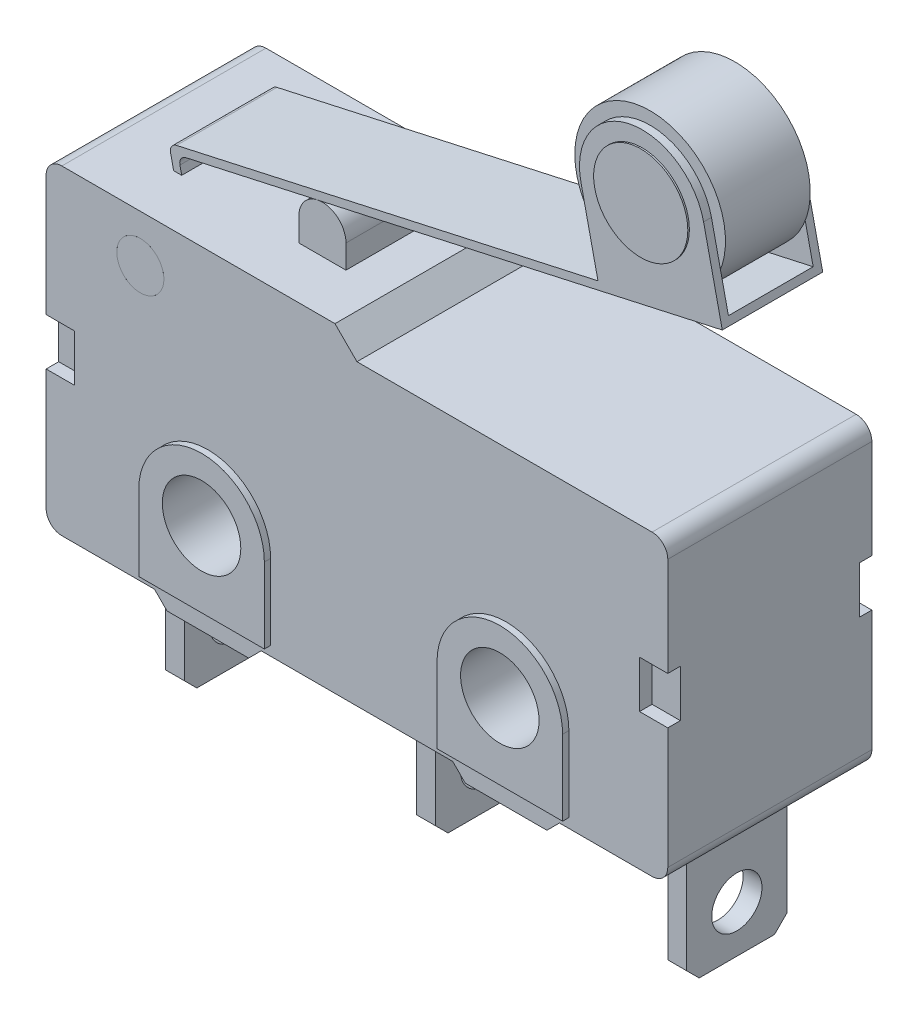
ISO-10303-21;
HEADER;
FILE_DESCRIPTION(('STEP AP214'),'2;1');
FILE_NAME('part.step','',(''),(''),'','','');
FILE_SCHEMA(('AUTOMOTIVE_DESIGN { 1 0 10303 214 1 1 1 1 }'));
ENDSEC;
DATA;
#1=APPLICATION_CONTEXT('core data for automotive mechanical design processes');
#2=APPLICATION_PROTOCOL_DEFINITION('international standard','automotive_design',2000,#1);
#3=PRODUCT_CONTEXT('',#1,'mechanical');
#4=PRODUCT('Part','Part','',(#3));
#5=PRODUCT_RELATED_PRODUCT_CATEGORY('part','',(#4));
#6=PRODUCT_DEFINITION_FORMATION('','',#4);
#7=PRODUCT_DEFINITION_CONTEXT('part definition',#1,'design');
#8=PRODUCT_DEFINITION('design','',#6,#7);
#9=PRODUCT_DEFINITION_SHAPE('','',#8);
#10=(LENGTH_UNIT() NAMED_UNIT(*) SI_UNIT(.MILLI.,.METRE.));
#11=(NAMED_UNIT(*) PLANE_ANGLE_UNIT() SI_UNIT($,.RADIAN.));
#12=(NAMED_UNIT(*) SI_UNIT($,.STERADIAN.) SOLID_ANGLE_UNIT());
#13=UNCERTAINTY_MEASURE_WITH_UNIT(LENGTH_MEASURE(1.E-05),#10,'distance_accuracy_value','');
#14=(GEOMETRIC_REPRESENTATION_CONTEXT(3) GLOBAL_UNCERTAINTY_ASSIGNED_CONTEXT((#13)) GLOBAL_UNIT_ASSIGNED_CONTEXT((#10,
#11,#12)) REPRESENTATION_CONTEXT('',''));
#15=CARTESIAN_POINT('',(0.,0.,0.));
#16=DIRECTION('',(0.,0.,1.));
#17=DIRECTION('',(1.,0.,0.));
#18=AXIS2_PLACEMENT_3D('',#15,#16,#17);
#19=CARTESIAN_POINT('',(17.3380892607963,16.7936233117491,1.35));
#20=DIRECTION('',(0.,0.,-1.));
#21=DIRECTION('',(-1.,0.,0.));
#22=AXIS2_PLACEMENT_3D('',#19,#20,#21);
#23=CYLINDRICAL_SURFACE('',#22,2.4);
#24=CARTESIAN_POINT('',(17.3380892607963,16.7936233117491,1.35));
#25=DIRECTION('',(0.,0.,1.));
#26=DIRECTION('',(1.,0.,0.));
#27=AXIS2_PLACEMENT_3D('',#24,#25,#26);
#28=CIRCLE('',#27,2.4);
#29=CARTESIAN_POINT('',(14.9380892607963,16.7936233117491,1.35));
#30=VERTEX_POINT('',#29);
#31=EDGE_CURVE('E11',#30,#30,#28,.T.);
#32=CARTESIAN_POINT('',(17.3380892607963,16.7936233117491,-1.35));
#33=DIRECTION('',(0.,0.,1.));
#34=DIRECTION('',(1.,0.,0.));
#35=AXIS2_PLACEMENT_3D('',#32,#33,#34);
#36=CIRCLE('',#35,2.4);
#37=CARTESIAN_POINT('',(14.9380892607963,16.7936233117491,-1.35));
#38=VERTEX_POINT('',#37);
#39=EDGE_CURVE('E47',#38,#38,#36,.T.);
#40=CARTESIAN_POINT('',(14.9380892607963,16.7936233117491,1.35));
#41=CARTESIAN_POINT('',(14.9380892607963,16.7936233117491,1.321875));
#42=CARTESIAN_POINT('',(14.9380892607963,16.7936233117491,1.29375));
#43=CARTESIAN_POINT('',(14.9380892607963,16.7936233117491,1.2375));
#44=CARTESIAN_POINT('',(14.9380892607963,16.7936233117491,1.209375));
#45=CARTESIAN_POINT('',(14.9380892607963,16.7936233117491,1.153125));
#46=CARTESIAN_POINT('',(14.9380892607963,16.7936233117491,1.125));
#47=CARTESIAN_POINT('',(14.9380892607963,16.7936233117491,1.06875));
#48=CARTESIAN_POINT('',(14.9380892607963,16.7936233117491,1.040625));
#49=CARTESIAN_POINT('',(14.9380892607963,16.7936233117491,0.984375));
#50=CARTESIAN_POINT('',(14.9380892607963,16.7936233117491,0.95625));
#51=CARTESIAN_POINT('',(14.9380892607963,16.7936233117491,0.9));
#52=CARTESIAN_POINT('',(14.9380892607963,16.7936233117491,0.871875));
#53=CARTESIAN_POINT('',(14.9380892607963,16.7936233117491,0.815625));
#54=CARTESIAN_POINT('',(14.9380892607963,16.7936233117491,0.7875));
#55=CARTESIAN_POINT('',(14.9380892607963,16.7936233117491,0.73125));
#56=CARTESIAN_POINT('',(14.9380892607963,16.7936233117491,0.703125));
#57=CARTESIAN_POINT('',(14.9380892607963,16.7936233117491,0.646875));
#58=CARTESIAN_POINT('',(14.9380892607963,16.7936233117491,0.61875));
#59=CARTESIAN_POINT('',(14.9380892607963,16.7936233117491,0.5625));
#60=CARTESIAN_POINT('',(14.9380892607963,16.7936233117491,0.534375));
#61=CARTESIAN_POINT('',(14.9380892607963,16.7936233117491,0.478125));
#62=CARTESIAN_POINT('',(14.9380892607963,16.7936233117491,0.45));
#63=CARTESIAN_POINT('',(14.9380892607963,16.7936233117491,0.39375));
#64=CARTESIAN_POINT('',(14.9380892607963,16.7936233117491,0.365625));
#65=CARTESIAN_POINT('',(14.9380892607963,16.7936233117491,0.309375));
#66=CARTESIAN_POINT('',(14.9380892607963,16.7936233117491,0.28125));
#67=CARTESIAN_POINT('',(14.9380892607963,16.7936233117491,0.225));
#68=CARTESIAN_POINT('',(14.9380892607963,16.7936233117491,0.196875));
#69=CARTESIAN_POINT('',(14.9380892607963,16.7936233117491,0.140625));
#70=CARTESIAN_POINT('',(14.9380892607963,16.7936233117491,0.1125));
#71=CARTESIAN_POINT('',(14.9380892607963,16.7936233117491,0.0562499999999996));
#72=CARTESIAN_POINT('',(14.9380892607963,16.7936233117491,0.0281249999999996));
#73=CARTESIAN_POINT('',(14.9380892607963,16.7936233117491,-0.0281250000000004));
#74=CARTESIAN_POINT('',(14.9380892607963,16.7936233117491,-0.0562500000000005));
#75=CARTESIAN_POINT('',(14.9380892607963,16.7936233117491,-0.1125));
#76=CARTESIAN_POINT('',(14.9380892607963,16.7936233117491,-0.140625));
#77=CARTESIAN_POINT('',(14.9380892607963,16.7936233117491,-0.196875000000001));
#78=CARTESIAN_POINT('',(14.9380892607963,16.7936233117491,-0.225000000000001));
#79=CARTESIAN_POINT('',(14.9380892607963,16.7936233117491,-0.28125));
#80=CARTESIAN_POINT('',(14.9380892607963,16.7936233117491,-0.309375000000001));
#81=CARTESIAN_POINT('',(14.9380892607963,16.7936233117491,-0.365625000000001));
#82=CARTESIAN_POINT('',(14.9380892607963,16.7936233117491,-0.393750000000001));
#83=CARTESIAN_POINT('',(14.9380892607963,16.7936233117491,-0.450000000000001));
#84=CARTESIAN_POINT('',(14.9380892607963,16.7936233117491,-0.478125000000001));
#85=CARTESIAN_POINT('',(14.9380892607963,16.7936233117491,-0.534375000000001));
#86=CARTESIAN_POINT('',(14.9380892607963,16.7936233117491,-0.562500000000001));
#87=CARTESIAN_POINT('',(14.9380892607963,16.7936233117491,-0.61875));
#88=CARTESIAN_POINT('',(14.9380892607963,16.7936233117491,-0.646875));
#89=CARTESIAN_POINT('',(14.9380892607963,16.7936233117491,-0.703125));
#90=CARTESIAN_POINT('',(14.9380892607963,16.7936233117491,-0.73125));
#91=CARTESIAN_POINT('',(14.9380892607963,16.7936233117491,-0.7875));
#92=CARTESIAN_POINT('',(14.9380892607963,16.7936233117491,-0.815625));
#93=CARTESIAN_POINT('',(14.9380892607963,16.7936233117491,-0.871875));
#94=CARTESIAN_POINT('',(14.9380892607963,16.7936233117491,-0.9));
#95=CARTESIAN_POINT('',(14.9380892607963,16.7936233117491,-0.95625));
#96=CARTESIAN_POINT('',(14.9380892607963,16.7936233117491,-0.984375));
#97=CARTESIAN_POINT('',(14.9380892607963,16.7936233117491,-1.040625));
#98=CARTESIAN_POINT('',(14.9380892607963,16.7936233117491,-1.06875));
#99=CARTESIAN_POINT('',(14.9380892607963,16.7936233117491,-1.125));
#100=CARTESIAN_POINT('',(14.9380892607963,16.7936233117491,-1.153125));
#101=CARTESIAN_POINT('',(14.9380892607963,16.7936233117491,-1.209375));
#102=CARTESIAN_POINT('',(14.9380892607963,16.7936233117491,-1.2375));
#103=CARTESIAN_POINT('',(14.9380892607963,16.7936233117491,-1.29375));
#104=CARTESIAN_POINT('',(14.9380892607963,16.7936233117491,-1.321875));
#105=CARTESIAN_POINT('',(14.9380892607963,16.7936233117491,-1.35));
#106=B_SPLINE_CURVE_WITH_KNOTS('',3,(#40,#41,#42,#43,#44,#45,#46,#47,#48,#49,#50,#51,#52,#53,
#54,#55,#56,#57,#58,#59,#60,#61,#62,#63,#64,#65,#66,#67,#68,#69,#70,#71,#72,#73,#74,#75,#76,#77,
#78,#79,#80,#81,#82,#83,#84,#85,#86,#87,#88,#89,#90,#91,#92,#93,#94,#95,#96,#97,#98,#99,#100,
#101,#102,#103,#104,#105),.UNSPECIFIED.,.F.,.F.,(4,2,2,2,2,2,2,2,2,2,2,2,2,2,2,2,2,2,2,2,2,2,2,
2,2,2,2,2,2,2,2,2,4),(0.,0.0843749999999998,0.16875,0.253125,0.3375,0.421875,0.50625,0.590625,
0.675,0.759375,0.84375,0.928125,1.0125,1.096875,1.18125,1.265625,1.35,1.434375,1.51875,1.603125,
1.6875,1.771875,1.85625,1.940625,2.025,2.109375,2.19375,2.278125,2.3625,2.446875,2.53125,
2.615625,2.7),.UNSPECIFIED.);
#107=EDGE_CURVE('BSEAM44',#30,#38,#106,.T.);
#108=ORIENTED_EDGE('',*,*,#31,.F.);
#109=ORIENTED_EDGE('',*,*,#39,.T.);
#110=ORIENTED_EDGE('',*,*,#107,.T.);
#111=ORIENTED_EDGE('',*,*,#107,.F.);
#112=EDGE_LOOP('',(#108,#110,#109,#111));
#113=FACE_BOUND('',#112,.T.);
#114=ADVANCED_FACE('F44',(#113),#23,.T.);
#115=CARTESIAN_POINT('',(17.3380892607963,16.7936233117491,1.35));
#116=DIRECTION('',(0.,0.,1.));
#117=DIRECTION('',(1.,0.,0.));
#118=AXIS2_PLACEMENT_3D('',#115,#116,#117);
#119=PLANE('',#118);
#120=CARTESIAN_POINT('',(17.3380892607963,16.7936233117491,1.35));
#121=DIRECTION('',(0.,0.,1.));
#122=DIRECTION('',(1.,0.,0.));
#123=AXIS2_PLACEMENT_3D('',#120,#121,#122);
#124=CIRCLE('',#123,1.5);
#125=CARTESIAN_POINT('',(18.8380892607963,16.7936233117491,1.35));
#126=VERTEX_POINT('',#125);
#127=EDGE_CURVE('E56',#126,#126,#124,.T.);
#128=ORIENTED_EDGE('',*,*,#127,.F.);
#129=EDGE_LOOP('',(#128));
#130=FACE_BOUND('',#129,.T.);
#131=ORIENTED_EDGE('',*,*,#31,.T.);
#132=EDGE_LOOP('',(#131));
#133=FACE_BOUND('',#132,.T.);
#134=ADVANCED_FACE('F80',(#130,#133),#119,.T.);
#135=CARTESIAN_POINT('',(17.3380892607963,16.7936233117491,-1.35));
#136=DIRECTION('',(0.,0.,1.));
#137=DIRECTION('',(1.,0.,0.));
#138=AXIS2_PLACEMENT_3D('',#135,#136,#137);
#139=PLANE('',#138);
#140=CARTESIAN_POINT('',(17.3380892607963,16.7936233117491,-1.35));
#141=DIRECTION('',(0.,0.,1.));
#142=DIRECTION('',(1.,0.,0.));
#143=AXIS2_PLACEMENT_3D('',#140,#141,#142);
#144=CIRCLE('',#143,1.5);
#145=CARTESIAN_POINT('',(18.8380892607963,16.7936233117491,-1.35));
#146=VERTEX_POINT('',#145);
#147=EDGE_CURVE('E62',#146,#146,#144,.T.);
#148=ORIENTED_EDGE('',*,*,#147,.T.);
#149=EDGE_LOOP('',(#148));
#150=FACE_BOUND('',#149,.T.);
#151=ORIENTED_EDGE('',*,*,#39,.F.);
#152=EDGE_LOOP('',(#151));
#153=FACE_BOUND('',#152,.T.);
#154=ADVANCED_FACE('F85',(#150,#153),#139,.F.);
#155=CARTESIAN_POINT('',(17.3380892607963,16.7936233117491,1.65));
#156=DIRECTION('',(0.,0.,-1.));
#157=DIRECTION('',(-1.,0.,0.));
#158=AXIS2_PLACEMENT_3D('',#155,#156,#157);
#159=CYLINDRICAL_SURFACE('',#158,1.5);
#160=CARTESIAN_POINT('',(17.3380892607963,16.7936233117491,1.65));
#161=DIRECTION('',(0.,0.,1.));
#162=DIRECTION('',(1.,0.,0.));
#163=AXIS2_PLACEMENT_3D('',#160,#161,#162);
#164=CIRCLE('',#163,1.5);
#165=CARTESIAN_POINT('',(18.8380892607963,16.7936233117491,1.65));
#166=VERTEX_POINT('',#165);
#167=EDGE_CURVE('E54',#166,#166,#164,.T.);
#168=ORIENTED_EDGE('',*,*,#167,.F.);
#169=EDGE_LOOP('',(#168));
#170=FACE_BOUND('',#169,.T.);
#171=ORIENTED_EDGE('',*,*,#127,.T.);
#172=EDGE_LOOP('',(#171));
#173=FACE_BOUND('',#172,.T.);
#174=ADVANCED_FACE('F92',(#170,#173),#159,.T.);
#175=CARTESIAN_POINT('',(17.3380892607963,16.7936233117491,1.65));
#176=DIRECTION('',(0.,0.,1.));
#177=DIRECTION('',(1.,0.,0.));
#178=AXIS2_PLACEMENT_3D('',#175,#176,#177);
#179=PLANE('',#178);
#180=ORIENTED_EDGE('',*,*,#167,.T.);
#181=EDGE_LOOP('',(#180));
#182=FACE_BOUND('',#181,.T.);
#183=ADVANCED_FACE('F77',(#182),#179,.T.);
#184=CARTESIAN_POINT('',(17.3380892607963,16.7936233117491,-1.65));
#185=DIRECTION('',(0.,0.,1.));
#186=DIRECTION('',(1.,0.,0.));
#187=AXIS2_PLACEMENT_3D('',#184,#185,#186);
#188=CYLINDRICAL_SURFACE('',#187,1.5);
#189=CARTESIAN_POINT('',(17.3380892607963,16.7936233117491,-1.65));
#190=DIRECTION('',(0.,0.,1.));
#191=DIRECTION('',(1.,0.,0.));
#192=AXIS2_PLACEMENT_3D('',#189,#190,#191);
#193=CIRCLE('',#192,1.5);
#194=CARTESIAN_POINT('',(18.8380892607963,16.7936233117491,-1.65));
#195=VERTEX_POINT('',#194);
#196=EDGE_CURVE('E59',#195,#195,#193,.T.);
#197=ORIENTED_EDGE('',*,*,#196,.T.);
#198=EDGE_LOOP('',(#197));
#199=FACE_BOUND('',#198,.T.);
#200=ORIENTED_EDGE('',*,*,#147,.F.);
#201=EDGE_LOOP('',(#200));
#202=FACE_BOUND('',#201,.T.);
#203=ADVANCED_FACE('F68',(#199,#202),#188,.T.);
#204=CARTESIAN_POINT('',(17.3380892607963,16.7936233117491,-1.65));
#205=DIRECTION('',(0.,0.,-1.));
#206=DIRECTION('',(1.,0.,0.));
#207=AXIS2_PLACEMENT_3D('',#204,#205,#206);
#208=PLANE('',#207);
#209=ORIENTED_EDGE('',*,*,#196,.F.);
#210=EDGE_LOOP('',(#209));
#211=FACE_BOUND('',#210,.T.);
#212=ADVANCED_FACE('F71',(#211),#208,.T.);
#213=CLOSED_SHELL('',(#114,#134,#154,#174,#183,#203,#212));
#214=MANIFOLD_SOLID_BREP('B2',#213);
#215=CARTESIAN_POINT('',(17.3380892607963,16.7936233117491,1.6));
#216=DIRECTION('',(0.,0.,-1.));
#217=DIRECTION('',(-1.,0.,0.));
#218=AXIS2_PLACEMENT_3D('',#215,#216,#217);
#219=CYLINDRICAL_SURFACE('',#218,2.);
#220=DIRECTION('',(0.,0.,-1.));
#221=VECTOR('',#220,1.);
#222=CARTESIAN_POINT('',(19.2906812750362,17.2265025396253,1.6));
#223=LINE('',#222,#221);
#224=CARTESIAN_POINT('',(19.2906812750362,17.2265025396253,1.6));
#225=VERTEX_POINT('',#224);
#226=CARTESIAN_POINT('',(19.2906812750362,17.2265025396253,1.35));
#227=VERTEX_POINT('',#226);
#228=EDGE_CURVE('E315',#225,#227,#223,.T.);
#229=ORIENTED_EDGE('',*,*,#228,.T.);
#230=CARTESIAN_POINT('',(17.3380892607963,16.7936233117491,1.35));
#231=DIRECTION('',(0.,0.,1.));
#232=DIRECTION('',(0.,-1.,0.));
#233=AXIS2_PLACEMENT_3D('',#230,#231,#232);
#234=CIRCLE('',#233,2.);
#235=CARTESIAN_POINT('',(15.3854972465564,16.3607440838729,1.35));
#236=VERTEX_POINT('',#235);
#237=EDGE_CURVE('E271',#227,#236,#234,.T.);
#238=ORIENTED_EDGE('',*,*,#237,.T.);
#239=DIRECTION('',(0.,0.,-1.));
#240=VECTOR('',#239,1.);
#241=CARTESIAN_POINT('',(15.3854972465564,16.3607440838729,1.6));
#242=LINE('',#241,#240);
#243=CARTESIAN_POINT('',(15.3854972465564,16.3607440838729,1.6));
#244=VERTEX_POINT('',#243);
#245=EDGE_CURVE('E311',#244,#236,#242,.T.);
#246=ORIENTED_EDGE('',*,*,#245,.F.);
#247=CARTESIAN_POINT('',(17.3380892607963,16.7936233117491,1.6));
#248=DIRECTION('',(0.,0.,1.));
#249=DIRECTION('',(1.,0.,0.));
#250=AXIS2_PLACEMENT_3D('',#247,#248,#249);
#251=CIRCLE('',#250,2.);
#252=EDGE_CURVE('E299',#225,#244,#251,.T.);
#253=ORIENTED_EDGE('',*,*,#252,.F.);
#254=EDGE_LOOP('',(#229,#238,#246,#253));
#255=FACE_BOUND('',#254,.T.);
#256=ADVANCED_FACE('F155',(#255),#219,.T.);
#257=CARTESIAN_POINT('',(15.3854972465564,16.3607440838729,1.6));
#258=DIRECTION('',(0.976296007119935,0.216439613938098,0.));
#259=DIRECTION('',(-0.216439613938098,0.976296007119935,0.));
#260=AXIS2_PLACEMENT_3D('',#257,#258,#259);
#261=PLANE('',#260);
#262=ORIENTED_EDGE('',*,*,#245,.T.);
#263=DIRECTION('',(0.216439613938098,-0.976296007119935,0.));
#264=VECTOR('',#263,1.);
#265=CARTESIAN_POINT('',(15.3854972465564,16.3607440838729,1.35));
#266=LINE('',#265,#264);
#267=CARTESIAN_POINT('',(15.9265962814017,13.9200040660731,1.35));
#268=VERTEX_POINT('',#267);
#269=EDGE_CURVE('E289',#236,#268,#266,.T.);
#270=ORIENTED_EDGE('',*,*,#269,.T.);
#271=DIRECTION('',(0.,0.,-1.));
#272=VECTOR('',#271,1.);
#273=CARTESIAN_POINT('',(15.9265962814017,13.9200040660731,1.6));
#274=LINE('',#273,#272);
#275=CARTESIAN_POINT('',(15.9265962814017,13.9200040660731,1.6));
#276=VERTEX_POINT('',#275);
#277=EDGE_CURVE('E262',#276,#268,#274,.T.);
#278=ORIENTED_EDGE('',*,*,#277,.F.);
#279=DIRECTION('',(0.216439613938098,-0.976296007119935,0.));
#280=VECTOR('',#279,1.);
#281=CARTESIAN_POINT('',(15.3854972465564,16.3607440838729,1.6));
#282=LINE('',#281,#280);
#283=EDGE_CURVE('E301',#244,#276,#282,.T.);
#284=ORIENTED_EDGE('',*,*,#283,.F.);
#285=EDGE_LOOP('',(#262,#270,#278,#284));
#286=FACE_BOUND('',#285,.T.);
#287=ADVANCED_FACE('F398',(#286),#261,.F.);
#288=CARTESIAN_POINT('',(17.3380892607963,16.7936233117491,1.6));
#289=DIRECTION('',(0.,0.,-1.));
#290=DIRECTION('',(-1.,0.,0.));
#291=AXIS2_PLACEMENT_3D('',#288,#289,#290);
#292=CYLINDRICAL_SURFACE('',#291,1.5);
#293=CARTESIAN_POINT('',(17.3380892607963,16.7936233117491,1.35));
#294=DIRECTION('',(0.,0.,1.));
#295=DIRECTION('',(0.,-1.,0.));
#296=AXIS2_PLACEMENT_3D('',#293,#294,#295);
#297=CIRCLE('',#296,1.5);
#298=CARTESIAN_POINT('',(17.3380892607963,15.2936233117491,1.35));
#299=VERTEX_POINT('',#298);
#300=EDGE_CURVE('E159',#299,#299,#297,.T.);
#301=ORIENTED_EDGE('',*,*,#300,.F.);
#302=EDGE_LOOP('',(#301));
#303=FACE_BOUND('',#302,.T.);
#304=CARTESIAN_POINT('',(17.3380892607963,16.7936233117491,1.6));
#305=DIRECTION('',(0.,0.,1.));
#306=DIRECTION('',(1.,0.,0.));
#307=AXIS2_PLACEMENT_3D('',#304,#305,#306);
#308=CIRCLE('',#307,1.5);
#309=CARTESIAN_POINT('',(18.8380892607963,16.7936233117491,1.6));
#310=VERTEX_POINT('',#309);
#311=EDGE_CURVE('E293',#310,#310,#308,.T.);
#312=ORIENTED_EDGE('',*,*,#311,.T.);
#313=EDGE_LOOP('',(#312));
#314=FACE_BOUND('',#313,.T.);
#315=ADVANCED_FACE('F378',(#303,#314),#292,.F.);
#316=CARTESIAN_POINT('',(2.50252618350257,10.9439593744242,1.6));
#317=DIRECTION('',(0.216439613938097,-0.976296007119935,0.));
#318=DIRECTION('',(0.976296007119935,0.216439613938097,0.));
#319=AXIS2_PLACEMENT_3D('',#316,#317,#318);
#320=PLANE('',#319);
#321=DIRECTION('',(0.976296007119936,0.216439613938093,0.));
#322=VECTOR('',#321,1.);
#323=CARTESIAN_POINT('',(6.94467301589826,11.9287596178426,-1.35));
#324=LINE('',#323,#322);
#325=CARTESIAN_POINT('',(15.9265962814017,13.9200040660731,-1.35));
#326=VERTEX_POINT('',#325);
#327=CARTESIAN_POINT('',(19.8317803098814,14.7857625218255,-1.35));
#328=VERTEX_POINT('',#327);
#329=EDGE_CURVE('E172',#326,#328,#324,.T.);
#330=ORIENTED_EDGE('',*,*,#329,.F.);
#331=CARTESIAN_POINT('',(15.9265962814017,13.9200040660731,-1.6));
#332=VERTEX_POINT('',#331);
#333=EDGE_CURVE('E304',#326,#332,#274,.T.);
#334=ORIENTED_EDGE('',*,*,#333,.T.);
#335=DIRECTION('',(-0.976296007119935,-0.216439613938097,0.));
#336=VECTOR('',#335,1.);
#337=CARTESIAN_POINT('',(2.50252618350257,10.9439593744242,-1.6));
#338=LINE('',#337,#336);
#339=CARTESIAN_POINT('',(2.50252618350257,10.9439593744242,-1.6));
#340=VERTEX_POINT('',#339);
#341=EDGE_CURVE('E322',#332,#340,#338,.T.);
#342=ORIENTED_EDGE('',*,*,#341,.T.);
#343=DIRECTION('',(0.,0.,-1.));
#344=VECTOR('',#343,1.);
#345=CARTESIAN_POINT('',(2.50252618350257,10.9439593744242,1.6));
#346=LINE('',#345,#344);
#347=CARTESIAN_POINT('',(2.50252618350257,10.9439593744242,1.6));
#348=VERTEX_POINT('',#347);
#349=EDGE_CURVE('E335',#348,#340,#346,.T.);
#350=ORIENTED_EDGE('',*,*,#349,.F.);
#351=DIRECTION('',(-0.976296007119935,-0.216439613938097,0.));
#352=VECTOR('',#351,1.);
#353=CARTESIAN_POINT('',(2.50252618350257,10.9439593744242,1.6));
#354=LINE('',#353,#352);
#355=EDGE_CURVE('E179',#276,#348,#354,.T.);
#356=ORIENTED_EDGE('',*,*,#355,.F.);
#357=ORIENTED_EDGE('',*,*,#277,.T.);
#358=DIRECTION('',(0.976296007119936,0.216439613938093,0.));
#359=VECTOR('',#358,1.);
#360=CARTESIAN_POINT('',(6.94467301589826,11.9287596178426,1.35));
#361=LINE('',#360,#359);
#362=CARTESIAN_POINT('',(19.8317803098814,14.7857625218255,1.35));
#363=VERTEX_POINT('',#362);
#364=EDGE_CURVE('E255',#268,#363,#361,.T.);
#365=ORIENTED_EDGE('',*,*,#364,.T.);
#366=DIRECTION('',(0.,0.,-1.));
#367=VECTOR('',#366,1.);
#368=CARTESIAN_POINT('',(19.8317803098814,14.7857625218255,1.35));
#369=LINE('',#368,#367);
#370=EDGE_CURVE('E259',#363,#328,#369,.T.);
#371=ORIENTED_EDGE('',*,*,#370,.T.);
#372=EDGE_LOOP('',(#330,#334,#342,#350,#356,#357,#365,#371));
#373=FACE_BOUND('',#372,.T.);
#374=ADVANCED_FACE('F257',(#373),#320,.F.);
#375=CARTESIAN_POINT('',(2.55663608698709,10.6998853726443,1.6));
#376=DIRECTION('',(0.,0.,-1.));
#377=DIRECTION('',(-1.,0.,0.));
#378=AXIS2_PLACEMENT_3D('',#375,#376,#377);
#379=CYLINDRICAL_SURFACE('',#378,0.249999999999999);
#380=CARTESIAN_POINT('',(2.55663608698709,10.6998853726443,-1.6));
#381=DIRECTION('',(0.,0.,1.));
#382=DIRECTION('',(-1.,0.,0.));
#383=AXIS2_PLACEMENT_3D('',#380,#381,#382);
#384=CIRCLE('',#383,0.249999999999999);
#385=CARTESIAN_POINT('',(2.31256208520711,10.6457754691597,-1.6));
#386=VERTEX_POINT('',#385);
#387=EDGE_CURVE('E317',#340,#386,#384,.T.);
#388=ORIENTED_EDGE('',*,*,#387,.T.);
#389=DIRECTION('',(0.,0.,-1.));
#390=VECTOR('',#389,1.);
#391=CARTESIAN_POINT('',(2.31256208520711,10.6457754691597,1.6));
#392=LINE('',#391,#390);
#393=CARTESIAN_POINT('',(2.31256208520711,10.6457754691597,1.6));
#394=VERTEX_POINT('',#393);
#395=EDGE_CURVE('E42',#394,#386,#392,.T.);
#396=ORIENTED_EDGE('',*,*,#395,.F.);
#397=CARTESIAN_POINT('',(2.55663608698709,10.6998853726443,1.6));
#398=DIRECTION('',(0.,0.,1.));
#399=DIRECTION('',(-1.,0.,0.));
#400=AXIS2_PLACEMENT_3D('',#397,#398,#399);
#401=CIRCLE('',#400,0.249999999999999);
#402=EDGE_CURVE('E318',#348,#394,#401,.T.);
#403=ORIENTED_EDGE('',*,*,#402,.F.);
#404=ORIENTED_EDGE('',*,*,#349,.T.);
#405=EDGE_LOOP('',(#388,#396,#403,#404));
#406=FACE_BOUND('',#405,.T.);
#407=ADVANCED_FACE('F157',(#406),#379,.T.);
#408=CARTESIAN_POINT('',(2.41138812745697,10.2,1.6));
#409=DIRECTION('',(0.976296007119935,0.216439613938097,0.));
#410=DIRECTION('',(-0.216439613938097,0.976296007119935,0.));
#411=AXIS2_PLACEMENT_3D('',#408,#409,#410);
#412=PLANE('',#411);
#413=DIRECTION('',(0.216439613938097,-0.976296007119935,0.));
#414=VECTOR('',#413,1.);
#415=CARTESIAN_POINT('',(2.41138812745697,10.2,-1.6));
#416=LINE('',#415,#414);
#417=CARTESIAN_POINT('',(2.41138812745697,10.2,-1.6));
#418=VERTEX_POINT('',#417);
#419=EDGE_CURVE('E338',#386,#418,#416,.T.);
#420=ORIENTED_EDGE('',*,*,#419,.T.);
#421=DIRECTION('',(0.,0.,-1.));
#422=VECTOR('',#421,1.);
#423=CARTESIAN_POINT('',(2.41138812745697,10.2,1.6));
#424=LINE('',#423,#422);
#425=CARTESIAN_POINT('',(2.41138812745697,10.2,1.6));
#426=VERTEX_POINT('',#425);
#427=EDGE_CURVE('E164',#426,#418,#424,.T.);
#428=ORIENTED_EDGE('',*,*,#427,.F.);
#429=DIRECTION('',(0.216439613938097,-0.976296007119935,0.));
#430=VECTOR('',#429,1.);
#431=CARTESIAN_POINT('',(2.41138812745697,10.2,1.6));
#432=LINE('',#431,#430);
#433=EDGE_CURVE('E321',#394,#426,#432,.T.);
#434=ORIENTED_EDGE('',*,*,#433,.F.);
#435=ORIENTED_EDGE('',*,*,#395,.T.);
#436=EDGE_LOOP('',(#420,#428,#434,#435));
#437=FACE_BOUND('',#436,.T.);
#438=ADVANCED_FACE('F518',(#437),#412,.F.);
#439=CARTESIAN_POINT('',(2.6674580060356,10.2,1.6));
#440=DIRECTION('',(0.,1.,0.));
#441=DIRECTION('',(0.,0.,1.));
#442=AXIS2_PLACEMENT_3D('',#439,#440,#441);
#443=PLANE('',#442);
#444=DIRECTION('',(1.,0.,0.));
#445=VECTOR('',#444,1.);
#446=CARTESIAN_POINT('',(2.6674580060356,10.2,-1.6));
#447=LINE('',#446,#445);
#448=CARTESIAN_POINT('',(2.6674580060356,10.2,-1.6));
#449=VERTEX_POINT('',#448);
#450=EDGE_CURVE('E340',#418,#449,#447,.T.);
#451=ORIENTED_EDGE('',*,*,#450,.T.);
#452=DIRECTION('',(0.,0.,-1.));
#453=VECTOR('',#452,1.);
#454=CARTESIAN_POINT('',(2.6674580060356,10.2,1.6));
#455=LINE('',#454,#453);
#456=CARTESIAN_POINT('',(2.6674580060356,10.2,1.6));
#457=VERTEX_POINT('',#456);
#458=EDGE_CURVE('E363',#457,#449,#455,.T.);
#459=ORIENTED_EDGE('',*,*,#458,.F.);
#460=DIRECTION('',(1.,0.,0.));
#461=VECTOR('',#460,1.);
#462=CARTESIAN_POINT('',(2.6674580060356,10.2,1.6));
#463=LINE('',#462,#461);
#464=EDGE_CURVE('E324',#426,#457,#463,.T.);
#465=ORIENTED_EDGE('',*,*,#464,.F.);
#466=ORIENTED_EDGE('',*,*,#427,.T.);
#467=EDGE_LOOP('',(#451,#459,#465,#466));
#468=FACE_BOUND('',#467,.T.);
#469=ADVANCED_FACE('F508',(#468),#443,.F.);
#470=CARTESIAN_POINT('',(2.6674580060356,10.2,1.6));
#471=DIRECTION('',(-0.976296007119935,-0.216439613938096,0.));
#472=DIRECTION('',(0.216439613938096,-0.976296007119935,0.));
#473=AXIS2_PLACEMENT_3D('',#470,#471,#472);
#474=PLANE('',#473);
#475=DIRECTION('',(-0.216439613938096,0.976296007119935,0.));
#476=VECTOR('',#475,1.);
#477=CARTESIAN_POINT('',(2.6674580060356,10.2,-1.6));
#478=LINE('',#477,#476);
#479=CARTESIAN_POINT('',(2.61074599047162,10.4558113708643,-1.6));
#480=VERTEX_POINT('',#479);
#481=EDGE_CURVE('E342',#449,#480,#478,.T.);
#482=ORIENTED_EDGE('',*,*,#481,.T.);
#483=DIRECTION('',(0.,0.,-1.));
#484=VECTOR('',#483,1.);
#485=CARTESIAN_POINT('',(2.61074599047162,10.4558113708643,1.6));
#486=LINE('',#485,#484);
#487=CARTESIAN_POINT('',(2.61074599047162,10.4558113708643,1.6));
#488=VERTEX_POINT('',#487);
#489=EDGE_CURVE('E360',#488,#480,#486,.T.);
#490=ORIENTED_EDGE('',*,*,#489,.F.);
#491=DIRECTION('',(-0.216439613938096,0.976296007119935,0.));
#492=VECTOR('',#491,1.);
#493=CARTESIAN_POINT('',(2.6674580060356,10.2,1.6));
#494=LINE('',#493,#492);
#495=EDGE_CURVE('E326',#457,#488,#494,.T.);
#496=ORIENTED_EDGE('',*,*,#495,.F.);
#497=ORIENTED_EDGE('',*,*,#458,.T.);
#498=EDGE_LOOP('',(#482,#490,#496,#497));
#499=FACE_BOUND('',#498,.T.);
#500=ADVANCED_FACE('F498',(#499),#474,.F.);
#501=CARTESIAN_POINT('',(2.8548199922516,10.5099212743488,1.6));
#502=DIRECTION('',(0.,0.,-1.));
#503=DIRECTION('',(-1.,0.,0.));
#504=AXIS2_PLACEMENT_3D('',#501,#502,#503);
#505=CYLINDRICAL_SURFACE('',#504,0.25);
#506=CARTESIAN_POINT('',(2.8548199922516,10.5099212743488,-1.6));
#507=DIRECTION('',(0.,0.,-1.));
#508=DIRECTION('',(-1.,0.,0.));
#509=AXIS2_PLACEMENT_3D('',#506,#507,#508);
#510=CIRCLE('',#509,0.25);
#511=CARTESIAN_POINT('',(2.80071008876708,10.7539952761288,-1.6));
#512=VERTEX_POINT('',#511);
#513=EDGE_CURVE('E344',#480,#512,#510,.T.);
#514=ORIENTED_EDGE('',*,*,#513,.T.);
#515=DIRECTION('',(0.,0.,-1.));
#516=VECTOR('',#515,1.);
#517=CARTESIAN_POINT('',(2.80071008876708,10.7539952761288,1.6));
#518=LINE('',#517,#516);
#519=CARTESIAN_POINT('',(2.80071008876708,10.7539952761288,1.6));
#520=VERTEX_POINT('',#519);
#521=EDGE_CURVE('E357',#520,#512,#518,.T.);
#522=ORIENTED_EDGE('',*,*,#521,.F.);
#523=CARTESIAN_POINT('',(2.8548199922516,10.5099212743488,1.6));
#524=DIRECTION('',(0.,0.,-1.));
#525=DIRECTION('',(-1.,0.,0.));
#526=AXIS2_PLACEMENT_3D('',#523,#524,#525);
#527=CIRCLE('',#526,0.25);
#528=EDGE_CURVE('E328',#488,#520,#527,.T.);
#529=ORIENTED_EDGE('',*,*,#528,.F.);
#530=ORIENTED_EDGE('',*,*,#489,.T.);
#531=EDGE_LOOP('',(#514,#522,#529,#530));
#532=FACE_BOUND('',#531,.T.);
#533=ADVANCED_FACE('F488',(#532),#505,.F.);
#534=CARTESIAN_POINT('',(2.80071008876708,10.7539952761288,1.6));
#535=DIRECTION('',(-0.216439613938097,0.976296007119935,0.));
#536=DIRECTION('',(-0.976296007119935,-0.216439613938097,0.));
#537=AXIS2_PLACEMENT_3D('',#534,#535,#536);
#538=PLANE('',#537);
#539=DIRECTION('',(0.976296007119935,0.216439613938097,0.));
#540=VECTOR('',#539,1.);
#541=CARTESIAN_POINT('',(2.80071008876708,10.7539952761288,-1.6));
#542=LINE('',#541,#540);
#543=CARTESIAN_POINT('',(19.8858902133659,14.5416885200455,-1.6));
#544=VERTEX_POINT('',#543);
#545=EDGE_CURVE('E346',#512,#544,#542,.T.);
#546=ORIENTED_EDGE('',*,*,#545,.T.);
#547=DIRECTION('',(0.,0.,-1.));
#548=VECTOR('',#547,1.);
#549=CARTESIAN_POINT('',(19.8858902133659,14.5416885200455,1.6));
#550=LINE('',#549,#548);
#551=CARTESIAN_POINT('',(19.8858902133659,14.5416885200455,1.6));
#552=VERTEX_POINT('',#551);
#553=EDGE_CURVE('E354',#552,#544,#550,.T.);
#554=ORIENTED_EDGE('',*,*,#553,.F.);
#555=DIRECTION('',(0.976296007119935,0.216439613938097,0.));
#556=VECTOR('',#555,1.);
#557=CARTESIAN_POINT('',(2.80071008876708,10.7539952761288,1.6));
#558=LINE('',#557,#556);
#559=EDGE_CURVE('E330',#520,#552,#558,.T.);
#560=ORIENTED_EDGE('',*,*,#559,.F.);
#561=ORIENTED_EDGE('',*,*,#521,.T.);
#562=EDGE_LOOP('',(#546,#554,#560,#561));
#563=FACE_BOUND('',#562,.T.);
#564=ADVANCED_FACE('F440',(#563),#538,.F.);
#565=CARTESIAN_POINT('',(19.8858902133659,14.5416885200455,1.6));
#566=DIRECTION('',(-0.976296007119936,-0.216439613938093,0.));
#567=DIRECTION('',(0.216439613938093,-0.976296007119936,0.));
#568=AXIS2_PLACEMENT_3D('',#565,#566,#567);
#569=PLANE('',#568);
#570=ORIENTED_EDGE('',*,*,#370,.F.);
#571=DIRECTION('',(0.216439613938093,-0.976296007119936,0.));
#572=VECTOR('',#571,1.);
#573=CARTESIAN_POINT('',(18.707950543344,19.8550310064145,1.35));
#574=LINE('',#573,#572);
#575=EDGE_CURVE('E268',#227,#363,#574,.T.);
#576=ORIENTED_EDGE('',*,*,#575,.F.);
#577=ORIENTED_EDGE('',*,*,#228,.F.);
#578=DIRECTION('',(-0.216439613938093,0.976296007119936,0.));
#579=VECTOR('',#578,1.);
#580=CARTESIAN_POINT('',(19.8858902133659,14.5416885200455,1.6));
#581=LINE('',#580,#579);
#582=EDGE_CURVE('E332',#552,#225,#581,.T.);
#583=ORIENTED_EDGE('',*,*,#582,.F.);
#584=ORIENTED_EDGE('',*,*,#553,.T.);
#585=DIRECTION('',(-0.216439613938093,0.976296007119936,0.));
#586=VECTOR('',#585,1.);
#587=CARTESIAN_POINT('',(19.8858902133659,14.5416885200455,-1.6));
#588=LINE('',#587,#586);
#589=CARTESIAN_POINT('',(19.2906812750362,17.2265025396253,-1.6));
#590=VERTEX_POINT('',#589);
#591=EDGE_CURVE('E348',#544,#590,#588,.T.);
#592=ORIENTED_EDGE('',*,*,#591,.T.);
#593=CARTESIAN_POINT('',(19.2906812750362,17.2265025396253,-1.35));
#594=VERTEX_POINT('',#593);
#595=EDGE_CURVE('E314',#594,#590,#223,.T.);
#596=ORIENTED_EDGE('',*,*,#595,.F.);
#597=DIRECTION('',(-0.216439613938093,0.976296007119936,0.));
#598=VECTOR('',#597,1.);
#599=CARTESIAN_POINT('',(18.707950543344,19.8550310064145,-1.35));
#600=LINE('',#599,#598);
#601=EDGE_CURVE('E265',#328,#594,#600,.T.);
#602=ORIENTED_EDGE('',*,*,#601,.F.);
#603=EDGE_LOOP('',(#570,#576,#577,#583,#584,#592,#596,#602));
#604=FACE_BOUND('',#603,.T.);
#605=ADVANCED_FACE('F276',(#604),#569,.F.);
#606=CARTESIAN_POINT('',(2.55663608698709,10.6998853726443,1.6));
#607=DIRECTION('',(0.,0.,-1.));
#608=DIRECTION('',(-1.,0.,0.));
#609=AXIS2_PLACEMENT_3D('',#606,#607,#608);
#610=PLANE('',#609);
#611=ORIENTED_EDGE('',*,*,#402,.T.);
#612=ORIENTED_EDGE('',*,*,#433,.T.);
#613=ORIENTED_EDGE('',*,*,#464,.T.);
#614=ORIENTED_EDGE('',*,*,#495,.T.);
#615=ORIENTED_EDGE('',*,*,#528,.T.);
#616=ORIENTED_EDGE('',*,*,#559,.T.);
#617=ORIENTED_EDGE('',*,*,#582,.T.);
#618=ORIENTED_EDGE('',*,*,#252,.T.);
#619=ORIENTED_EDGE('',*,*,#283,.T.);
#620=ORIENTED_EDGE('',*,*,#355,.T.);
#621=EDGE_LOOP('',(#611,#612,#613,#614,#615,#616,#617,#618,#619,#620));
#622=FACE_BOUND('',#621,.T.);
#623=ORIENTED_EDGE('',*,*,#311,.F.);
#624=EDGE_LOOP('',(#623));
#625=FACE_BOUND('',#624,.T.);
#626=ADVANCED_FACE('F384',(#622,#625),#610,.F.);
#627=CARTESIAN_POINT('',(2.55663608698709,10.6998853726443,-1.6));
#628=DIRECTION('',(0.,0.,-1.));
#629=DIRECTION('',(-1.,0.,0.));
#630=AXIS2_PLACEMENT_3D('',#627,#628,#629);
#631=PLANE('',#630);
#632=ORIENTED_EDGE('',*,*,#387,.F.);
#633=ORIENTED_EDGE('',*,*,#341,.F.);
#634=DIRECTION('',(0.216439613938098,-0.976296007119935,0.));
#635=VECTOR('',#634,1.);
#636=CARTESIAN_POINT('',(15.3854972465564,16.3607440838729,-1.6));
#637=LINE('',#636,#635);
#638=CARTESIAN_POINT('',(15.3854972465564,16.3607440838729,-1.6));
#639=VERTEX_POINT('',#638);
#640=EDGE_CURVE('E302',#639,#332,#637,.T.);
#641=ORIENTED_EDGE('',*,*,#640,.F.);
#642=CARTESIAN_POINT('',(17.3380892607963,16.7936233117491,-1.6));
#643=DIRECTION('',(0.,0.,1.));
#644=DIRECTION('',(1.,0.,0.));
#645=AXIS2_PLACEMENT_3D('',#642,#643,#644);
#646=CIRCLE('',#645,2.);
#647=EDGE_CURVE('E296',#590,#639,#646,.T.);
#648=ORIENTED_EDGE('',*,*,#647,.F.);
#649=ORIENTED_EDGE('',*,*,#591,.F.);
#650=ORIENTED_EDGE('',*,*,#545,.F.);
#651=ORIENTED_EDGE('',*,*,#513,.F.);
#652=ORIENTED_EDGE('',*,*,#481,.F.);
#653=ORIENTED_EDGE('',*,*,#450,.F.);
#654=ORIENTED_EDGE('',*,*,#419,.F.);
#655=EDGE_LOOP('',(#632,#633,#641,#648,#649,#650,#651,#652,#653,#654));
#656=FACE_BOUND('',#655,.T.);
#657=CARTESIAN_POINT('',(17.3380892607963,16.7936233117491,-1.6));
#658=DIRECTION('',(0.,0.,1.));
#659=DIRECTION('',(1.,0.,0.));
#660=AXIS2_PLACEMENT_3D('',#657,#658,#659);
#661=CIRCLE('',#660,1.5);
#662=CARTESIAN_POINT('',(18.8380892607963,16.7936233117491,-1.6));
#663=VERTEX_POINT('',#662);
#664=EDGE_CURVE('E292',#663,#663,#661,.T.);
#665=ORIENTED_EDGE('',*,*,#664,.T.);
#666=EDGE_LOOP('',(#665));
#667=FACE_BOUND('',#666,.T.);
#668=ADVANCED_FACE('F381',(#656,#667),#631,.T.);
#669=CARTESIAN_POINT('',(15.3854972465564,16.3607440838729,-1.35));
#670=VERTEX_POINT('',#669);
#671=EDGE_CURVE('E310',#670,#639,#242,.T.);
#672=ORIENTED_EDGE('',*,*,#671,.F.);
#673=CARTESIAN_POINT('',(17.3380892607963,16.7936233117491,-1.35));
#674=DIRECTION('',(0.,0.,-1.));
#675=DIRECTION('',(0.,1.,0.));
#676=AXIS2_PLACEMENT_3D('',#673,#674,#675);
#677=CIRCLE('',#676,2.);
#678=EDGE_CURVE('E286',#670,#594,#677,.T.);
#679=ORIENTED_EDGE('',*,*,#678,.T.);
#680=ORIENTED_EDGE('',*,*,#595,.T.);
#681=ORIENTED_EDGE('',*,*,#647,.T.);
#682=EDGE_LOOP('',(#672,#679,#680,#681));
#683=FACE_BOUND('',#682,.T.);
#684=ADVANCED_FACE('F383',(#683),#219,.T.);
#685=ORIENTED_EDGE('',*,*,#333,.F.);
#686=DIRECTION('',(-0.216439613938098,0.976296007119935,0.));
#687=VECTOR('',#686,1.);
#688=CARTESIAN_POINT('',(15.3854972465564,16.3607440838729,-1.35));
#689=LINE('',#688,#687);
#690=EDGE_CURVE('E283',#326,#670,#689,.T.);
#691=ORIENTED_EDGE('',*,*,#690,.T.);
#692=ORIENTED_EDGE('',*,*,#671,.T.);
#693=ORIENTED_EDGE('',*,*,#640,.T.);
#694=EDGE_LOOP('',(#685,#691,#692,#693));
#695=FACE_BOUND('',#694,.T.);
#696=ADVANCED_FACE('F376',(#695),#261,.F.);
#697=CARTESIAN_POINT('',(17.3380892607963,16.7936233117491,-1.35));
#698=DIRECTION('',(0.,0.,-1.));
#699=DIRECTION('',(0.,1.,0.));
#700=AXIS2_PLACEMENT_3D('',#697,#698,#699);
#701=CIRCLE('',#700,1.5);
#702=CARTESIAN_POINT('',(17.3380892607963,18.2936233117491,-1.35));
#703=VERTEX_POINT('',#702);
#704=EDGE_CURVE('E281',#703,#703,#701,.T.);
#705=ORIENTED_EDGE('',*,*,#704,.F.);
#706=EDGE_LOOP('',(#705));
#707=FACE_BOUND('',#706,.T.);
#708=ORIENTED_EDGE('',*,*,#664,.F.);
#709=EDGE_LOOP('',(#708));
#710=FACE_BOUND('',#709,.T.);
#711=ADVANCED_FACE('F373',(#707,#710),#292,.F.);
#712=CARTESIAN_POINT('',(5.82084324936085,16.9980281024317,1.35));
#713=DIRECTION('',(0.,0.,1.));
#714=DIRECTION('',(0.,-1.,0.));
#715=AXIS2_PLACEMENT_3D('',#712,#713,#714);
#716=PLANE('',#715);
#717=ORIENTED_EDGE('',*,*,#300,.T.);
#718=EDGE_LOOP('',(#717));
#719=FACE_BOUND('',#718,.T.);
#720=ORIENTED_EDGE('',*,*,#575,.T.);
#721=ORIENTED_EDGE('',*,*,#364,.F.);
#722=ORIENTED_EDGE('',*,*,#269,.F.);
#723=ORIENTED_EDGE('',*,*,#237,.F.);
#724=EDGE_LOOP('',(#720,#721,#722,#723));
#725=FACE_BOUND('',#724,.T.);
#726=ADVANCED_FACE('F269',(#719,#725),#716,.F.);
#727=CARTESIAN_POINT('',(5.82084324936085,16.9980281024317,-1.35));
#728=DIRECTION('',(0.,0.,-1.));
#729=DIRECTION('',(0.,1.,0.));
#730=AXIS2_PLACEMENT_3D('',#727,#728,#729);
#731=PLANE('',#730);
#732=ORIENTED_EDGE('',*,*,#704,.T.);
#733=EDGE_LOOP('',(#732));
#734=FACE_BOUND('',#733,.T.);
#735=ORIENTED_EDGE('',*,*,#690,.F.);
#736=ORIENTED_EDGE('',*,*,#329,.T.);
#737=ORIENTED_EDGE('',*,*,#601,.T.);
#738=ORIENTED_EDGE('',*,*,#678,.F.);
#739=EDGE_LOOP('',(#735,#736,#737,#738));
#740=FACE_BOUND('',#739,.T.);
#741=ADVANCED_FACE('F370',(#734,#740),#731,.F.);
#742=CLOSED_SHELL('',(#256,#287,#315,#374,#407,#438,#469,#500,#533,#564,#605,#626,#668,#684,
#696,#711,#726,#741));
#743=MANIFOLD_SOLID_BREP('B6',#742);
#744=CARTESIAN_POINT('',(6.4,10.95,-1.6));
#745=DIRECTION('',(1.,0.,0.));
#746=DIRECTION('',(0.,0.,-1.));
#747=AXIS2_PLACEMENT_3D('',#744,#745,#746);
#748=PLANE('',#747);
#749=DIRECTION('',(0.,0.,1.));
#750=VECTOR('',#749,1.);
#751=CARTESIAN_POINT('',(6.4,10.2,-1.6));
#752=LINE('',#751,#750);
#753=CARTESIAN_POINT('',(6.4,10.2,-1.6));
#754=VERTEX_POINT('',#753);
#755=CARTESIAN_POINT('',(6.4,10.2,1.6));
#756=VERTEX_POINT('',#755);
#757=EDGE_CURVE('E654',#754,#756,#752,.T.);
#758=ORIENTED_EDGE('',*,*,#757,.T.);
#759=DIRECTION('',(0.,-1.,0.));
#760=VECTOR('',#759,1.);
#761=CARTESIAN_POINT('',(6.4,10.95,1.6));
#762=LINE('',#761,#760);
#763=CARTESIAN_POINT('',(6.4,10.95,1.6));
#764=VERTEX_POINT('',#763);
#765=EDGE_CURVE('E153',#764,#756,#762,.T.);
#766=ORIENTED_EDGE('',*,*,#765,.F.);
#767=DIRECTION('',(0.,0.,1.));
#768=VECTOR('',#767,1.);
#769=CARTESIAN_POINT('',(6.4,10.95,-1.6));
#770=LINE('',#769,#768);
#771=CARTESIAN_POINT('',(6.4,10.95,-1.6));
#772=VERTEX_POINT('',#771);
#773=EDGE_CURVE('E640',#772,#764,#770,.T.);
#774=ORIENTED_EDGE('',*,*,#773,.F.);
#775=DIRECTION('',(0.,-1.,0.));
#776=VECTOR('',#775,1.);
#777=CARTESIAN_POINT('',(6.4,10.95,-1.6));
#778=LINE('',#777,#776);
#779=EDGE_CURVE('E641',#772,#754,#778,.T.);
#780=ORIENTED_EDGE('',*,*,#779,.T.);
#781=EDGE_LOOP('',(#758,#766,#774,#780));
#782=FACE_BOUND('',#781,.T.);
#783=ADVANCED_FACE('F595',(#782),#748,.F.);
#784=CARTESIAN_POINT('',(6.4,10.95,1.6));
#785=DIRECTION('',(0.,0.,-1.));
#786=DIRECTION('',(-1.,0.,0.));
#787=AXIS2_PLACEMENT_3D('',#784,#785,#786);
#788=PLANE('',#787);
#789=DIRECTION('',(1.,0.,0.));
#790=VECTOR('',#789,1.);
#791=CARTESIAN_POINT('',(6.4,10.2,1.6));
#792=LINE('',#791,#790);
#793=CARTESIAN_POINT('',(7.9,10.2,1.6));
#794=VERTEX_POINT('',#793);
#795=EDGE_CURVE('E657',#756,#794,#792,.T.);
#796=ORIENTED_EDGE('',*,*,#795,.T.);
#797=DIRECTION('',(0.,-1.,0.));
#798=VECTOR('',#797,1.);
#799=CARTESIAN_POINT('',(7.9,10.95,1.6));
#800=LINE('',#799,#798);
#801=CARTESIAN_POINT('',(7.9,10.95,1.6));
#802=VERTEX_POINT('',#801);
#803=EDGE_CURVE('E603',#802,#794,#800,.T.);
#804=ORIENTED_EDGE('',*,*,#803,.F.);
#805=CARTESIAN_POINT('',(7.15,10.95,1.6));
#806=DIRECTION('',(0.,0.,1.));
#807=DIRECTION('',(1.,0.,0.));
#808=AXIS2_PLACEMENT_3D('',#805,#806,#807);
#809=CIRCLE('',#808,0.75);
#810=EDGE_CURVE('E655',#802,#764,#809,.T.);
#811=ORIENTED_EDGE('',*,*,#810,.T.);
#812=ORIENTED_EDGE('',*,*,#765,.T.);
#813=EDGE_LOOP('',(#796,#804,#811,#812));
#814=FACE_BOUND('',#813,.T.);
#815=ADVANCED_FACE('F669',(#814),#788,.F.);
#816=CARTESIAN_POINT('',(7.9,10.95,-1.6));
#817=DIRECTION('',(-1.,0.,0.));
#818=DIRECTION('',(0.,0.,1.));
#819=AXIS2_PLACEMENT_3D('',#816,#817,#818);
#820=PLANE('',#819);
#821=DIRECTION('',(0.,0.,-1.));
#822=VECTOR('',#821,1.);
#823=CARTESIAN_POINT('',(7.9,10.2,-1.6));
#824=LINE('',#823,#822);
#825=CARTESIAN_POINT('',(7.9,10.2,-1.6));
#826=VERTEX_POINT('',#825);
#827=EDGE_CURVE('E627',#794,#826,#824,.T.);
#828=ORIENTED_EDGE('',*,*,#827,.T.);
#829=DIRECTION('',(0.,-1.,0.));
#830=VECTOR('',#829,1.);
#831=CARTESIAN_POINT('',(7.9,10.95,-1.6));
#832=LINE('',#831,#830);
#833=CARTESIAN_POINT('',(7.9,10.95,-1.6));
#834=VERTEX_POINT('',#833);
#835=EDGE_CURVE('E611',#834,#826,#832,.T.);
#836=ORIENTED_EDGE('',*,*,#835,.F.);
#837=DIRECTION('',(0.,0.,-1.));
#838=VECTOR('',#837,1.);
#839=CARTESIAN_POINT('',(7.9,10.95,-1.6));
#840=LINE('',#839,#838);
#841=EDGE_CURVE('E647',#802,#834,#840,.T.);
#842=ORIENTED_EDGE('',*,*,#841,.F.);
#843=ORIENTED_EDGE('',*,*,#803,.T.);
#844=EDGE_LOOP('',(#828,#836,#842,#843));
#845=FACE_BOUND('',#844,.T.);
#846=ADVANCED_FACE('F665',(#845),#820,.F.);
#847=CARTESIAN_POINT('',(6.4,10.95,-1.6));
#848=DIRECTION('',(0.,0.,1.));
#849=DIRECTION('',(1.,0.,0.));
#850=AXIS2_PLACEMENT_3D('',#847,#848,#849);
#851=PLANE('',#850);
#852=DIRECTION('',(-1.,0.,0.));
#853=VECTOR('',#852,1.);
#854=CARTESIAN_POINT('',(6.4,10.2,-1.6));
#855=LINE('',#854,#853);
#856=EDGE_CURVE('E632',#826,#754,#855,.T.);
#857=ORIENTED_EDGE('',*,*,#856,.T.);
#858=ORIENTED_EDGE('',*,*,#779,.F.);
#859=CARTESIAN_POINT('',(7.15,10.95,-1.6));
#860=DIRECTION('',(0.,0.,1.));
#861=DIRECTION('',(1.,0.,0.));
#862=AXIS2_PLACEMENT_3D('',#859,#860,#861);
#863=CIRCLE('',#862,0.75);
#864=EDGE_CURVE('E650',#772,#834,#863,.F.);
#865=ORIENTED_EDGE('',*,*,#864,.T.);
#866=ORIENTED_EDGE('',*,*,#835,.T.);
#867=EDGE_LOOP('',(#857,#858,#865,#866));
#868=FACE_BOUND('',#867,.T.);
#869=ADVANCED_FACE('F649',(#868),#851,.F.);
#870=CARTESIAN_POINT('',(0.,10.2,0.));
#871=DIRECTION('',(0.,1.,0.));
#872=DIRECTION('',(0.,0.,1.));
#873=AXIS2_PLACEMENT_3D('',#870,#871,#872);
#874=PLANE('',#873);
#875=ORIENTED_EDGE('',*,*,#757,.F.);
#876=ORIENTED_EDGE('',*,*,#856,.F.);
#877=ORIENTED_EDGE('',*,*,#827,.F.);
#878=ORIENTED_EDGE('',*,*,#795,.F.);
#879=EDGE_LOOP('',(#875,#876,#877,#878));
#880=FACE_BOUND('',#879,.T.);
#881=ADVANCED_FACE('F668',(#880),#874,.F.);
#882=CARTESIAN_POINT('',(7.15,10.95,-3.27705098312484));
#883=DIRECTION('',(0.,0.,1.));
#884=DIRECTION('',(1.,0.,0.));
#885=AXIS2_PLACEMENT_3D('',#882,#883,#884);
#886=CYLINDRICAL_SURFACE('',#885,0.75);
#887=ORIENTED_EDGE('',*,*,#864,.F.);
#888=ORIENTED_EDGE('',*,*,#773,.T.);
#889=ORIENTED_EDGE('',*,*,#810,.F.);
#890=ORIENTED_EDGE('',*,*,#841,.T.);
#891=EDGE_LOOP('',(#887,#888,#889,#890));
#892=FACE_BOUND('',#891,.T.);
#893=ADVANCED_FACE('F653',(#892),#886,.T.);
#894=CLOSED_SHELL('',(#783,#815,#846,#869,#881,#893));
#895=MANIFOLD_SOLID_BREP('B36',#894);
#896=CARTESIAN_POINT('',(3.,8.7,3.25));
#897=DIRECTION('',(0.,0.,-1.));
#898=DIRECTION('',(-1.,0.,0.));
#899=AXIS2_PLACEMENT_3D('',#896,#897,#898);
#900=CYLINDRICAL_SURFACE('',#899,0.750000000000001);
#901=CARTESIAN_POINT('',(3.,8.7,3.25));
#902=DIRECTION('',(0.,0.,1.));
#903=DIRECTION('',(1.,0.,0.));
#904=AXIS2_PLACEMENT_3D('',#901,#902,#903);
#905=CIRCLE('',#904,0.750000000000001);
#906=CARTESIAN_POINT('',(2.25,8.7,3.25));
#907=VERTEX_POINT('',#906);
#908=EDGE_CURVE('E594',#907,#907,#905,.T.);
#909=CARTESIAN_POINT('',(3.,8.7,-3.25));
#910=DIRECTION('',(0.,0.,1.));
#911=DIRECTION('',(1.,0.,0.));
#912=AXIS2_PLACEMENT_3D('',#909,#910,#911);
#913=CIRCLE('',#912,0.750000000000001);
#914=CARTESIAN_POINT('',(2.25,8.7,-3.25));
#915=VERTEX_POINT('',#914);
#916=EDGE_CURVE('E737',#915,#915,#913,.T.);
#917=CARTESIAN_POINT('',(2.25,8.7,3.25));
#918=CARTESIAN_POINT('',(2.25,8.7,3.18229166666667));
#919=CARTESIAN_POINT('',(2.25,8.7,3.11458333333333));
#920=CARTESIAN_POINT('',(2.25,8.7,2.97916666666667));
#921=CARTESIAN_POINT('',(2.25,8.7,2.91145833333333));
#922=CARTESIAN_POINT('',(2.25,8.7,2.77604166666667));
#923=CARTESIAN_POINT('',(2.25,8.7,2.70833333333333));
#924=CARTESIAN_POINT('',(2.25,8.7,2.57291666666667));
#925=CARTESIAN_POINT('',(2.25,8.7,2.50520833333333));
#926=CARTESIAN_POINT('',(2.25,8.7,2.36979166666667));
#927=CARTESIAN_POINT('',(2.25,8.7,2.30208333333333));
#928=CARTESIAN_POINT('',(2.25,8.7,2.16666666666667));
#929=CARTESIAN_POINT('',(2.25,8.7,2.09895833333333));
#930=CARTESIAN_POINT('',(2.25,8.7,1.96354166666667));
#931=CARTESIAN_POINT('',(2.25,8.7,1.89583333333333));
#932=CARTESIAN_POINT('',(2.25,8.7,1.76041666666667));
#933=CARTESIAN_POINT('',(2.25,8.7,1.69270833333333));
#934=CARTESIAN_POINT('',(2.25,8.7,1.55729166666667));
#935=CARTESIAN_POINT('',(2.25,8.7,1.48958333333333));
#936=CARTESIAN_POINT('',(2.25,8.7,1.35416666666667));
#937=CARTESIAN_POINT('',(2.25,8.7,1.28645833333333));
#938=CARTESIAN_POINT('',(2.25,8.7,1.15104166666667));
#939=CARTESIAN_POINT('',(2.25,8.7,1.08333333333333));
#940=CARTESIAN_POINT('',(2.25,8.7,0.947916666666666));
#941=CARTESIAN_POINT('',(2.25,8.7,0.880208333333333));
#942=CARTESIAN_POINT('',(2.25,8.7,0.744791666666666));
#943=CARTESIAN_POINT('',(2.25,8.7,0.677083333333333));
#944=CARTESIAN_POINT('',(2.25,8.7,0.541666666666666));
#945=CARTESIAN_POINT('',(2.25,8.7,0.473958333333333));
#946=CARTESIAN_POINT('',(2.25,8.7,0.338541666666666));
#947=CARTESIAN_POINT('',(2.25,8.7,0.270833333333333));
#948=CARTESIAN_POINT('',(2.25,8.7,0.135416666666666));
#949=CARTESIAN_POINT('',(2.25,8.7,0.0677083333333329));
#950=CARTESIAN_POINT('',(2.25,8.7,-0.0677083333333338));
#951=CARTESIAN_POINT('',(2.25,8.7,-0.135416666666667));
#952=CARTESIAN_POINT('',(2.25,8.7,-0.270833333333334));
#953=CARTESIAN_POINT('',(2.25,8.7,-0.338541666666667));
#954=CARTESIAN_POINT('',(2.25,8.7,-0.473958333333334));
#955=CARTESIAN_POINT('',(2.25,8.7,-0.541666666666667));
#956=CARTESIAN_POINT('',(2.25,8.7,-0.677083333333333));
#957=CARTESIAN_POINT('',(2.25,8.7,-0.744791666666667));
#958=CARTESIAN_POINT('',(2.25,8.7,-0.880208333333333));
#959=CARTESIAN_POINT('',(2.25,8.7,-0.947916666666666));
#960=CARTESIAN_POINT('',(2.25,8.7,-1.08333333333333));
#961=CARTESIAN_POINT('',(2.25,8.7,-1.15104166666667));
#962=CARTESIAN_POINT('',(2.25,8.7,-1.28645833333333));
#963=CARTESIAN_POINT('',(2.25,8.7,-1.35416666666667));
#964=CARTESIAN_POINT('',(2.25,8.7,-1.48958333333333));
#965=CARTESIAN_POINT('',(2.25,8.7,-1.55729166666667));
#966=CARTESIAN_POINT('',(2.25,8.7,-1.69270833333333));
#967=CARTESIAN_POINT('',(2.25,8.7,-1.76041666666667));
#968=CARTESIAN_POINT('',(2.25,8.7,-1.89583333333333));
#969=CARTESIAN_POINT('',(2.25,8.7,-1.96354166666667));
#970=CARTESIAN_POINT('',(2.25,8.7,-2.09895833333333));
#971=CARTESIAN_POINT('',(2.25,8.7,-2.16666666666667));
#972=CARTESIAN_POINT('',(2.25,8.7,-2.30208333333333));
#973=CARTESIAN_POINT('',(2.25,8.7,-2.36979166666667));
#974=CARTESIAN_POINT('',(2.25,8.7,-2.50520833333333));
#975=CARTESIAN_POINT('',(2.25,8.7,-2.57291666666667));
#976=CARTESIAN_POINT('',(2.25,8.7,-2.70833333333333));
#977=CARTESIAN_POINT('',(2.25,8.7,-2.77604166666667));
#978=CARTESIAN_POINT('',(2.25,8.7,-2.91145833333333));
#979=CARTESIAN_POINT('',(2.25,8.7,-2.97916666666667));
#980=CARTESIAN_POINT('',(2.25,8.7,-3.11458333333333));
#981=CARTESIAN_POINT('',(2.25,8.7,-3.18229166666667));
#982=CARTESIAN_POINT('',(2.25,8.7,-3.25));
#983=B_SPLINE_CURVE_WITH_KNOTS('',3,(#917,#918,#919,#920,#921,#922,#923,#924,#925,#926,#927,
#928,#929,#930,#931,#932,#933,#934,#935,#936,#937,#938,#939,#940,#941,#942,#943,#944,#945,#946,
#947,#948,#949,#950,#951,#952,#953,#954,#955,#956,#957,#958,#959,#960,#961,#962,#963,#964,#965,
#966,#967,#968,#969,#970,#971,#972,#973,#974,#975,#976,#977,#978,#979,#980,#981,#982),
.UNSPECIFIED.,.F.,.F.,(4,2,2,2,2,2,2,2,2,2,2,2,2,2,2,2,2,2,2,2,2,2,2,2,2,2,2,2,2,2,2,2,4),(0.,
0.203125,0.40625,0.609375,0.8125,1.015625,1.21875,1.421875,1.625,1.828125,2.03125,2.234375,
2.4375,2.640625,2.84375,3.046875,3.25,3.453125,3.65625,3.859375,4.0625,4.265625,4.46875,
4.671875,4.875,5.078125,5.28125,5.484375,5.6875,5.890625,6.09375,6.296875,6.5),.UNSPECIFIED.);
#984=EDGE_CURVE('BSEAM734',#907,#915,#983,.T.);
#985=ORIENTED_EDGE('',*,*,#908,.F.);
#986=ORIENTED_EDGE('',*,*,#916,.T.);
#987=ORIENTED_EDGE('',*,*,#984,.T.);
#988=ORIENTED_EDGE('',*,*,#984,.F.);
#989=EDGE_LOOP('',(#985,#987,#986,#988));
#990=FACE_BOUND('',#989,.T.);
#991=ADVANCED_FACE('F734',(#990),#900,.T.);
#992=CARTESIAN_POINT('',(3.,8.7,3.25));
#993=DIRECTION('',(0.,0.,1.));
#994=DIRECTION('',(1.,0.,0.));
#995=AXIS2_PLACEMENT_3D('',#992,#993,#994);
#996=PLANE('',#995);
#997=ORIENTED_EDGE('',*,*,#908,.T.);
#998=EDGE_LOOP('',(#997));
#999=FACE_BOUND('',#998,.T.);
#1000=ADVANCED_FACE('F749',(#999),#996,.T.);
#1001=CARTESIAN_POINT('',(3.,8.7,-3.25));
#1002=DIRECTION('',(0.,0.,1.));
#1003=DIRECTION('',(1.,0.,0.));
#1004=AXIS2_PLACEMENT_3D('',#1001,#1002,#1003);
#1005=PLANE('',#1004);
#1006=ORIENTED_EDGE('',*,*,#916,.F.);
#1007=EDGE_LOOP('',(#1006));
#1008=FACE_BOUND('',#1007,.T.);
#1009=ADVANCED_FACE('F747',(#1008),#1005,.F.);
#1010=CLOSED_SHELL('',(#991,#1000,#1009));
#1011=MANIFOLD_SOLID_BREP('B147',#1010);
#1012=CARTESIAN_POINT('',(19.3,0.5,-3.25));
#1013=DIRECTION('',(0.,0.,-1.));
#1014=DIRECTION('',(-1.,0.,0.));
#1015=AXIS2_PLACEMENT_3D('',#1012,#1013,#1014);
#1016=PLANE('',#1015);
#1017=CARTESIAN_POINT('',(3.,8.7,-3.25));
#1018=DIRECTION('',(0.,0.,-1.));
#1019=DIRECTION('',(-1.,0.,0.));
#1020=AXIS2_PLACEMENT_3D('',#1017,#1018,#1019);
#1021=CIRCLE('',#1020,0.750000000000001);
#1022=CARTESIAN_POINT('',(2.25,8.7,-3.25));
#1023=VERTEX_POINT('',#1022);
#1024=EDGE_CURVE('E1857',#1023,#1023,#1021,.T.);
#1025=ORIENTED_EDGE('',*,*,#1024,.F.);
#1026=EDGE_LOOP('',(#1025));
#1027=FACE_BOUND('',#1026,.T.);
#1028=CARTESIAN_POINT('',(14.65,2.7,-3.25));
#1029=DIRECTION('',(0.,0.,1.));
#1030=DIRECTION('',(1.,0.,0.));
#1031=AXIS2_PLACEMENT_3D('',#1028,#1029,#1030);
#1032=CIRCLE('',#1031,2.);
#1033=CARTESIAN_POINT('',(16.65,2.7,-3.25));
#1034=VERTEX_POINT('',#1033);
#1035=CARTESIAN_POINT('',(12.65,2.7,-3.25));
#1036=VERTEX_POINT('',#1035);
#1037=EDGE_CURVE('E1365',#1034,#1036,#1032,.T.);
#1038=ORIENTED_EDGE('',*,*,#1037,.T.);
#1039=DIRECTION('',(0.,-1.,0.));
#1040=VECTOR('',#1039,1.);
#1041=CARTESIAN_POINT('',(12.65,2.7,-3.25));
#1042=LINE('',#1041,#1040);
#1043=CARTESIAN_POINT('',(12.65,0.3,-3.25));
#1044=VERTEX_POINT('',#1043);
#1045=EDGE_CURVE('E1370',#1036,#1044,#1042,.T.);
#1046=ORIENTED_EDGE('',*,*,#1045,.T.);
#1047=DIRECTION('',(1.,0.,0.));
#1048=VECTOR('',#1047,1.);
#1049=CARTESIAN_POINT('',(12.65,0.3,-3.25));
#1050=LINE('',#1049,#1048);
#1051=CARTESIAN_POINT('',(16.65,0.3,-3.25));
#1052=VERTEX_POINT('',#1051);
#1053=EDGE_CURVE('E1383',#1044,#1052,#1050,.T.);
#1054=ORIENTED_EDGE('',*,*,#1053,.T.);
#1055=DIRECTION('',(0.,1.,0.));
#1056=VECTOR('',#1055,1.);
#1057=CARTESIAN_POINT('',(16.65,2.7,-3.25));
#1058=LINE('',#1057,#1056);
#1059=EDGE_CURVE('E1381',#1052,#1034,#1058,.T.);
#1060=ORIENTED_EDGE('',*,*,#1059,.T.);
#1061=EDGE_LOOP('',(#1038,#1046,#1054,#1060));
#1062=FACE_BOUND('',#1061,.T.);
#1063=CARTESIAN_POINT('',(5.15,2.7,-3.25));
#1064=DIRECTION('',(0.,0.,1.));
#1065=DIRECTION('',(1.,0.,0.));
#1066=AXIS2_PLACEMENT_3D('',#1063,#1064,#1065);
#1067=CIRCLE('',#1066,2.);
#1068=CARTESIAN_POINT('',(7.15,2.7,-3.25));
#1069=VERTEX_POINT('',#1068);
#1070=CARTESIAN_POINT('',(3.15,2.7,-3.25));
#1071=VERTEX_POINT('',#1070);
#1072=EDGE_CURVE('E1400',#1069,#1071,#1067,.T.);
#1073=ORIENTED_EDGE('',*,*,#1072,.T.);
#1074=DIRECTION('',(0.,-1.,0.));
#1075=VECTOR('',#1074,1.);
#1076=CARTESIAN_POINT('',(3.15,2.7,-3.25));
#1077=LINE('',#1076,#1075);
#1078=CARTESIAN_POINT('',(3.15,0.3,-3.25));
#1079=VERTEX_POINT('',#1078);
#1080=EDGE_CURVE('E1405',#1071,#1079,#1077,.T.);
#1081=ORIENTED_EDGE('',*,*,#1080,.T.);
#1082=DIRECTION('',(1.,0.,0.));
#1083=VECTOR('',#1082,1.);
#1084=CARTESIAN_POINT('',(3.15,0.3,-3.25));
#1085=LINE('',#1084,#1083);
#1086=CARTESIAN_POINT('',(7.15,0.3,-3.25));
#1087=VERTEX_POINT('',#1086);
#1088=EDGE_CURVE('E1418',#1079,#1087,#1085,.T.);
#1089=ORIENTED_EDGE('',*,*,#1088,.T.);
#1090=DIRECTION('',(0.,1.,0.));
#1091=VECTOR('',#1090,1.);
#1092=CARTESIAN_POINT('',(7.15,2.7,-3.25));
#1093=LINE('',#1092,#1091);
#1094=EDGE_CURVE('E1416',#1087,#1069,#1093,.T.);
#1095=ORIENTED_EDGE('',*,*,#1094,.T.);
#1096=EDGE_LOOP('',(#1073,#1081,#1089,#1095));
#1097=FACE_BOUND('',#1096,.T.);
#1098=DIRECTION('',(0.,1.,0.));
#1099=VECTOR('',#1098,1.);
#1100=CARTESIAN_POINT('',(19.8,0.500000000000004,-3.25));
#1101=LINE('',#1100,#1099);
#1102=CARTESIAN_POINT('',(19.8,5.85,-3.25));
#1103=VERTEX_POINT('',#1102);
#1104=CARTESIAN_POINT('',(19.8,9.,-3.25));
#1105=VERTEX_POINT('',#1104);
#1106=EDGE_CURVE('E1681',#1103,#1105,#1101,.T.);
#1107=ORIENTED_EDGE('',*,*,#1106,.F.);
#1108=DIRECTION('',(-1.,0.,0.));
#1109=VECTOR('',#1108,1.);
#1110=CARTESIAN_POINT('',(19.8,5.85,-3.25));
#1111=LINE('',#1110,#1109);
#1112=CARTESIAN_POINT('',(18.9,5.85,-3.25));
#1113=VERTEX_POINT('',#1112);
#1114=EDGE_CURVE('E1852',#1103,#1113,#1111,.T.);
#1115=ORIENTED_EDGE('',*,*,#1114,.T.);
#1116=DIRECTION('',(0.,-1.,0.));
#1117=VECTOR('',#1116,1.);
#1118=CARTESIAN_POINT('',(18.9,5.85,-3.25));
#1119=LINE('',#1118,#1117);
#1120=CARTESIAN_POINT('',(18.9,4.35,-3.25));
#1121=VERTEX_POINT('',#1120);
#1122=EDGE_CURVE('E1853',#1113,#1121,#1119,.T.);
#1123=ORIENTED_EDGE('',*,*,#1122,.T.);
#1124=DIRECTION('',(1.,0.,0.));
#1125=VECTOR('',#1124,1.);
#1126=CARTESIAN_POINT('',(19.8,4.35,-3.25));
#1127=LINE('',#1126,#1125);
#1128=CARTESIAN_POINT('',(19.8,4.35,-3.25));
#1129=VERTEX_POINT('',#1128);
#1130=EDGE_CURVE('E1856',#1121,#1129,#1127,.T.);
#1131=ORIENTED_EDGE('',*,*,#1130,.T.);
#1132=CARTESIAN_POINT('',(19.8,0.500000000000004,-3.25));
#1133=VERTEX_POINT('',#1132);
#1134=EDGE_CURVE('E1219',#1133,#1129,#1101,.T.);
#1135=ORIENTED_EDGE('',*,*,#1134,.F.);
#1136=CARTESIAN_POINT('',(19.3,0.5,-3.25));
#1137=DIRECTION('',(0.,0.,1.));
#1138=DIRECTION('',(-1.,0.,0.));
#1139=AXIS2_PLACEMENT_3D('',#1136,#1137,#1138);
#1140=CIRCLE('',#1139,0.5);
#1141=CARTESIAN_POINT('',(19.3,0.,-3.25));
#1142=VERTEX_POINT('',#1141);
#1143=EDGE_CURVE('E1648',#1142,#1133,#1140,.T.);
#1144=ORIENTED_EDGE('',*,*,#1143,.F.);
#1145=DIRECTION('',(1.,0.,0.));
#1146=VECTOR('',#1145,1.);
#1147=CARTESIAN_POINT('',(0.500000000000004,0.,-3.25));
#1148=LINE('',#1147,#1146);
#1149=CARTESIAN_POINT('',(16.35,0.,-3.25));
#1150=VERTEX_POINT('',#1149);
#1151=EDGE_CURVE('E1699',#1150,#1142,#1148,.T.);
#1152=ORIENTED_EDGE('',*,*,#1151,.F.);
#1153=DIRECTION('',(0.707106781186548,0.707106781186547,0.));
#1154=VECTOR('',#1153,1.);
#1155=CARTESIAN_POINT('',(15.95,-0.4,-3.25));
#1156=LINE('',#1155,#1154);
#1157=CARTESIAN_POINT('',(15.95,-0.4,-3.25));
#1158=VERTEX_POINT('',#1157);
#1159=EDGE_CURVE('E1321',#1158,#1150,#1156,.T.);
#1160=ORIENTED_EDGE('',*,*,#1159,.F.);
#1161=DIRECTION('',(1.,0.,0.));
#1162=VECTOR('',#1161,1.);
#1163=CARTESIAN_POINT('',(13.35,-0.4,-3.25));
#1164=LINE('',#1163,#1162);
#1165=CARTESIAN_POINT('',(13.35,-0.4,-3.25));
#1166=VERTEX_POINT('',#1165);
#1167=EDGE_CURVE('E1326',#1166,#1158,#1164,.T.);
#1168=ORIENTED_EDGE('',*,*,#1167,.F.);
#1169=DIRECTION('',(0.707106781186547,-0.707106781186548,0.));
#1170=VECTOR('',#1169,1.);
#1171=CARTESIAN_POINT('',(12.95,0.,-3.25));
#1172=LINE('',#1171,#1170);
#1173=CARTESIAN_POINT('',(12.95,0.,-3.25));
#1174=VERTEX_POINT('',#1173);
#1175=EDGE_CURVE('E1312',#1174,#1166,#1172,.T.);
#1176=ORIENTED_EDGE('',*,*,#1175,.F.);
#1177=CARTESIAN_POINT('',(6.84999999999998,0.,-3.25));
#1178=VERTEX_POINT('',#1177);
#1179=EDGE_CURVE('E1701',#1178,#1174,#1148,.T.);
#1180=ORIENTED_EDGE('',*,*,#1179,.F.);
#1181=DIRECTION('',(0.707106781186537,0.707106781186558,0.));
#1182=VECTOR('',#1181,1.);
#1183=CARTESIAN_POINT('',(6.44999999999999,-0.4,-3.25));
#1184=LINE('',#1183,#1182);
#1185=CARTESIAN_POINT('',(6.44999999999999,-0.4,-3.25));
#1186=VERTEX_POINT('',#1185);
#1187=EDGE_CURVE('E1348',#1186,#1178,#1184,.T.);
#1188=ORIENTED_EDGE('',*,*,#1187,.F.);
#1189=DIRECTION('',(1.,0.,0.));
#1190=VECTOR('',#1189,1.);
#1191=CARTESIAN_POINT('',(3.85000000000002,-0.4,-3.25));
#1192=LINE('',#1191,#1190);
#1193=CARTESIAN_POINT('',(3.85000000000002,-0.4,-3.25));
#1194=VERTEX_POINT('',#1193);
#1195=EDGE_CURVE('E1353',#1194,#1186,#1192,.T.);
#1196=ORIENTED_EDGE('',*,*,#1195,.F.);
#1197=DIRECTION('',(0.707106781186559,-0.707106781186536,0.));
#1198=VECTOR('',#1197,1.);
#1199=CARTESIAN_POINT('',(3.45,0.,-3.25));
#1200=LINE('',#1199,#1198);
#1201=CARTESIAN_POINT('',(3.45000000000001,0.,-3.25));
#1202=VERTEX_POINT('',#1201);
#1203=EDGE_CURVE('E1339',#1202,#1194,#1200,.T.);
#1204=ORIENTED_EDGE('',*,*,#1203,.F.);
#1205=CARTESIAN_POINT('',(0.500000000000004,0.,-3.25));
#1206=VERTEX_POINT('',#1205);
#1207=EDGE_CURVE('E1653',#1206,#1202,#1148,.T.);
#1208=ORIENTED_EDGE('',*,*,#1207,.F.);
#1209=CARTESIAN_POINT('',(0.5,0.5,-3.25));
#1210=DIRECTION('',(0.,0.,1.));
#1211=DIRECTION('',(-1.,0.,0.));
#1212=AXIS2_PLACEMENT_3D('',#1209,#1210,#1211);
#1213=CIRCLE('',#1212,0.5);
#1214=CARTESIAN_POINT('',(0.,0.500000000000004,-3.25));
#1215=VERTEX_POINT('',#1214);
#1216=EDGE_CURVE('E1697',#1215,#1206,#1213,.T.);
#1217=ORIENTED_EDGE('',*,*,#1216,.F.);
#1218=DIRECTION('',(0.,-1.,0.));
#1219=VECTOR('',#1218,1.);
#1220=CARTESIAN_POINT('',(0.,0.500000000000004,-3.25));
#1221=LINE('',#1220,#1219);
#1222=CARTESIAN_POINT('',(0.,4.35,-3.25));
#1223=VERTEX_POINT('',#1222);
#1224=EDGE_CURVE('E1693',#1223,#1215,#1221,.T.);
#1225=ORIENTED_EDGE('',*,*,#1224,.F.);
#1226=DIRECTION('',(1.,0.,0.));
#1227=VECTOR('',#1226,1.);
#1228=CARTESIAN_POINT('',(0.,4.35,-3.25));
#1229=LINE('',#1228,#1227);
#1230=CARTESIAN_POINT('',(0.900000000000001,4.35,-3.25));
#1231=VERTEX_POINT('',#1230);
#1232=EDGE_CURVE('E1231',#1223,#1231,#1229,.T.);
#1233=ORIENTED_EDGE('',*,*,#1232,.T.);
#1234=DIRECTION('',(0.,1.,0.));
#1235=VECTOR('',#1234,1.);
#1236=CARTESIAN_POINT('',(0.9,5.85,-3.25));
#1237=LINE('',#1236,#1235);
#1238=CARTESIAN_POINT('',(0.9,5.85,-3.25));
#1239=VERTEX_POINT('',#1238);
#1240=EDGE_CURVE('E1239',#1231,#1239,#1237,.T.);
#1241=ORIENTED_EDGE('',*,*,#1240,.T.);
#1242=DIRECTION('',(-1.,0.,0.));
#1243=VECTOR('',#1242,1.);
#1244=CARTESIAN_POINT('',(0.,5.85,-3.25));
#1245=LINE('',#1244,#1243);
#1246=CARTESIAN_POINT('',(0.,5.85,-3.25));
#1247=VERTEX_POINT('',#1246);
#1248=EDGE_CURVE('E1237',#1239,#1247,#1245,.T.);
#1249=ORIENTED_EDGE('',*,*,#1248,.T.);
#1250=CARTESIAN_POINT('',(0.,9.7,-3.25));
#1251=VERTEX_POINT('',#1250);
#1252=EDGE_CURVE('E1694',#1251,#1247,#1221,.T.);
#1253=ORIENTED_EDGE('',*,*,#1252,.F.);
#1254=CARTESIAN_POINT('',(0.5,9.7,-3.25));
#1255=DIRECTION('',(0.,0.,1.));
#1256=DIRECTION('',(-1.,0.,0.));
#1257=AXIS2_PLACEMENT_3D('',#1254,#1255,#1256);
#1258=CIRCLE('',#1257,0.5);
#1259=CARTESIAN_POINT('',(0.500000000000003,10.2,-3.25));
#1260=VERTEX_POINT('',#1259);
#1261=EDGE_CURVE('E1691',#1260,#1251,#1258,.T.);
#1262=ORIENTED_EDGE('',*,*,#1261,.F.);
#1263=DIRECTION('',(-1.,0.,0.));
#1264=VECTOR('',#1263,1.);
#1265=CARTESIAN_POINT('',(0.500000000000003,10.2,-3.25));
#1266=LINE('',#1265,#1264);
#1267=CARTESIAN_POINT('',(9.2,10.2,-3.25));
#1268=VERTEX_POINT('',#1267);
#1269=EDGE_CURVE('E1689',#1268,#1260,#1266,.T.);
#1270=ORIENTED_EDGE('',*,*,#1269,.F.);
#1271=DIRECTION('',(-0.707106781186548,0.707106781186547,0.));
#1272=VECTOR('',#1271,1.);
#1273=CARTESIAN_POINT('',(9.2,10.2,-3.25));
#1274=LINE('',#1273,#1272);
#1275=CARTESIAN_POINT('',(9.9,9.5,-3.25));
#1276=VERTEX_POINT('',#1275);
#1277=EDGE_CURVE('E1687',#1276,#1268,#1274,.T.);
#1278=ORIENTED_EDGE('',*,*,#1277,.F.);
#1279=DIRECTION('',(-1.,0.,0.));
#1280=VECTOR('',#1279,1.);
#1281=CARTESIAN_POINT('',(9.9,9.5,-3.25));
#1282=LINE('',#1281,#1280);
#1283=CARTESIAN_POINT('',(19.3,9.5,-3.25));
#1284=VERTEX_POINT('',#1283);
#1285=EDGE_CURVE('E1685',#1284,#1276,#1282,.T.);
#1286=ORIENTED_EDGE('',*,*,#1285,.F.);
#1287=CARTESIAN_POINT('',(19.3,9.,-3.25));
#1288=DIRECTION('',(0.,0.,1.));
#1289=DIRECTION('',(1.,0.,0.));
#1290=AXIS2_PLACEMENT_3D('',#1287,#1288,#1289);
#1291=CIRCLE('',#1290,0.5);
#1292=EDGE_CURVE('E1683',#1105,#1284,#1291,.T.);
#1293=ORIENTED_EDGE('',*,*,#1292,.F.);
#1294=EDGE_LOOP('',(#1107,#1115,#1123,#1131,#1135,#1144,#1152,#1160,#1168,#1176,#1180,#1188,
#1196,#1204,#1208,#1217,#1225,#1233,#1241,#1249,#1253,#1262,#1270,#1278,#1286,#1293));
#1295=FACE_BOUND('',#1294,.T.);
#1296=ADVANCED_FACE('F775',(#1027,#1062,#1097,#1295),#1016,.T.);
#1297=CARTESIAN_POINT('',(19.8,0.500000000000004,3.25));
#1298=DIRECTION('',(-1.,0.,0.));
#1299=DIRECTION('',(0.,0.,1.));
#1300=AXIS2_PLACEMENT_3D('',#1297,#1298,#1299);
#1301=PLANE('',#1300);
#1302=DIRECTION('',(0.,0.,-1.));
#1303=VECTOR('',#1302,1.);
#1304=CARTESIAN_POINT('',(19.8,5.85,-2.85));
#1305=LINE('',#1304,#1303);
#1306=CARTESIAN_POINT('',(19.8,5.85,-2.85));
#1307=VERTEX_POINT('',#1306);
#1308=EDGE_CURVE('E1220',#1307,#1103,#1305,.T.);
#1309=ORIENTED_EDGE('',*,*,#1308,.T.);
#1310=ORIENTED_EDGE('',*,*,#1106,.T.);
#1311=DIRECTION('',(0.,0.,-1.));
#1312=VECTOR('',#1311,1.);
#1313=CARTESIAN_POINT('',(19.8,9.,3.25));
#1314=LINE('',#1313,#1312);
#1315=CARTESIAN_POINT('',(19.8,9.,3.25));
#1316=VERTEX_POINT('',#1315);
#1317=EDGE_CURVE('E1725',#1316,#1105,#1314,.T.);
#1318=ORIENTED_EDGE('',*,*,#1317,.F.);
#1319=DIRECTION('',(0.,1.,0.));
#1320=VECTOR('',#1319,1.);
#1321=CARTESIAN_POINT('',(19.8,0.500000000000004,3.25));
#1322=LINE('',#1321,#1320);
#1323=CARTESIAN_POINT('',(19.8,5.85,3.25));
#1324=VERTEX_POINT('',#1323);
#1325=EDGE_CURVE('E1652',#1324,#1316,#1322,.T.);
#1326=ORIENTED_EDGE('',*,*,#1325,.F.);
#1327=DIRECTION('',(0.,0.,1.));
#1328=VECTOR('',#1327,1.);
#1329=CARTESIAN_POINT('',(19.8,5.85,2.85));
#1330=LINE('',#1329,#1328);
#1331=CARTESIAN_POINT('',(19.8,5.85,2.85));
#1332=VERTEX_POINT('',#1331);
#1333=EDGE_CURVE('E1272',#1332,#1324,#1330,.T.);
#1334=ORIENTED_EDGE('',*,*,#1333,.F.);
#1335=DIRECTION('',(0.,1.,0.));
#1336=VECTOR('',#1335,1.);
#1337=CARTESIAN_POINT('',(19.8,5.85,2.85));
#1338=LINE('',#1337,#1336);
#1339=CARTESIAN_POINT('',(19.8,4.35,2.85));
#1340=VERTEX_POINT('',#1339);
#1341=EDGE_CURVE('E1262',#1340,#1332,#1338,.T.);
#1342=ORIENTED_EDGE('',*,*,#1341,.F.);
#1343=DIRECTION('',(0.,0.,1.));
#1344=VECTOR('',#1343,1.);
#1345=CARTESIAN_POINT('',(19.8,4.35,2.85));
#1346=LINE('',#1345,#1344);
#1347=CARTESIAN_POINT('',(19.8,4.35,3.25));
#1348=VERTEX_POINT('',#1347);
#1349=EDGE_CURVE('E1275',#1340,#1348,#1346,.T.);
#1350=ORIENTED_EDGE('',*,*,#1349,.T.);
#1351=CARTESIAN_POINT('',(19.8,0.500000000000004,3.25));
#1352=VERTEX_POINT('',#1351);
#1353=EDGE_CURVE('E1654',#1352,#1348,#1322,.T.);
#1354=ORIENTED_EDGE('',*,*,#1353,.F.);
#1355=DIRECTION('',(0.,0.,-1.));
#1356=VECTOR('',#1355,1.);
#1357=CARTESIAN_POINT('',(19.8,0.500000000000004,3.25));
#1358=LINE('',#1357,#1356);
#1359=EDGE_CURVE('E1728',#1352,#1133,#1358,.T.);
#1360=ORIENTED_EDGE('',*,*,#1359,.T.);
#1361=ORIENTED_EDGE('',*,*,#1134,.T.);
#1362=DIRECTION('',(0.,0.,-1.));
#1363=VECTOR('',#1362,1.);
#1364=CARTESIAN_POINT('',(19.8,4.35,-2.85));
#1365=LINE('',#1364,#1363);
#1366=CARTESIAN_POINT('',(19.8,4.35,-2.85));
#1367=VERTEX_POINT('',#1366);
#1368=EDGE_CURVE('E1205',#1367,#1129,#1365,.T.);
#1369=ORIENTED_EDGE('',*,*,#1368,.F.);
#1370=DIRECTION('',(0.,1.,0.));
#1371=VECTOR('',#1370,1.);
#1372=CARTESIAN_POINT('',(19.8,5.85,-2.85));
#1373=LINE('',#1372,#1371);
#1374=EDGE_CURVE('E1209',#1367,#1307,#1373,.T.);
#1375=ORIENTED_EDGE('',*,*,#1374,.T.);
#1376=EDGE_LOOP('',(#1309,#1310,#1318,#1326,#1334,#1342,#1350,#1354,#1360,#1361,#1369,#1375));
#1377=FACE_BOUND('',#1376,.T.);
#1378=ADVANCED_FACE('F1217',(#1377),#1301,.F.);
#1379=CARTESIAN_POINT('',(0.,0.500000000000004,3.25));
#1380=DIRECTION('',(1.,0.,0.));
#1381=DIRECTION('',(0.,0.,-1.));
#1382=AXIS2_PLACEMENT_3D('',#1379,#1380,#1381);
#1383=PLANE('',#1382);
#1384=DIRECTION('',(0.,0.,-1.));
#1385=VECTOR('',#1384,1.);
#1386=CARTESIAN_POINT('',(0.,4.35,-2.85));
#1387=LINE('',#1386,#1385);
#1388=CARTESIAN_POINT('',(0.,4.35,-2.85));
#1389=VERTEX_POINT('',#1388);
#1390=EDGE_CURVE('E1244',#1389,#1223,#1387,.T.);
#1391=ORIENTED_EDGE('',*,*,#1390,.T.);
#1392=ORIENTED_EDGE('',*,*,#1224,.T.);
#1393=DIRECTION('',(0.,0.,-1.));
#1394=VECTOR('',#1393,1.);
#1395=CARTESIAN_POINT('',(0.,0.500000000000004,3.25));
#1396=LINE('',#1395,#1394);
#1397=CARTESIAN_POINT('',(0.,0.500000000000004,3.25));
#1398=VERTEX_POINT('',#1397);
#1399=EDGE_CURVE('E1707',#1398,#1215,#1396,.T.);
#1400=ORIENTED_EDGE('',*,*,#1399,.F.);
#1401=DIRECTION('',(0.,-1.,0.));
#1402=VECTOR('',#1401,1.);
#1403=CARTESIAN_POINT('',(0.,0.500000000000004,3.25));
#1404=LINE('',#1403,#1402);
#1405=CARTESIAN_POINT('',(0.,4.35,3.25));
#1406=VERTEX_POINT('',#1405);
#1407=EDGE_CURVE('E1667',#1406,#1398,#1404,.T.);
#1408=ORIENTED_EDGE('',*,*,#1407,.F.);
#1409=DIRECTION('',(0.,0.,1.));
#1410=VECTOR('',#1409,1.);
#1411=CARTESIAN_POINT('',(0.,4.35,2.85));
#1412=LINE('',#1411,#1410);
#1413=CARTESIAN_POINT('',(0.,4.35,2.85));
#1414=VERTEX_POINT('',#1413);
#1415=EDGE_CURVE('E1293',#1414,#1406,#1412,.T.);
#1416=ORIENTED_EDGE('',*,*,#1415,.F.);
#1417=DIRECTION('',(0.,-1.,0.));
#1418=VECTOR('',#1417,1.);
#1419=CARTESIAN_POINT('',(0.,5.85,2.85));
#1420=LINE('',#1419,#1418);
#1421=CARTESIAN_POINT('',(0.,5.85,2.85));
#1422=VERTEX_POINT('',#1421);
#1423=EDGE_CURVE('E1281',#1422,#1414,#1420,.T.);
#1424=ORIENTED_EDGE('',*,*,#1423,.F.);
#1425=DIRECTION('',(0.,0.,1.));
#1426=VECTOR('',#1425,1.);
#1427=CARTESIAN_POINT('',(0.,5.85,2.85));
#1428=LINE('',#1427,#1426);
#1429=CARTESIAN_POINT('',(0.,5.85,3.25));
#1430=VERTEX_POINT('',#1429);
#1431=EDGE_CURVE('E1300',#1422,#1430,#1428,.T.);
#1432=ORIENTED_EDGE('',*,*,#1431,.T.);
#1433=CARTESIAN_POINT('',(0.,9.7,3.25));
#1434=VERTEX_POINT('',#1433);
#1435=EDGE_CURVE('E1668',#1434,#1430,#1404,.T.);
#1436=ORIENTED_EDGE('',*,*,#1435,.F.);
#1437=DIRECTION('',(0.,0.,-1.));
#1438=VECTOR('',#1437,1.);
#1439=CARTESIAN_POINT('',(0.,9.7,3.25));
#1440=LINE('',#1439,#1438);
#1441=EDGE_CURVE('E1710',#1434,#1251,#1440,.T.);
#1442=ORIENTED_EDGE('',*,*,#1441,.T.);
#1443=ORIENTED_EDGE('',*,*,#1252,.T.);
#1444=DIRECTION('',(0.,0.,-1.));
#1445=VECTOR('',#1444,1.);
#1446=CARTESIAN_POINT('',(0.,5.85,-2.85));
#1447=LINE('',#1446,#1445);
#1448=CARTESIAN_POINT('',(0.,5.85,-2.85));
#1449=VERTEX_POINT('',#1448);
#1450=EDGE_CURVE('E798',#1449,#1247,#1447,.T.);
#1451=ORIENTED_EDGE('',*,*,#1450,.F.);
#1452=DIRECTION('',(0.,-1.,0.));
#1453=VECTOR('',#1452,1.);
#1454=CARTESIAN_POINT('',(0.,5.85,-2.85));
#1455=LINE('',#1454,#1453);
#1456=EDGE_CURVE('E1227',#1449,#1389,#1455,.T.);
#1457=ORIENTED_EDGE('',*,*,#1456,.T.);
#1458=EDGE_LOOP('',(#1391,#1392,#1400,#1408,#1416,#1424,#1432,#1436,#1442,#1443,#1451,#1457));
#1459=FACE_BOUND('',#1458,.T.);
#1460=ADVANCED_FACE('F1784',(#1459),#1383,.F.);
#1461=CARTESIAN_POINT('',(0.500000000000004,0.,3.25));
#1462=DIRECTION('',(0.,1.,0.));
#1463=DIRECTION('',(0.,0.,1.));
#1464=AXIS2_PLACEMENT_3D('',#1461,#1462,#1463);
#1465=PLANE('',#1464);
#1466=DIRECTION('',(0.,0.,-1.));
#1467=VECTOR('',#1466,1.);
#1468=CARTESIAN_POINT('',(10.15,0.,1.6));
#1469=LINE('',#1468,#1467);
#1470=CARTESIAN_POINT('',(10.15,0.,1.6));
#1471=VERTEX_POINT('',#1470);
#1472=CARTESIAN_POINT('',(10.15,0.,-1.6));
#1473=VERTEX_POINT('',#1472);
#1474=EDGE_CURVE('E1608',#1471,#1473,#1469,.T.);
#1475=ORIENTED_EDGE('',*,*,#1474,.F.);
#1476=DIRECTION('',(-1.,0.,0.));
#1477=VECTOR('',#1476,1.);
#1478=CARTESIAN_POINT('',(10.15,0.,1.6));
#1479=LINE('',#1478,#1477);
#1480=CARTESIAN_POINT('',(10.75,0.,1.6));
#1481=VERTEX_POINT('',#1480);
#1482=EDGE_CURVE('E1605',#1481,#1471,#1479,.T.);
#1483=ORIENTED_EDGE('',*,*,#1482,.F.);
#1484=DIRECTION('',(0.,0.,-1.));
#1485=VECTOR('',#1484,1.);
#1486=CARTESIAN_POINT('',(10.75,0.,1.6));
#1487=LINE('',#1486,#1485);
#1488=CARTESIAN_POINT('',(10.75,0.,-1.6));
#1489=VERTEX_POINT('',#1488);
#1490=EDGE_CURVE('E1616',#1481,#1489,#1487,.T.);
#1491=ORIENTED_EDGE('',*,*,#1490,.T.);
#1492=DIRECTION('',(-1.,0.,0.));
#1493=VECTOR('',#1492,1.);
#1494=CARTESIAN_POINT('',(10.15,0.,-1.6));
#1495=LINE('',#1494,#1493);
#1496=EDGE_CURVE('E1603',#1489,#1473,#1495,.T.);
#1497=ORIENTED_EDGE('',*,*,#1496,.T.);
#1498=EDGE_LOOP('',(#1475,#1483,#1491,#1497));
#1499=FACE_BOUND('',#1498,.T.);
#1500=ORIENTED_EDGE('',*,*,#1179,.T.);
#1501=DIRECTION('',(0.,0.,1.));
#1502=VECTOR('',#1501,1.);
#1503=CARTESIAN_POINT('',(12.95,0.,-6.67344855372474));
#1504=LINE('',#1503,#1502);
#1505=CARTESIAN_POINT('',(12.95,0.,3.25));
#1506=VERTEX_POINT('',#1505);
#1507=EDGE_CURVE('E1331',#1174,#1506,#1504,.T.);
#1508=ORIENTED_EDGE('',*,*,#1507,.T.);
#1509=DIRECTION('',(1.,0.,0.));
#1510=VECTOR('',#1509,1.);
#1511=CARTESIAN_POINT('',(0.500000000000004,0.,3.25));
#1512=LINE('',#1511,#1510);
#1513=CARTESIAN_POINT('',(6.84999999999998,0.,3.25));
#1514=VERTEX_POINT('',#1513);
#1515=EDGE_CURVE('E1678',#1514,#1506,#1512,.T.);
#1516=ORIENTED_EDGE('',*,*,#1515,.F.);
#1517=DIRECTION('',(0.,0.,1.));
#1518=VECTOR('',#1517,1.);
#1519=CARTESIAN_POINT('',(6.84999999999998,0.,-6.67344855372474));
#1520=LINE('',#1519,#1518);
#1521=EDGE_CURVE('E1351',#1178,#1514,#1520,.T.);
#1522=ORIENTED_EDGE('',*,*,#1521,.F.);
#1523=EDGE_LOOP('',(#1500,#1508,#1516,#1522));
#1524=FACE_BOUND('',#1523,.T.);
#1525=ADVANCED_FACE('F1795',(#1499,#1524),#1465,.F.);
#1526=DIRECTION('',(0.,0.,-1.));
#1527=VECTOR('',#1526,1.);
#1528=CARTESIAN_POINT('',(2.15,0.,1.6));
#1529=LINE('',#1528,#1527);
#1530=CARTESIAN_POINT('',(2.15,0.,1.6));
#1531=VERTEX_POINT('',#1530);
#1532=CARTESIAN_POINT('',(2.15,0.,-1.6));
#1533=VERTEX_POINT('',#1532);
#1534=EDGE_CURVE('E1633',#1531,#1533,#1529,.T.);
#1535=ORIENTED_EDGE('',*,*,#1534,.F.);
#1536=DIRECTION('',(-1.,0.,0.));
#1537=VECTOR('',#1536,1.);
#1538=CARTESIAN_POINT('',(2.15,0.,1.6));
#1539=LINE('',#1538,#1537);
#1540=CARTESIAN_POINT('',(2.75,0.,1.6));
#1541=VERTEX_POINT('',#1540);
#1542=EDGE_CURVE('E1630',#1541,#1531,#1539,.T.);
#1543=ORIENTED_EDGE('',*,*,#1542,.F.);
#1544=DIRECTION('',(0.,0.,-1.));
#1545=VECTOR('',#1544,1.);
#1546=CARTESIAN_POINT('',(2.75,0.,1.6));
#1547=LINE('',#1546,#1545);
#1548=CARTESIAN_POINT('',(2.75,0.,-1.6));
#1549=VERTEX_POINT('',#1548);
#1550=EDGE_CURVE('E1641',#1541,#1549,#1547,.T.);
#1551=ORIENTED_EDGE('',*,*,#1550,.T.);
#1552=DIRECTION('',(-1.,0.,0.));
#1553=VECTOR('',#1552,1.);
#1554=CARTESIAN_POINT('',(2.15,0.,-1.6));
#1555=LINE('',#1554,#1553);
#1556=EDGE_CURVE('E1628',#1549,#1533,#1555,.T.);
#1557=ORIENTED_EDGE('',*,*,#1556,.T.);
#1558=EDGE_LOOP('',(#1535,#1543,#1551,#1557));
#1559=FACE_BOUND('',#1558,.T.);
#1560=ORIENTED_EDGE('',*,*,#1207,.T.);
#1561=DIRECTION('',(0.,0.,1.));
#1562=VECTOR('',#1561,1.);
#1563=CARTESIAN_POINT('',(3.45,0.,-6.67344855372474));
#1564=LINE('',#1563,#1562);
#1565=CARTESIAN_POINT('',(3.45,0.,3.25));
#1566=VERTEX_POINT('',#1565);
#1567=EDGE_CURVE('E1358',#1202,#1566,#1564,.T.);
#1568=ORIENTED_EDGE('',*,*,#1567,.T.);
#1569=CARTESIAN_POINT('',(0.500000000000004,0.,3.25));
#1570=VERTEX_POINT('',#1569);
#1571=EDGE_CURVE('E1674',#1570,#1566,#1512,.T.);
#1572=ORIENTED_EDGE('',*,*,#1571,.F.);
#1573=DIRECTION('',(0.,0.,-1.));
#1574=VECTOR('',#1573,1.);
#1575=CARTESIAN_POINT('',(0.500000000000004,0.,3.25));
#1576=LINE('',#1575,#1574);
#1577=EDGE_CURVE('E1704',#1570,#1206,#1576,.T.);
#1578=ORIENTED_EDGE('',*,*,#1577,.T.);
#1579=EDGE_LOOP('',(#1560,#1568,#1572,#1578));
#1580=FACE_BOUND('',#1579,.T.);
#1581=ADVANCED_FACE('F1796',(#1559,#1580),#1465,.F.);
#1582=CARTESIAN_POINT('',(19.3,0.5,3.25));
#1583=DIRECTION('',(0.,0.,-1.));
#1584=DIRECTION('',(-1.,0.,0.));
#1585=AXIS2_PLACEMENT_3D('',#1582,#1583,#1584);
#1586=PLANE('',#1585);
#1587=CARTESIAN_POINT('',(3.,8.7,3.25));
#1588=DIRECTION('',(0.,0.,1.));
#1589=DIRECTION('',(1.,0.,0.));
#1590=AXIS2_PLACEMENT_3D('',#1587,#1588,#1589);
#1591=CIRCLE('',#1590,0.750000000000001);
#1592=CARTESIAN_POINT('',(3.75,8.7,3.25));
#1593=VERTEX_POINT('',#1592);
#1594=EDGE_CURVE('E1861',#1593,#1593,#1591,.T.);
#1595=ORIENTED_EDGE('',*,*,#1594,.F.);
#1596=EDGE_LOOP('',(#1595));
#1597=FACE_BOUND('',#1596,.T.);
#1598=CARTESIAN_POINT('',(5.15,2.7,3.25));
#1599=DIRECTION('',(0.,0.,1.));
#1600=DIRECTION('',(1.,0.,0.));
#1601=AXIS2_PLACEMENT_3D('',#1598,#1599,#1600);
#1602=CIRCLE('',#1601,2.);
#1603=CARTESIAN_POINT('',(7.15,2.7,3.25));
#1604=VERTEX_POINT('',#1603);
#1605=CARTESIAN_POINT('',(3.15,2.7,3.25));
#1606=VERTEX_POINT('',#1605);
#1607=EDGE_CURVE('E1471',#1604,#1606,#1602,.T.);
#1608=ORIENTED_EDGE('',*,*,#1607,.F.);
#1609=DIRECTION('',(0.,1.,0.));
#1610=VECTOR('',#1609,1.);
#1611=CARTESIAN_POINT('',(7.15,2.7,3.25));
#1612=LINE('',#1611,#1610);
#1613=CARTESIAN_POINT('',(7.15,0.3,3.25));
#1614=VERTEX_POINT('',#1613);
#1615=EDGE_CURVE('E1476',#1614,#1604,#1612,.T.);
#1616=ORIENTED_EDGE('',*,*,#1615,.F.);
#1617=DIRECTION('',(1.,0.,0.));
#1618=VECTOR('',#1617,1.);
#1619=CARTESIAN_POINT('',(3.15,0.3,3.25));
#1620=LINE('',#1619,#1618);
#1621=CARTESIAN_POINT('',(3.15,0.3,3.25));
#1622=VERTEX_POINT('',#1621);
#1623=EDGE_CURVE('E1488',#1622,#1614,#1620,.T.);
#1624=ORIENTED_EDGE('',*,*,#1623,.F.);
#1625=DIRECTION('',(0.,-1.,0.));
#1626=VECTOR('',#1625,1.);
#1627=CARTESIAN_POINT('',(3.15,2.7,3.25));
#1628=LINE('',#1627,#1626);
#1629=EDGE_CURVE('E1485',#1606,#1622,#1628,.T.);
#1630=ORIENTED_EDGE('',*,*,#1629,.F.);
#1631=EDGE_LOOP('',(#1608,#1616,#1624,#1630));
#1632=FACE_BOUND('',#1631,.T.);
#1633=DIRECTION('',(0.,-1.,0.));
#1634=VECTOR('',#1633,1.);
#1635=CARTESIAN_POINT('',(18.9,5.85,3.25));
#1636=LINE('',#1635,#1634);
#1637=CARTESIAN_POINT('',(18.9,5.85,3.25));
#1638=VERTEX_POINT('',#1637);
#1639=CARTESIAN_POINT('',(18.9,4.35,3.25));
#1640=VERTEX_POINT('',#1639);
#1641=EDGE_CURVE('E1268',#1638,#1640,#1636,.T.);
#1642=ORIENTED_EDGE('',*,*,#1641,.F.);
#1643=DIRECTION('',(-1.,0.,0.));
#1644=VECTOR('',#1643,1.);
#1645=CARTESIAN_POINT('',(19.8,5.85,3.25));
#1646=LINE('',#1645,#1644);
#1647=EDGE_CURVE('E1247',#1324,#1638,#1646,.T.);
#1648=ORIENTED_EDGE('',*,*,#1647,.F.);
#1649=ORIENTED_EDGE('',*,*,#1325,.T.);
#1650=CARTESIAN_POINT('',(19.3,9.,3.25));
#1651=DIRECTION('',(0.,0.,1.));
#1652=DIRECTION('',(1.,0.,0.));
#1653=AXIS2_PLACEMENT_3D('',#1650,#1651,#1652);
#1654=CIRCLE('',#1653,0.5);
#1655=CARTESIAN_POINT('',(19.3,9.5,3.25));
#1656=VERTEX_POINT('',#1655);
#1657=EDGE_CURVE('E1657',#1316,#1656,#1654,.T.);
#1658=ORIENTED_EDGE('',*,*,#1657,.T.);
#1659=DIRECTION('',(-1.,0.,0.));
#1660=VECTOR('',#1659,1.);
#1661=CARTESIAN_POINT('',(9.9,9.5,3.25));
#1662=LINE('',#1661,#1660);
#1663=CARTESIAN_POINT('',(9.9,9.5,3.25));
#1664=VERTEX_POINT('',#1663);
#1665=EDGE_CURVE('E1659',#1656,#1664,#1662,.T.);
#1666=ORIENTED_EDGE('',*,*,#1665,.T.);
#1667=DIRECTION('',(-0.707106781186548,0.707106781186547,0.));
#1668=VECTOR('',#1667,1.);
#1669=CARTESIAN_POINT('',(9.2,10.2,3.25));
#1670=LINE('',#1669,#1668);
#1671=CARTESIAN_POINT('',(9.2,10.2,3.25));
#1672=VERTEX_POINT('',#1671);
#1673=EDGE_CURVE('E1661',#1664,#1672,#1670,.T.);
#1674=ORIENTED_EDGE('',*,*,#1673,.T.);
#1675=DIRECTION('',(-1.,0.,0.));
#1676=VECTOR('',#1675,1.);
#1677=CARTESIAN_POINT('',(0.500000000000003,10.2,3.25));
#1678=LINE('',#1677,#1676);
#1679=CARTESIAN_POINT('',(0.500000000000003,10.2,3.25));
#1680=VERTEX_POINT('',#1679);
#1681=EDGE_CURVE('E1663',#1672,#1680,#1678,.T.);
#1682=ORIENTED_EDGE('',*,*,#1681,.T.);
#1683=CARTESIAN_POINT('',(0.5,9.7,3.25));
#1684=DIRECTION('',(0.,0.,1.));
#1685=DIRECTION('',(-1.,0.,0.));
#1686=AXIS2_PLACEMENT_3D('',#1683,#1684,#1685);
#1687=CIRCLE('',#1686,0.5);
#1688=EDGE_CURVE('E1665',#1680,#1434,#1687,.T.);
#1689=ORIENTED_EDGE('',*,*,#1688,.T.);
#1690=ORIENTED_EDGE('',*,*,#1435,.T.);
#1691=DIRECTION('',(-1.,0.,0.));
#1692=VECTOR('',#1691,1.);
#1693=CARTESIAN_POINT('',(0.,5.85,3.25));
#1694=LINE('',#1693,#1692);
#1695=CARTESIAN_POINT('',(0.9,5.85,3.25));
#1696=VERTEX_POINT('',#1695);
#1697=EDGE_CURVE('E1285',#1696,#1430,#1694,.T.);
#1698=ORIENTED_EDGE('',*,*,#1697,.F.);
#1699=DIRECTION('',(0.,1.,0.));
#1700=VECTOR('',#1699,1.);
#1701=CARTESIAN_POINT('',(0.9,5.85,3.25));
#1702=LINE('',#1701,#1700);
#1703=CARTESIAN_POINT('',(0.900000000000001,4.35,3.25));
#1704=VERTEX_POINT('',#1703);
#1705=EDGE_CURVE('E1296',#1704,#1696,#1702,.T.);
#1706=ORIENTED_EDGE('',*,*,#1705,.F.);
#1707=DIRECTION('',(1.,0.,0.));
#1708=VECTOR('',#1707,1.);
#1709=CARTESIAN_POINT('',(0.,4.35,3.25));
#1710=LINE('',#1709,#1708);
#1711=EDGE_CURVE('E1274',#1406,#1704,#1710,.T.);
#1712=ORIENTED_EDGE('',*,*,#1711,.F.);
#1713=ORIENTED_EDGE('',*,*,#1407,.T.);
#1714=CARTESIAN_POINT('',(0.5,0.5,3.25));
#1715=DIRECTION('',(0.,0.,1.));
#1716=DIRECTION('',(-1.,0.,0.));
#1717=AXIS2_PLACEMENT_3D('',#1714,#1715,#1716);
#1718=CIRCLE('',#1717,0.5);
#1719=EDGE_CURVE('E1671',#1398,#1570,#1718,.T.);
#1720=ORIENTED_EDGE('',*,*,#1719,.T.);
#1721=ORIENTED_EDGE('',*,*,#1571,.T.);
#1722=DIRECTION('',(0.707106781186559,-0.707106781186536,0.));
#1723=VECTOR('',#1722,1.);
#1724=CARTESIAN_POINT('',(3.45,0.,3.25));
#1725=LINE('',#1724,#1723);
#1726=CARTESIAN_POINT('',(3.85000000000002,-0.4,3.25));
#1727=VERTEX_POINT('',#1726);
#1728=EDGE_CURVE('E1335',#1566,#1727,#1725,.T.);
#1729=ORIENTED_EDGE('',*,*,#1728,.T.);
#1730=DIRECTION('',(1.,0.,0.));
#1731=VECTOR('',#1730,1.);
#1732=CARTESIAN_POINT('',(3.85000000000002,-0.4,3.25));
#1733=LINE('',#1732,#1731);
#1734=CARTESIAN_POINT('',(6.44999999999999,-0.4,3.25));
#1735=VERTEX_POINT('',#1734);
#1736=EDGE_CURVE('E1340',#1727,#1735,#1733,.T.);
#1737=ORIENTED_EDGE('',*,*,#1736,.T.);
#1738=DIRECTION('',(0.707106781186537,0.707106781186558,0.));
#1739=VECTOR('',#1738,1.);
#1740=CARTESIAN_POINT('',(6.44999999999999,-0.4,3.25));
#1741=LINE('',#1740,#1739);
#1742=EDGE_CURVE('E1336',#1735,#1514,#1741,.T.);
#1743=ORIENTED_EDGE('',*,*,#1742,.T.);
#1744=ORIENTED_EDGE('',*,*,#1515,.T.);
#1745=DIRECTION('',(0.707106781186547,-0.707106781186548,0.));
#1746=VECTOR('',#1745,1.);
#1747=CARTESIAN_POINT('',(12.95,0.,3.25));
#1748=LINE('',#1747,#1746);
#1749=CARTESIAN_POINT('',(13.35,-0.4,3.25));
#1750=VERTEX_POINT('',#1749);
#1751=EDGE_CURVE('E1303',#1506,#1750,#1748,.T.);
#1752=ORIENTED_EDGE('',*,*,#1751,.T.);
#1753=DIRECTION('',(1.,0.,0.));
#1754=VECTOR('',#1753,1.);
#1755=CARTESIAN_POINT('',(13.35,-0.4,3.25));
#1756=LINE('',#1755,#1754);
#1757=CARTESIAN_POINT('',(15.95,-0.4,3.25));
#1758=VERTEX_POINT('',#1757);
#1759=EDGE_CURVE('E1313',#1750,#1758,#1756,.T.);
#1760=ORIENTED_EDGE('',*,*,#1759,.T.);
#1761=DIRECTION('',(0.707106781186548,0.707106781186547,0.));
#1762=VECTOR('',#1761,1.);
#1763=CARTESIAN_POINT('',(15.95,-0.4,3.25));
#1764=LINE('',#1763,#1762);
#1765=CARTESIAN_POINT('',(16.35,0.,3.25));
#1766=VERTEX_POINT('',#1765);
#1767=EDGE_CURVE('E1309',#1758,#1766,#1764,.T.);
#1768=ORIENTED_EDGE('',*,*,#1767,.T.);
#1769=CARTESIAN_POINT('',(19.3,0.,3.25));
#1770=VERTEX_POINT('',#1769);
#1771=EDGE_CURVE('E1673',#1766,#1770,#1512,.T.);
#1772=ORIENTED_EDGE('',*,*,#1771,.T.);
#1773=CARTESIAN_POINT('',(19.3,0.5,3.25));
#1774=DIRECTION('',(0.,0.,1.));
#1775=DIRECTION('',(-1.,0.,0.));
#1776=AXIS2_PLACEMENT_3D('',#1773,#1774,#1775);
#1777=CIRCLE('',#1776,0.5);
#1778=EDGE_CURVE('E1649',#1770,#1352,#1777,.T.);
#1779=ORIENTED_EDGE('',*,*,#1778,.T.);
#1780=ORIENTED_EDGE('',*,*,#1353,.T.);
#1781=DIRECTION('',(1.,0.,0.));
#1782=VECTOR('',#1781,1.);
#1783=CARTESIAN_POINT('',(19.8,4.35,3.25));
#1784=LINE('',#1783,#1782);
#1785=EDGE_CURVE('E1257',#1640,#1348,#1784,.T.);
#1786=ORIENTED_EDGE('',*,*,#1785,.F.);
#1787=EDGE_LOOP('',(#1642,#1648,#1649,#1658,#1666,#1674,#1682,#1689,#1690,#1698,#1706,#1712,
#1713,#1720,#1721,#1729,#1737,#1743,#1744,#1752,#1760,#1768,#1772,#1779,#1780,#1786));
#1788=FACE_BOUND('',#1787,.T.);
#1789=CARTESIAN_POINT('',(14.65,2.7,3.25));
#1790=DIRECTION('',(0.,0.,1.));
#1791=DIRECTION('',(1.,0.,0.));
#1792=AXIS2_PLACEMENT_3D('',#1789,#1790,#1791);
#1793=CIRCLE('',#1792,2.);
#1794=CARTESIAN_POINT('',(16.65,2.7,3.25));
#1795=VERTEX_POINT('',#1794);
#1796=CARTESIAN_POINT('',(12.65,2.7,3.25));
#1797=VERTEX_POINT('',#1796);
#1798=EDGE_CURVE('E1435',#1795,#1797,#1793,.T.);
#1799=ORIENTED_EDGE('',*,*,#1798,.F.);
#1800=DIRECTION('',(0.,1.,0.));
#1801=VECTOR('',#1800,1.);
#1802=CARTESIAN_POINT('',(16.65,2.7,3.25));
#1803=LINE('',#1802,#1801);
#1804=CARTESIAN_POINT('',(16.65,0.3,3.25));
#1805=VERTEX_POINT('',#1804);
#1806=EDGE_CURVE('E1440',#1805,#1795,#1803,.T.);
#1807=ORIENTED_EDGE('',*,*,#1806,.F.);
#1808=DIRECTION('',(1.,0.,0.));
#1809=VECTOR('',#1808,1.);
#1810=CARTESIAN_POINT('',(12.65,0.3,3.25));
#1811=LINE('',#1810,#1809);
#1812=CARTESIAN_POINT('',(12.65,0.3,3.25));
#1813=VERTEX_POINT('',#1812);
#1814=EDGE_CURVE('E1452',#1813,#1805,#1811,.T.);
#1815=ORIENTED_EDGE('',*,*,#1814,.F.);
#1816=DIRECTION('',(0.,-1.,0.));
#1817=VECTOR('',#1816,1.);
#1818=CARTESIAN_POINT('',(12.65,2.7,3.25));
#1819=LINE('',#1818,#1817);
#1820=EDGE_CURVE('E1449',#1797,#1813,#1819,.T.);
#1821=ORIENTED_EDGE('',*,*,#1820,.F.);
#1822=EDGE_LOOP('',(#1799,#1807,#1815,#1821));
#1823=FACE_BOUND('',#1822,.T.);
#1824=ADVANCED_FACE('F1789',(#1597,#1632,#1788,#1823),#1586,.F.);
#1825=CARTESIAN_POINT('',(19.3,0.5,3.25));
#1826=DIRECTION('',(0.,0.,-1.));
#1827=DIRECTION('',(-1.,0.,0.));
#1828=AXIS2_PLACEMENT_3D('',#1825,#1826,#1827);
#1829=CYLINDRICAL_SURFACE('',#1828,0.5);
#1830=ORIENTED_EDGE('',*,*,#1143,.T.);
#1831=ORIENTED_EDGE('',*,*,#1359,.F.);
#1832=ORIENTED_EDGE('',*,*,#1778,.F.);
#1833=DIRECTION('',(0.,0.,-1.));
#1834=VECTOR('',#1833,1.);
#1835=CARTESIAN_POINT('',(19.3,0.,3.25));
#1836=LINE('',#1835,#1834);
#1837=EDGE_CURVE('E1677',#1770,#1142,#1836,.T.);
#1838=ORIENTED_EDGE('',*,*,#1837,.T.);
#1839=EDGE_LOOP('',(#1830,#1831,#1832,#1838));
#1840=FACE_BOUND('',#1839,.T.);
#1841=ADVANCED_FACE('F777',(#1840),#1829,.T.);
#1842=CARTESIAN_POINT('',(19.3,9.,3.25));
#1843=DIRECTION('',(0.,0.,-1.));
#1844=DIRECTION('',(-1.,0.,0.));
#1845=AXIS2_PLACEMENT_3D('',#1842,#1843,#1844);
#1846=CYLINDRICAL_SURFACE('',#1845,0.5);
#1847=ORIENTED_EDGE('',*,*,#1292,.T.);
#1848=DIRECTION('',(0.,0.,-1.));
#1849=VECTOR('',#1848,1.);
#1850=CARTESIAN_POINT('',(19.3,9.5,3.25));
#1851=LINE('',#1850,#1849);
#1852=EDGE_CURVE('E1722',#1656,#1284,#1851,.T.);
#1853=ORIENTED_EDGE('',*,*,#1852,.F.);
#1854=ORIENTED_EDGE('',*,*,#1657,.F.);
#1855=ORIENTED_EDGE('',*,*,#1317,.T.);
#1856=EDGE_LOOP('',(#1847,#1853,#1854,#1855));
#1857=FACE_BOUND('',#1856,.T.);
#1858=ADVANCED_FACE('F1818',(#1857),#1846,.T.);
#1859=CARTESIAN_POINT('',(9.9,9.5,3.25));
#1860=DIRECTION('',(0.,-1.,0.));
#1861=DIRECTION('',(0.,0.,-1.));
#1862=AXIS2_PLACEMENT_3D('',#1859,#1860,#1861);
#1863=PLANE('',#1862);
#1864=ORIENTED_EDGE('',*,*,#1285,.T.);
#1865=DIRECTION('',(0.,0.,-1.));
#1866=VECTOR('',#1865,1.);
#1867=CARTESIAN_POINT('',(9.9,9.5,3.25));
#1868=LINE('',#1867,#1866);
#1869=EDGE_CURVE('E1719',#1664,#1276,#1868,.T.);
#1870=ORIENTED_EDGE('',*,*,#1869,.F.);
#1871=ORIENTED_EDGE('',*,*,#1665,.F.);
#1872=ORIENTED_EDGE('',*,*,#1852,.T.);
#1873=EDGE_LOOP('',(#1864,#1870,#1871,#1872));
#1874=FACE_BOUND('',#1873,.T.);
#1875=ADVANCED_FACE('F1814',(#1874),#1863,.F.);
#1876=CARTESIAN_POINT('',(9.2,10.2,3.25));
#1877=DIRECTION('',(-0.707106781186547,-0.707106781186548,0.));
#1878=DIRECTION('',(0.707106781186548,-0.707106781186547,0.));
#1879=AXIS2_PLACEMENT_3D('',#1876,#1877,#1878);
#1880=PLANE('',#1879);
#1881=ORIENTED_EDGE('',*,*,#1277,.T.);
#1882=DIRECTION('',(0.,0.,-1.));
#1883=VECTOR('',#1882,1.);
#1884=CARTESIAN_POINT('',(9.2,10.2,3.25));
#1885=LINE('',#1884,#1883);
#1886=EDGE_CURVE('E1716',#1672,#1268,#1885,.T.);
#1887=ORIENTED_EDGE('',*,*,#1886,.F.);
#1888=ORIENTED_EDGE('',*,*,#1673,.F.);
#1889=ORIENTED_EDGE('',*,*,#1869,.T.);
#1890=EDGE_LOOP('',(#1881,#1887,#1888,#1889));
#1891=FACE_BOUND('',#1890,.T.);
#1892=ADVANCED_FACE('F1810',(#1891),#1880,.F.);
#1893=CARTESIAN_POINT('',(0.500000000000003,10.2,3.25));
#1894=DIRECTION('',(0.,-1.,0.));
#1895=DIRECTION('',(0.,0.,-1.));
#1896=AXIS2_PLACEMENT_3D('',#1893,#1894,#1895);
#1897=PLANE('',#1896);
#1898=ORIENTED_EDGE('',*,*,#1269,.T.);
#1899=DIRECTION('',(0.,0.,-1.));
#1900=VECTOR('',#1899,1.);
#1901=CARTESIAN_POINT('',(0.500000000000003,10.2,3.25));
#1902=LINE('',#1901,#1900);
#1903=EDGE_CURVE('E1713',#1680,#1260,#1902,.T.);
#1904=ORIENTED_EDGE('',*,*,#1903,.F.);
#1905=ORIENTED_EDGE('',*,*,#1681,.F.);
#1906=ORIENTED_EDGE('',*,*,#1886,.T.);
#1907=EDGE_LOOP('',(#1898,#1904,#1905,#1906));
#1908=FACE_BOUND('',#1907,.T.);
#1909=ADVANCED_FACE('F1806',(#1908),#1897,.F.);
#1910=CARTESIAN_POINT('',(0.5,9.7,3.25));
#1911=DIRECTION('',(0.,0.,-1.));
#1912=DIRECTION('',(-1.,0.,0.));
#1913=AXIS2_PLACEMENT_3D('',#1910,#1911,#1912);
#1914=CYLINDRICAL_SURFACE('',#1913,0.5);
#1915=ORIENTED_EDGE('',*,*,#1261,.T.);
#1916=ORIENTED_EDGE('',*,*,#1441,.F.);
#1917=ORIENTED_EDGE('',*,*,#1688,.F.);
#1918=ORIENTED_EDGE('',*,*,#1903,.T.);
#1919=EDGE_LOOP('',(#1915,#1916,#1917,#1918));
#1920=FACE_BOUND('',#1919,.T.);
#1921=ADVANCED_FACE('F1799',(#1920),#1914,.T.);
#1922=CARTESIAN_POINT('',(0.5,0.5,3.25));
#1923=DIRECTION('',(0.,0.,-1.));
#1924=DIRECTION('',(-1.,0.,0.));
#1925=AXIS2_PLACEMENT_3D('',#1922,#1923,#1924);
#1926=CYLINDRICAL_SURFACE('',#1925,0.5);
#1927=ORIENTED_EDGE('',*,*,#1216,.T.);
#1928=ORIENTED_EDGE('',*,*,#1577,.F.);
#1929=ORIENTED_EDGE('',*,*,#1719,.F.);
#1930=ORIENTED_EDGE('',*,*,#1399,.T.);
#1931=EDGE_LOOP('',(#1927,#1928,#1929,#1930));
#1932=FACE_BOUND('',#1931,.T.);
#1933=ADVANCED_FACE('F1794',(#1932),#1926,.T.);
#1934=DIRECTION('',(0.,0.,-1.));
#1935=VECTOR('',#1934,1.);
#1936=CARTESIAN_POINT('',(18.15,0.,1.6));
#1937=LINE('',#1936,#1935);
#1938=CARTESIAN_POINT('',(18.15,0.,1.6));
#1939=VERTEX_POINT('',#1938);
#1940=CARTESIAN_POINT('',(18.15,0.,-1.6));
#1941=VERTEX_POINT('',#1940);
#1942=EDGE_CURVE('E1583',#1939,#1941,#1937,.T.);
#1943=ORIENTED_EDGE('',*,*,#1942,.F.);
#1944=DIRECTION('',(-1.,0.,0.));
#1945=VECTOR('',#1944,1.);
#1946=CARTESIAN_POINT('',(18.15,0.,1.6));
#1947=LINE('',#1946,#1945);
#1948=CARTESIAN_POINT('',(18.75,0.,1.6));
#1949=VERTEX_POINT('',#1948);
#1950=EDGE_CURVE('E1580',#1949,#1939,#1947,.T.);
#1951=ORIENTED_EDGE('',*,*,#1950,.F.);
#1952=DIRECTION('',(0.,0.,-1.));
#1953=VECTOR('',#1952,1.);
#1954=CARTESIAN_POINT('',(18.75,0.,1.6));
#1955=LINE('',#1954,#1953);
#1956=CARTESIAN_POINT('',(18.75,0.,-1.6));
#1957=VERTEX_POINT('',#1956);
#1958=EDGE_CURVE('E1591',#1949,#1957,#1955,.T.);
#1959=ORIENTED_EDGE('',*,*,#1958,.T.);
#1960=DIRECTION('',(-1.,0.,0.));
#1961=VECTOR('',#1960,1.);
#1962=CARTESIAN_POINT('',(18.15,0.,-1.6));
#1963=LINE('',#1962,#1961);
#1964=EDGE_CURVE('E1578',#1957,#1941,#1963,.T.);
#1965=ORIENTED_EDGE('',*,*,#1964,.T.);
#1966=EDGE_LOOP('',(#1943,#1951,#1959,#1965));
#1967=FACE_BOUND('',#1966,.T.);
#1968=ORIENTED_EDGE('',*,*,#1771,.F.);
#1969=DIRECTION('',(0.,0.,1.));
#1970=VECTOR('',#1969,1.);
#1971=CARTESIAN_POINT('',(16.35,0.,-6.67344855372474));
#1972=LINE('',#1971,#1970);
#1973=EDGE_CURVE('E1324',#1150,#1766,#1972,.T.);
#1974=ORIENTED_EDGE('',*,*,#1973,.F.);
#1975=ORIENTED_EDGE('',*,*,#1151,.T.);
#1976=ORIENTED_EDGE('',*,*,#1837,.F.);
#1977=EDGE_LOOP('',(#1968,#1974,#1975,#1976));
#1978=FACE_BOUND('',#1977,.T.);
#1979=ADVANCED_FACE('F1743',(#1967,#1978),#1465,.F.);
#1980=CARTESIAN_POINT('',(2.15,0.,1.6));
#1981=DIRECTION('',(1.,0.,0.));
#1982=DIRECTION('',(0.,1.,0.));
#1983=AXIS2_PLACEMENT_3D('',#1980,#1981,#1982);
#1984=PLANE('',#1983);
#1985=CARTESIAN_POINT('',(2.15,-2.6,0.));
#1986=DIRECTION('',(1.,0.,0.));
#1987=DIRECTION('',(0.,1.,0.));
#1988=AXIS2_PLACEMENT_3D('',#1985,#1986,#1987);
#1989=CIRCLE('',#1988,0.8);
#1990=CARTESIAN_POINT('',(2.15,-1.8,0.));
#1991=VERTEX_POINT('',#1990);
#1992=EDGE_CURVE('E1570',#1991,#1991,#1989,.T.);
#1993=ORIENTED_EDGE('',*,*,#1992,.T.);
#1994=EDGE_LOOP('',(#1993));
#1995=FACE_BOUND('',#1994,.T.);
#1996=DIRECTION('',(0.,0.,-1.));
#1997=VECTOR('',#1996,1.);
#1998=CARTESIAN_POINT('',(2.15,-4.1,1.6));
#1999=LINE('',#1998,#1997);
#2000=CARTESIAN_POINT('',(2.15,-4.1,1.2));
#2001=VERTEX_POINT('',#2000);
#2002=CARTESIAN_POINT('',(2.15,-4.1,-1.2));
#2003=VERTEX_POINT('',#2002);
#2004=EDGE_CURVE('E1646',#2001,#2003,#1999,.T.);
#2005=ORIENTED_EDGE('',*,*,#2004,.F.);
#2006=DIRECTION('',(0.,0.707106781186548,0.707106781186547));
#2007=VECTOR('',#2006,1.);
#2008=CARTESIAN_POINT('',(2.15,-1.85,3.45));
#2009=LINE('',#2008,#2007);
#2010=CARTESIAN_POINT('',(2.15,-3.7,1.6));
#2011=VERTEX_POINT('',#2010);
#2012=EDGE_CURVE('E1526',#2001,#2011,#2009,.T.);
#2013=ORIENTED_EDGE('',*,*,#2012,.T.);
#2014=DIRECTION('',(0.,-1.,0.));
#2015=VECTOR('',#2014,1.);
#2016=CARTESIAN_POINT('',(2.15,0.,1.6));
#2017=LINE('',#2016,#2015);
#2018=EDGE_CURVE('E1624',#1531,#2011,#2017,.T.);
#2019=ORIENTED_EDGE('',*,*,#2018,.F.);
#2020=ORIENTED_EDGE('',*,*,#1534,.T.);
#2021=DIRECTION('',(0.,-1.,0.));
#2022=VECTOR('',#2021,1.);
#2023=CARTESIAN_POINT('',(2.15,0.,-1.6));
#2024=LINE('',#2023,#2022);
#2025=CARTESIAN_POINT('',(2.15,-3.7,-1.6));
#2026=VERTEX_POINT('',#2025);
#2027=EDGE_CURVE('E1623',#1533,#2026,#2024,.T.);
#2028=ORIENTED_EDGE('',*,*,#2027,.T.);
#2029=DIRECTION('',(0.,-0.707106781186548,0.707106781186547));
#2030=VECTOR('',#2029,1.);
#2031=CARTESIAN_POINT('',(2.15,-3.45,-1.85));
#2032=LINE('',#2031,#2030);
#2033=EDGE_CURVE('E1552',#2026,#2003,#2032,.T.);
#2034=ORIENTED_EDGE('',*,*,#2033,.T.);
#2035=EDGE_LOOP('',(#2005,#2013,#2019,#2020,#2028,#2034));
#2036=FACE_BOUND('',#2035,.T.);
#2037=ADVANCED_FACE('F1793',(#1995,#2036),#1984,.F.);
#2038=CARTESIAN_POINT('',(2.15,-4.1,1.6));
#2039=DIRECTION('',(0.,1.,0.));
#2040=DIRECTION('',(0.,0.,1.));
#2041=AXIS2_PLACEMENT_3D('',#2038,#2039,#2040);
#2042=PLANE('',#2041);
#2043=DIRECTION('',(0.,0.,-1.));
#2044=VECTOR('',#2043,1.);
#2045=CARTESIAN_POINT('',(2.75,-4.1,1.6));
#2046=LINE('',#2045,#2044);
#2047=CARTESIAN_POINT('',(2.75,-4.1,1.2));
#2048=VERTEX_POINT('',#2047);
#2049=CARTESIAN_POINT('',(2.75,-4.1,-1.2));
#2050=VERTEX_POINT('',#2049);
#2051=EDGE_CURVE('E1644',#2048,#2050,#2046,.T.);
#2052=ORIENTED_EDGE('',*,*,#2051,.F.);
#2053=DIRECTION('',(1.,0.,0.));
#2054=VECTOR('',#2053,1.);
#2055=CARTESIAN_POINT('',(0.,-4.1,1.2));
#2056=LINE('',#2055,#2054);
#2057=EDGE_CURVE('E1511',#2001,#2048,#2056,.T.);
#2058=ORIENTED_EDGE('',*,*,#2057,.F.);
#2059=ORIENTED_EDGE('',*,*,#2004,.T.);
#2060=DIRECTION('',(1.,0.,0.));
#2061=VECTOR('',#2060,1.);
#2062=CARTESIAN_POINT('',(0.,-4.1,-1.2));
#2063=LINE('',#2062,#2061);
#2064=EDGE_CURVE('E1538',#2003,#2050,#2063,.T.);
#2065=ORIENTED_EDGE('',*,*,#2064,.T.);
#2066=EDGE_LOOP('',(#2052,#2058,#2059,#2065));
#2067=FACE_BOUND('',#2066,.T.);
#2068=ADVANCED_FACE('F2382',(#2067),#2042,.F.);
#2069=CARTESIAN_POINT('',(2.75,0.,1.6));
#2070=DIRECTION('',(-1.,0.,0.));
#2071=DIRECTION('',(0.,-1.,0.));
#2072=AXIS2_PLACEMENT_3D('',#2069,#2070,#2071);
#2073=PLANE('',#2072);
#2074=CARTESIAN_POINT('',(2.75,-2.6,0.));
#2075=DIRECTION('',(-1.,0.,0.));
#2076=DIRECTION('',(0.,-1.,0.));
#2077=AXIS2_PLACEMENT_3D('',#2074,#2075,#2076);
#2078=CIRCLE('',#2077,0.8);
#2079=CARTESIAN_POINT('',(2.75,-3.4,0.));
#2080=VERTEX_POINT('',#2079);
#2081=EDGE_CURVE('E1567',#2080,#2080,#2078,.T.);
#2082=ORIENTED_EDGE('',*,*,#2081,.T.);
#2083=EDGE_LOOP('',(#2082));
#2084=FACE_BOUND('',#2083,.T.);
#2085=DIRECTION('',(0.,1.,0.));
#2086=VECTOR('',#2085,1.);
#2087=CARTESIAN_POINT('',(2.75,0.,1.6));
#2088=LINE('',#2087,#2086);
#2089=CARTESIAN_POINT('',(2.75,-3.7,1.6));
#2090=VERTEX_POINT('',#2089);
#2091=EDGE_CURVE('E1627',#2090,#1541,#2088,.T.);
#2092=ORIENTED_EDGE('',*,*,#2091,.F.);
#2093=DIRECTION('',(0.,-0.707106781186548,-0.707106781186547));
#2094=VECTOR('',#2093,1.);
#2095=CARTESIAN_POINT('',(2.75,-1.85,3.45));
#2096=LINE('',#2095,#2094);
#2097=EDGE_CURVE('E1523',#2090,#2048,#2096,.T.);
#2098=ORIENTED_EDGE('',*,*,#2097,.T.);
#2099=ORIENTED_EDGE('',*,*,#2051,.T.);
#2100=DIRECTION('',(0.,0.707106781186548,-0.707106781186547));
#2101=VECTOR('',#2100,1.);
#2102=CARTESIAN_POINT('',(2.75,-3.45,-1.85));
#2103=LINE('',#2102,#2101);
#2104=CARTESIAN_POINT('',(2.75,-3.7,-1.6));
#2105=VERTEX_POINT('',#2104);
#2106=EDGE_CURVE('E1549',#2050,#2105,#2103,.T.);
#2107=ORIENTED_EDGE('',*,*,#2106,.T.);
#2108=DIRECTION('',(0.,1.,0.));
#2109=VECTOR('',#2108,1.);
#2110=CARTESIAN_POINT('',(2.75,0.,-1.6));
#2111=LINE('',#2110,#2109);
#2112=EDGE_CURVE('E1636',#2105,#1549,#2111,.T.);
#2113=ORIENTED_EDGE('',*,*,#2112,.T.);
#2114=ORIENTED_EDGE('',*,*,#1550,.F.);
#2115=EDGE_LOOP('',(#2092,#2098,#2099,#2107,#2113,#2114));
#2116=FACE_BOUND('',#2115,.T.);
#2117=ADVANCED_FACE('F2391',(#2084,#2116),#2073,.F.);
#2118=CARTESIAN_POINT('',(0.,0.,1.6));
#2119=DIRECTION('',(0.,0.,1.));
#2120=DIRECTION('',(1.,0.,0.));
#2121=AXIS2_PLACEMENT_3D('',#2118,#2119,#2120);
#2122=PLANE('',#2121);
#2123=DIRECTION('',(1.,0.,0.));
#2124=VECTOR('',#2123,1.);
#2125=CARTESIAN_POINT('',(0.,-3.7,1.6));
#2126=LINE('',#2125,#2124);
#2127=EDGE_CURVE('E1510',#2011,#2090,#2126,.T.);
#2128=ORIENTED_EDGE('',*,*,#2127,.T.);
#2129=ORIENTED_EDGE('',*,*,#2091,.T.);
#2130=ORIENTED_EDGE('',*,*,#1542,.T.);
#2131=ORIENTED_EDGE('',*,*,#2018,.T.);
#2132=EDGE_LOOP('',(#2128,#2129,#2130,#2131));
#2133=FACE_BOUND('',#2132,.T.);
#2134=ADVANCED_FACE('F2401',(#2133),#2122,.T.);
#2135=CARTESIAN_POINT('',(0.,0.,-1.6));
#2136=DIRECTION('',(0.,0.,1.));
#2137=DIRECTION('',(1.,0.,0.));
#2138=AXIS2_PLACEMENT_3D('',#2135,#2136,#2137);
#2139=PLANE('',#2138);
#2140=ORIENTED_EDGE('',*,*,#2112,.F.);
#2141=DIRECTION('',(1.,0.,0.));
#2142=VECTOR('',#2141,1.);
#2143=CARTESIAN_POINT('',(0.,-3.7,-1.6));
#2144=LINE('',#2143,#2142);
#2145=EDGE_CURVE('E1537',#2026,#2105,#2144,.T.);
#2146=ORIENTED_EDGE('',*,*,#2145,.F.);
#2147=ORIENTED_EDGE('',*,*,#2027,.F.);
#2148=ORIENTED_EDGE('',*,*,#1556,.F.);
#2149=EDGE_LOOP('',(#2140,#2146,#2147,#2148));
#2150=FACE_BOUND('',#2149,.T.);
#2151=ADVANCED_FACE('F2411',(#2150),#2139,.F.);
#2152=CARTESIAN_POINT('',(10.15,0.,1.6));
#2153=DIRECTION('',(1.,0.,0.));
#2154=DIRECTION('',(0.,0.,-1.));
#2155=AXIS2_PLACEMENT_3D('',#2152,#2153,#2154);
#2156=PLANE('',#2155);
#2157=CARTESIAN_POINT('',(10.15,-2.6,0.));
#2158=DIRECTION('',(1.,0.,0.));
#2159=DIRECTION('',(0.,0.,-1.));
#2160=AXIS2_PLACEMENT_3D('',#2157,#2158,#2159);
#2161=CIRCLE('',#2160,0.8);
#2162=CARTESIAN_POINT('',(10.15,-2.6,-0.8));
#2163=VERTEX_POINT('',#2162);
#2164=EDGE_CURVE('E1564',#2163,#2163,#2161,.T.);
#2165=ORIENTED_EDGE('',*,*,#2164,.T.);
#2166=EDGE_LOOP('',(#2165));
#2167=FACE_BOUND('',#2166,.T.);
#2168=DIRECTION('',(0.,0.,-1.));
#2169=VECTOR('',#2168,1.);
#2170=CARTESIAN_POINT('',(10.15,-4.1,1.6));
#2171=LINE('',#2170,#2169);
#2172=CARTESIAN_POINT('',(10.15,-4.1,1.2));
#2173=VERTEX_POINT('',#2172);
#2174=CARTESIAN_POINT('',(10.15,-4.1,-1.2));
#2175=VERTEX_POINT('',#2174);
#2176=EDGE_CURVE('E1621',#2173,#2175,#2171,.T.);
#2177=ORIENTED_EDGE('',*,*,#2176,.F.);
#2178=DIRECTION('',(0.,0.707106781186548,0.707106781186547));
#2179=VECTOR('',#2178,1.);
#2180=CARTESIAN_POINT('',(10.15,-1.85,3.45));
#2181=LINE('',#2180,#2179);
#2182=CARTESIAN_POINT('',(10.15,-3.7,1.6));
#2183=VERTEX_POINT('',#2182);
#2184=EDGE_CURVE('E1520',#2173,#2183,#2181,.T.);
#2185=ORIENTED_EDGE('',*,*,#2184,.T.);
#2186=DIRECTION('',(0.,-1.,0.));
#2187=VECTOR('',#2186,1.);
#2188=CARTESIAN_POINT('',(10.15,0.,1.6));
#2189=LINE('',#2188,#2187);
#2190=EDGE_CURVE('E1599',#1471,#2183,#2189,.T.);
#2191=ORIENTED_EDGE('',*,*,#2190,.F.);
#2192=ORIENTED_EDGE('',*,*,#1474,.T.);
#2193=DIRECTION('',(0.,-1.,0.));
#2194=VECTOR('',#2193,1.);
#2195=CARTESIAN_POINT('',(10.15,0.,-1.6));
#2196=LINE('',#2195,#2194);
#2197=CARTESIAN_POINT('',(10.15,-3.7,-1.6));
#2198=VERTEX_POINT('',#2197);
#2199=EDGE_CURVE('E1598',#1473,#2198,#2196,.T.);
#2200=ORIENTED_EDGE('',*,*,#2199,.T.);
#2201=DIRECTION('',(0.,-0.707106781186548,0.707106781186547));
#2202=VECTOR('',#2201,1.);
#2203=CARTESIAN_POINT('',(10.15,-3.45,-1.85));
#2204=LINE('',#2203,#2202);
#2205=EDGE_CURVE('E1546',#2198,#2175,#2204,.T.);
#2206=ORIENTED_EDGE('',*,*,#2205,.T.);
#2207=EDGE_LOOP('',(#2177,#2185,#2191,#2192,#2200,#2206));
#2208=FACE_BOUND('',#2207,.T.);
#2209=ADVANCED_FACE('F2421',(#2167,#2208),#2156,.F.);
#2210=CARTESIAN_POINT('',(10.15,-4.1,1.6));
#2211=DIRECTION('',(0.,1.,0.));
#2212=DIRECTION('',(0.,0.,1.));
#2213=AXIS2_PLACEMENT_3D('',#2210,#2211,#2212);
#2214=PLANE('',#2213);
#2215=DIRECTION('',(0.,0.,-1.));
#2216=VECTOR('',#2215,1.);
#2217=CARTESIAN_POINT('',(10.75,-4.1,1.6));
#2218=LINE('',#2217,#2216);
#2219=CARTESIAN_POINT('',(10.75,-4.1,1.2));
#2220=VERTEX_POINT('',#2219);
#2221=CARTESIAN_POINT('',(10.75,-4.1,-1.2));
#2222=VERTEX_POINT('',#2221);
#2223=EDGE_CURVE('E1619',#2220,#2222,#2218,.T.);
#2224=ORIENTED_EDGE('',*,*,#2223,.F.);
#2225=EDGE_CURVE('E1513',#2173,#2220,#2056,.T.);
#2226=ORIENTED_EDGE('',*,*,#2225,.F.);
#2227=ORIENTED_EDGE('',*,*,#2176,.T.);
#2228=EDGE_CURVE('E1536',#2175,#2222,#2063,.T.);
#2229=ORIENTED_EDGE('',*,*,#2228,.T.);
#2230=EDGE_LOOP('',(#2224,#2226,#2227,#2229));
#2231=FACE_BOUND('',#2230,.T.);
#2232=ADVANCED_FACE('F2431',(#2231),#2214,.F.);
#2233=CARTESIAN_POINT('',(10.75,0.,1.6));
#2234=DIRECTION('',(-1.,0.,0.));
#2235=DIRECTION('',(0.,0.,1.));
#2236=AXIS2_PLACEMENT_3D('',#2233,#2234,#2235);
#2237=PLANE('',#2236);
#2238=CARTESIAN_POINT('',(10.75,-2.6,0.));
#2239=DIRECTION('',(-1.,0.,0.));
#2240=DIRECTION('',(0.,0.,1.));
#2241=AXIS2_PLACEMENT_3D('',#2238,#2239,#2240);
#2242=CIRCLE('',#2241,0.8);
#2243=CARTESIAN_POINT('',(10.75,-2.6,0.8));
#2244=VERTEX_POINT('',#2243);
#2245=EDGE_CURVE('E1561',#2244,#2244,#2242,.T.);
#2246=ORIENTED_EDGE('',*,*,#2245,.T.);
#2247=EDGE_LOOP('',(#2246));
#2248=FACE_BOUND('',#2247,.T.);
#2249=DIRECTION('',(0.,1.,0.));
#2250=VECTOR('',#2249,1.);
#2251=CARTESIAN_POINT('',(10.75,0.,1.6));
#2252=LINE('',#2251,#2250);
#2253=CARTESIAN_POINT('',(10.75,-3.7,1.6));
#2254=VERTEX_POINT('',#2253);
#2255=EDGE_CURVE('E1602',#2254,#1481,#2252,.T.);
#2256=ORIENTED_EDGE('',*,*,#2255,.F.);
#2257=DIRECTION('',(0.,-0.707106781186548,-0.707106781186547));
#2258=VECTOR('',#2257,1.);
#2259=CARTESIAN_POINT('',(10.75,-1.85,3.45));
#2260=LINE('',#2259,#2258);
#2261=EDGE_CURVE('E1517',#2254,#2220,#2260,.T.);
#2262=ORIENTED_EDGE('',*,*,#2261,.T.);
#2263=ORIENTED_EDGE('',*,*,#2223,.T.);
#2264=DIRECTION('',(0.,0.707106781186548,-0.707106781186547));
#2265=VECTOR('',#2264,1.);
#2266=CARTESIAN_POINT('',(10.75,-3.45,-1.85));
#2267=LINE('',#2266,#2265);
#2268=CARTESIAN_POINT('',(10.75,-3.7,-1.6));
#2269=VERTEX_POINT('',#2268);
#2270=EDGE_CURVE('E1543',#2222,#2269,#2267,.T.);
#2271=ORIENTED_EDGE('',*,*,#2270,.T.);
#2272=DIRECTION('',(0.,1.,0.));
#2273=VECTOR('',#2272,1.);
#2274=CARTESIAN_POINT('',(10.75,0.,-1.6));
#2275=LINE('',#2274,#2273);
#2276=EDGE_CURVE('E1611',#2269,#1489,#2275,.T.);
#2277=ORIENTED_EDGE('',*,*,#2276,.T.);
#2278=ORIENTED_EDGE('',*,*,#1490,.F.);
#2279=EDGE_LOOP('',(#2256,#2262,#2263,#2271,#2277,#2278));
#2280=FACE_BOUND('',#2279,.T.);
#2281=ADVANCED_FACE('F2441',(#2248,#2280),#2237,.F.);
#2282=CARTESIAN_POINT('',(0.,0.,1.6));
#2283=DIRECTION('',(0.,0.,1.));
#2284=DIRECTION('',(1.,0.,0.));
#2285=AXIS2_PLACEMENT_3D('',#2282,#2283,#2284);
#2286=PLANE('',#2285);
#2287=EDGE_CURVE('E1507',#2183,#2254,#2126,.T.);
#2288=ORIENTED_EDGE('',*,*,#2287,.T.);
#2289=ORIENTED_EDGE('',*,*,#2255,.T.);
#2290=ORIENTED_EDGE('',*,*,#1482,.T.);
#2291=ORIENTED_EDGE('',*,*,#2190,.T.);
#2292=EDGE_LOOP('',(#2288,#2289,#2290,#2291));
#2293=FACE_BOUND('',#2292,.T.);
#2294=ADVANCED_FACE('F2451',(#2293),#2286,.T.);
#2295=CARTESIAN_POINT('',(0.,0.,-1.6));
#2296=DIRECTION('',(0.,0.,1.));
#2297=DIRECTION('',(1.,0.,0.));
#2298=AXIS2_PLACEMENT_3D('',#2295,#2296,#2297);
#2299=PLANE('',#2298);
#2300=ORIENTED_EDGE('',*,*,#2276,.F.);
#2301=EDGE_CURVE('E1532',#2198,#2269,#2144,.T.);
#2302=ORIENTED_EDGE('',*,*,#2301,.F.);
#2303=ORIENTED_EDGE('',*,*,#2199,.F.);
#2304=ORIENTED_EDGE('',*,*,#1496,.F.);
#2305=EDGE_LOOP('',(#2300,#2302,#2303,#2304));
#2306=FACE_BOUND('',#2305,.T.);
#2307=ADVANCED_FACE('F2461',(#2306),#2299,.F.);
#2308=CARTESIAN_POINT('',(18.15,0.,1.6));
#2309=DIRECTION('',(1.,0.,0.));
#2310=DIRECTION('',(0.,1.,0.));
#2311=AXIS2_PLACEMENT_3D('',#2308,#2309,#2310);
#2312=PLANE('',#2311);
#2313=CARTESIAN_POINT('',(18.15,-2.6,0.));
#2314=DIRECTION('',(1.,0.,0.));
#2315=DIRECTION('',(0.,1.,0.));
#2316=AXIS2_PLACEMENT_3D('',#2313,#2314,#2315);
#2317=CIRCLE('',#2316,0.8);
#2318=CARTESIAN_POINT('',(18.15,-1.8,0.));
#2319=VERTEX_POINT('',#2318);
#2320=EDGE_CURVE('E1558',#2319,#2319,#2317,.T.);
#2321=ORIENTED_EDGE('',*,*,#2320,.T.);
#2322=EDGE_LOOP('',(#2321));
#2323=FACE_BOUND('',#2322,.T.);
#2324=DIRECTION('',(0.,0.,-1.));
#2325=VECTOR('',#2324,1.);
#2326=CARTESIAN_POINT('',(18.15,-4.1,1.6));
#2327=LINE('',#2326,#2325);
#2328=CARTESIAN_POINT('',(18.15,-4.1,1.2));
#2329=VERTEX_POINT('',#2328);
#2330=CARTESIAN_POINT('',(18.15,-4.1,-1.2));
#2331=VERTEX_POINT('',#2330);
#2332=EDGE_CURVE('E1596',#2329,#2331,#2327,.T.);
#2333=ORIENTED_EDGE('',*,*,#2332,.F.);
#2334=DIRECTION('',(0.,0.707106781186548,0.707106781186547));
#2335=VECTOR('',#2334,1.);
#2336=CARTESIAN_POINT('',(18.15,-1.85,3.45));
#2337=LINE('',#2336,#2335);
#2338=CARTESIAN_POINT('',(18.15,-3.7,1.6));
#2339=VERTEX_POINT('',#2338);
#2340=EDGE_CURVE('E1514',#2329,#2339,#2337,.T.);
#2341=ORIENTED_EDGE('',*,*,#2340,.T.);
#2342=DIRECTION('',(0.,-1.,0.));
#2343=VECTOR('',#2342,1.);
#2344=CARTESIAN_POINT('',(18.15,0.,1.6));
#2345=LINE('',#2344,#2343);
#2346=EDGE_CURVE('E1574',#1939,#2339,#2345,.T.);
#2347=ORIENTED_EDGE('',*,*,#2346,.F.);
#2348=ORIENTED_EDGE('',*,*,#1942,.T.);
#2349=DIRECTION('',(0.,-1.,0.));
#2350=VECTOR('',#2349,1.);
#2351=CARTESIAN_POINT('',(18.15,0.,-1.6));
#2352=LINE('',#2351,#2350);
#2353=CARTESIAN_POINT('',(18.15,-3.7,-1.6));
#2354=VERTEX_POINT('',#2353);
#2355=EDGE_CURVE('E1573',#1941,#2354,#2352,.T.);
#2356=ORIENTED_EDGE('',*,*,#2355,.T.);
#2357=DIRECTION('',(0.,-0.707106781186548,0.707106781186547));
#2358=VECTOR('',#2357,1.);
#2359=CARTESIAN_POINT('',(18.15,-3.45,-1.85));
#2360=LINE('',#2359,#2358);
#2361=EDGE_CURVE('E1540',#2354,#2331,#2360,.T.);
#2362=ORIENTED_EDGE('',*,*,#2361,.T.);
#2363=EDGE_LOOP('',(#2333,#2341,#2347,#2348,#2356,#2362));
#2364=FACE_BOUND('',#2363,.T.);
#2365=ADVANCED_FACE('F1739',(#2323,#2364),#2312,.F.);
#2366=CARTESIAN_POINT('',(18.15,-4.1,1.6));
#2367=DIRECTION('',(0.,1.,0.));
#2368=DIRECTION('',(0.,0.,1.));
#2369=AXIS2_PLACEMENT_3D('',#2366,#2367,#2368);
#2370=PLANE('',#2369);
#2371=DIRECTION('',(0.,0.,-1.));
#2372=VECTOR('',#2371,1.);
#2373=CARTESIAN_POINT('',(18.75,-4.1,1.6));
#2374=LINE('',#2373,#2372);
#2375=CARTESIAN_POINT('',(18.75,-4.1,1.2));
#2376=VERTEX_POINT('',#2375);
#2377=CARTESIAN_POINT('',(18.75,-4.1,-1.2));
#2378=VERTEX_POINT('',#2377);
#2379=EDGE_CURVE('E1594',#2376,#2378,#2374,.T.);
#2380=ORIENTED_EDGE('',*,*,#2379,.F.);
#2381=EDGE_CURVE('E1506',#2329,#2376,#2056,.T.);
#2382=ORIENTED_EDGE('',*,*,#2381,.F.);
#2383=ORIENTED_EDGE('',*,*,#2332,.T.);
#2384=EDGE_CURVE('E1533',#2331,#2378,#2063,.T.);
#2385=ORIENTED_EDGE('',*,*,#2384,.T.);
#2386=EDGE_LOOP('',(#2380,#2382,#2383,#2385));
#2387=FACE_BOUND('',#2386,.T.);
#2388=ADVANCED_FACE('F1757',(#2387),#2370,.F.);
#2389=CARTESIAN_POINT('',(18.75,0.,1.6));
#2390=DIRECTION('',(-1.,0.,0.));
#2391=DIRECTION('',(0.,0.,1.));
#2392=AXIS2_PLACEMENT_3D('',#2389,#2390,#2391);
#2393=PLANE('',#2392);
#2394=CARTESIAN_POINT('',(18.75,-2.6,0.));
#2395=DIRECTION('',(1.,0.,0.));
#2396=DIRECTION('',(0.,0.,-1.));
#2397=AXIS2_PLACEMENT_3D('',#2394,#2395,#2396);
#2398=CIRCLE('',#2397,0.8);
#2399=CARTESIAN_POINT('',(18.75,-2.6,-0.8));
#2400=VERTEX_POINT('',#2399);
#2401=EDGE_CURVE('E1555',#2400,#2400,#2398,.T.);
#2402=ORIENTED_EDGE('',*,*,#2401,.F.);
#2403=EDGE_LOOP('',(#2402));
#2404=FACE_BOUND('',#2403,.T.);
#2405=DIRECTION('',(0.,1.,0.));
#2406=VECTOR('',#2405,1.);
#2407=CARTESIAN_POINT('',(18.75,0.,1.6));
#2408=LINE('',#2407,#2406);
#2409=CARTESIAN_POINT('',(18.75,-3.7,1.6));
#2410=VERTEX_POINT('',#2409);
#2411=EDGE_CURVE('E1577',#2410,#1949,#2408,.T.);
#2412=ORIENTED_EDGE('',*,*,#2411,.F.);
#2413=DIRECTION('',(0.,0.707106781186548,0.707106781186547));
#2414=VECTOR('',#2413,1.);
#2415=CARTESIAN_POINT('',(18.75,-4.1,1.2));
#2416=LINE('',#2415,#2414);
#2417=EDGE_CURVE('E1504',#2376,#2410,#2416,.T.);
#2418=ORIENTED_EDGE('',*,*,#2417,.F.);
#2419=ORIENTED_EDGE('',*,*,#2379,.T.);
#2420=DIRECTION('',(0.,-0.707106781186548,0.707106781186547));
#2421=VECTOR('',#2420,1.);
#2422=CARTESIAN_POINT('',(18.75,-4.1,-1.2));
#2423=LINE('',#2422,#2421);
#2424=CARTESIAN_POINT('',(18.75,-3.7,-1.6));
#2425=VERTEX_POINT('',#2424);
#2426=EDGE_CURVE('E1529',#2425,#2378,#2423,.T.);
#2427=ORIENTED_EDGE('',*,*,#2426,.F.);
#2428=DIRECTION('',(0.,1.,0.));
#2429=VECTOR('',#2428,1.);
#2430=CARTESIAN_POINT('',(18.75,0.,-1.6));
#2431=LINE('',#2430,#2429);
#2432=EDGE_CURVE('E1586',#2425,#1957,#2431,.T.);
#2433=ORIENTED_EDGE('',*,*,#2432,.T.);
#2434=ORIENTED_EDGE('',*,*,#1958,.F.);
#2435=EDGE_LOOP('',(#2412,#2418,#2419,#2427,#2433,#2434));
#2436=FACE_BOUND('',#2435,.T.);
#2437=ADVANCED_FACE('F1752',(#2404,#2436),#2393,.F.);
#2438=CARTESIAN_POINT('',(0.,0.,1.6));
#2439=DIRECTION('',(0.,0.,1.));
#2440=DIRECTION('',(1.,0.,0.));
#2441=AXIS2_PLACEMENT_3D('',#2438,#2439,#2440);
#2442=PLANE('',#2441);
#2443=DIRECTION('',(-1.,0.,0.));
#2444=VECTOR('',#2443,1.);
#2445=CARTESIAN_POINT('',(0.,-3.7,1.6));
#2446=LINE('',#2445,#2444);
#2447=EDGE_CURVE('E732',#2410,#2339,#2446,.T.);
#2448=ORIENTED_EDGE('',*,*,#2447,.F.);
#2449=ORIENTED_EDGE('',*,*,#2411,.T.);
#2450=ORIENTED_EDGE('',*,*,#1950,.T.);
#2451=ORIENTED_EDGE('',*,*,#2346,.T.);
#2452=EDGE_LOOP('',(#2448,#2449,#2450,#2451));
#2453=FACE_BOUND('',#2452,.T.);
#2454=ADVANCED_FACE('F1748',(#2453),#2442,.T.);
#2455=CARTESIAN_POINT('',(0.,0.,-1.6));
#2456=DIRECTION('',(0.,0.,1.));
#2457=DIRECTION('',(1.,0.,0.));
#2458=AXIS2_PLACEMENT_3D('',#2455,#2456,#2457);
#2459=PLANE('',#2458);
#2460=ORIENTED_EDGE('',*,*,#2432,.F.);
#2461=DIRECTION('',(-1.,0.,0.));
#2462=VECTOR('',#2461,1.);
#2463=CARTESIAN_POINT('',(0.,-3.7,-1.6));
#2464=LINE('',#2463,#2462);
#2465=EDGE_CURVE('E783',#2425,#2354,#2464,.T.);
#2466=ORIENTED_EDGE('',*,*,#2465,.T.);
#2467=ORIENTED_EDGE('',*,*,#2355,.F.);
#2468=ORIENTED_EDGE('',*,*,#1964,.F.);
#2469=EDGE_LOOP('',(#2460,#2466,#2467,#2468));
#2470=FACE_BOUND('',#2469,.T.);
#2471=ADVANCED_FACE('F1733',(#2470),#2459,.F.);
#2472=CARTESIAN_POINT('',(0.,-2.6,0.));
#2473=DIRECTION('',(1.,0.,0.));
#2474=DIRECTION('',(0.,0.,-1.));
#2475=AXIS2_PLACEMENT_3D('',#2472,#2473,#2474);
#2476=CYLINDRICAL_SURFACE('',#2475,0.8);
#2477=ORIENTED_EDGE('',*,*,#2401,.T.);
#2478=EDGE_LOOP('',(#2477));
#2479=FACE_BOUND('',#2478,.T.);
#2480=ORIENTED_EDGE('',*,*,#2320,.F.);
#2481=EDGE_LOOP('',(#2480));
#2482=FACE_BOUND('',#2481,.T.);
#2483=ADVANCED_FACE('F2514',(#2479,#2482),#2476,.F.);
#2484=ORIENTED_EDGE('',*,*,#2245,.F.);
#2485=EDGE_LOOP('',(#2484));
#2486=FACE_BOUND('',#2485,.T.);
#2487=ORIENTED_EDGE('',*,*,#2164,.F.);
#2488=EDGE_LOOP('',(#2487));
#2489=FACE_BOUND('',#2488,.T.);
#2490=ADVANCED_FACE('F2523',(#2486,#2489),#2476,.F.);
#2491=ORIENTED_EDGE('',*,*,#2081,.F.);
#2492=EDGE_LOOP('',(#2491));
#2493=FACE_BOUND('',#2492,.T.);
#2494=ORIENTED_EDGE('',*,*,#1992,.F.);
#2495=EDGE_LOOP('',(#2494));
#2496=FACE_BOUND('',#2495,.T.);
#2497=ADVANCED_FACE('F2526',(#2493,#2496),#2476,.F.);
#2498=CARTESIAN_POINT('',(0.,-4.1,-1.2));
#2499=DIRECTION('',(0.,0.707106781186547,0.707106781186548));
#2500=DIRECTION('',(0.,-0.707106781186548,0.707106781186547));
#2501=AXIS2_PLACEMENT_3D('',#2498,#2499,#2500);
#2502=PLANE('',#2501);
#2503=ORIENTED_EDGE('',*,*,#2465,.F.);
#2504=ORIENTED_EDGE('',*,*,#2426,.T.);
#2505=ORIENTED_EDGE('',*,*,#2384,.F.);
#2506=ORIENTED_EDGE('',*,*,#2361,.F.);
#2507=EDGE_LOOP('',(#2503,#2504,#2505,#2506));
#2508=FACE_BOUND('',#2507,.T.);
#2509=ADVANCED_FACE('F1755',(#2508),#2502,.F.);
#2510=ORIENTED_EDGE('',*,*,#2301,.T.);
#2511=ORIENTED_EDGE('',*,*,#2270,.F.);
#2512=ORIENTED_EDGE('',*,*,#2228,.F.);
#2513=ORIENTED_EDGE('',*,*,#2205,.F.);
#2514=EDGE_LOOP('',(#2510,#2511,#2512,#2513));
#2515=FACE_BOUND('',#2514,.T.);
#2516=ADVANCED_FACE('F1771',(#2515),#2502,.F.);
#2517=ORIENTED_EDGE('',*,*,#2145,.T.);
#2518=ORIENTED_EDGE('',*,*,#2106,.F.);
#2519=ORIENTED_EDGE('',*,*,#2064,.F.);
#2520=ORIENTED_EDGE('',*,*,#2033,.F.);
#2521=EDGE_LOOP('',(#2517,#2518,#2519,#2520));
#2522=FACE_BOUND('',#2521,.T.);
#2523=ADVANCED_FACE('F1763',(#2522),#2502,.F.);
#2524=CARTESIAN_POINT('',(0.,-4.1,1.2));
#2525=DIRECTION('',(0.,0.707106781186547,-0.707106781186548));
#2526=DIRECTION('',(0.,0.707106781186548,0.707106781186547));
#2527=AXIS2_PLACEMENT_3D('',#2524,#2525,#2526);
#2528=PLANE('',#2527);
#2529=ORIENTED_EDGE('',*,*,#2381,.T.);
#2530=ORIENTED_EDGE('',*,*,#2417,.T.);
#2531=ORIENTED_EDGE('',*,*,#2447,.T.);
#2532=ORIENTED_EDGE('',*,*,#2340,.F.);
#2533=EDGE_LOOP('',(#2529,#2530,#2531,#2532));
#2534=FACE_BOUND('',#2533,.T.);
#2535=ADVANCED_FACE('F1760',(#2534),#2528,.F.);
#2536=ORIENTED_EDGE('',*,*,#2225,.T.);
#2537=ORIENTED_EDGE('',*,*,#2261,.F.);
#2538=ORIENTED_EDGE('',*,*,#2287,.F.);
#2539=ORIENTED_EDGE('',*,*,#2184,.F.);
#2540=EDGE_LOOP('',(#2536,#2537,#2538,#2539));
#2541=FACE_BOUND('',#2540,.T.);
#2542=ADVANCED_FACE('F1762',(#2541),#2528,.F.);
#2543=ORIENTED_EDGE('',*,*,#2057,.T.);
#2544=ORIENTED_EDGE('',*,*,#2097,.F.);
#2545=ORIENTED_EDGE('',*,*,#2127,.F.);
#2546=ORIENTED_EDGE('',*,*,#2012,.F.);
#2547=EDGE_LOOP('',(#2543,#2544,#2545,#2546));
#2548=FACE_BOUND('',#2547,.T.);
#2549=ADVANCED_FACE('F1765',(#2548),#2528,.F.);
#2550=CARTESIAN_POINT('',(5.15,2.7,-3.25));
#2551=DIRECTION('',(0.,0.,1.));
#2552=DIRECTION('',(1.,0.,0.));
#2553=AXIS2_PLACEMENT_3D('',#2550,#2551,#2552);
#2554=CYLINDRICAL_SURFACE('',#2553,1.25);
#2555=CARTESIAN_POINT('',(5.15,2.7,3.45));
#2556=DIRECTION('',(0.,0.,1.));
#2557=DIRECTION('',(1.,0.,0.));
#2558=AXIS2_PLACEMENT_3D('',#2555,#2556,#2557);
#2559=CIRCLE('',#2558,1.25);
#2560=CARTESIAN_POINT('',(6.4,2.7,3.45));
#2561=VERTEX_POINT('',#2560);
#2562=EDGE_CURVE('E1468',#2561,#2561,#2559,.T.);
#2563=CARTESIAN_POINT('',(5.15,2.7,-3.45));
#2564=DIRECTION('',(0.,0.,1.));
#2565=DIRECTION('',(1.,0.,0.));
#2566=AXIS2_PLACEMENT_3D('',#2563,#2564,#2565);
#2567=CIRCLE('',#2566,1.25);
#2568=CARTESIAN_POINT('',(6.4,2.7,-3.45));
#2569=VERTEX_POINT('',#2568);
#2570=EDGE_CURVE('E1397',#2569,#2569,#2567,.T.);
#2571=CARTESIAN_POINT('',(6.4,2.7,3.45));
#2572=CARTESIAN_POINT('',(6.4,2.7,3.378125));
#2573=CARTESIAN_POINT('',(6.4,2.7,3.30625));
#2574=CARTESIAN_POINT('',(6.4,2.7,3.1625));
#2575=CARTESIAN_POINT('',(6.4,2.7,3.090625));
#2576=CARTESIAN_POINT('',(6.4,2.7,2.946875));
#2577=CARTESIAN_POINT('',(6.4,2.7,2.875));
#2578=CARTESIAN_POINT('',(6.4,2.7,2.73125));
#2579=CARTESIAN_POINT('',(6.4,2.7,2.659375));
#2580=CARTESIAN_POINT('',(6.4,2.7,2.515625));
#2581=CARTESIAN_POINT('',(6.4,2.7,2.44375));
#2582=CARTESIAN_POINT('',(6.4,2.7,2.3));
#2583=CARTESIAN_POINT('',(6.4,2.7,2.228125));
#2584=CARTESIAN_POINT('',(6.4,2.7,2.084375));
#2585=CARTESIAN_POINT('',(6.4,2.7,2.0125));
#2586=CARTESIAN_POINT('',(6.4,2.7,1.86875));
#2587=CARTESIAN_POINT('',(6.4,2.7,1.796875));
#2588=CARTESIAN_POINT('',(6.4,2.7,1.653125));
#2589=CARTESIAN_POINT('',(6.4,2.7,1.58125));
#2590=CARTESIAN_POINT('',(6.4,2.7,1.4375));
#2591=CARTESIAN_POINT('',(6.4,2.7,1.365625));
#2592=CARTESIAN_POINT('',(6.4,2.7,1.221875));
#2593=CARTESIAN_POINT('',(6.4,2.7,1.15));
#2594=CARTESIAN_POINT('',(6.4,2.7,1.00625));
#2595=CARTESIAN_POINT('',(6.4,2.7,0.934375));
#2596=CARTESIAN_POINT('',(6.4,2.7,0.790625));
#2597=CARTESIAN_POINT('',(6.4,2.7,0.71875));
#2598=CARTESIAN_POINT('',(6.4,2.7,0.575));
#2599=CARTESIAN_POINT('',(6.4,2.7,0.503125));
#2600=CARTESIAN_POINT('',(6.4,2.7,0.359375));
#2601=CARTESIAN_POINT('',(6.4,2.7,0.2875));
#2602=CARTESIAN_POINT('',(6.4,2.7,0.14375));
#2603=CARTESIAN_POINT('',(6.4,2.7,0.071875));
#2604=CARTESIAN_POINT('',(6.4,2.7,-0.071875));
#2605=CARTESIAN_POINT('',(6.4,2.7,-0.14375));
#2606=CARTESIAN_POINT('',(6.4,2.7,-0.2875));
#2607=CARTESIAN_POINT('',(6.4,2.7,-0.359375));
#2608=CARTESIAN_POINT('',(6.4,2.7,-0.503125));
#2609=CARTESIAN_POINT('',(6.4,2.7,-0.575));
#2610=CARTESIAN_POINT('',(6.4,2.7,-0.71875));
#2611=CARTESIAN_POINT('',(6.4,2.7,-0.790625));
#2612=CARTESIAN_POINT('',(6.4,2.7,-0.934375));
#2613=CARTESIAN_POINT('',(6.4,2.7,-1.00625));
#2614=CARTESIAN_POINT('',(6.4,2.7,-1.15));
#2615=CARTESIAN_POINT('',(6.4,2.7,-1.221875));
#2616=CARTESIAN_POINT('',(6.4,2.7,-1.365625));
#2617=CARTESIAN_POINT('',(6.4,2.7,-1.4375));
#2618=CARTESIAN_POINT('',(6.4,2.7,-1.58125));
#2619=CARTESIAN_POINT('',(6.4,2.7,-1.653125));
#2620=CARTESIAN_POINT('',(6.4,2.7,-1.796875));
#2621=CARTESIAN_POINT('',(6.4,2.7,-1.86875));
#2622=CARTESIAN_POINT('',(6.4,2.7,-2.0125));
#2623=CARTESIAN_POINT('',(6.4,2.7,-2.084375));
#2624=CARTESIAN_POINT('',(6.4,2.7,-2.228125));
#2625=CARTESIAN_POINT('',(6.4,2.7,-2.3));
#2626=CARTESIAN_POINT('',(6.4,2.7,-2.44375));
#2627=CARTESIAN_POINT('',(6.4,2.7,-2.515625));
#2628=CARTESIAN_POINT('',(6.4,2.7,-2.659375));
#2629=CARTESIAN_POINT('',(6.4,2.7,-2.73125));
#2630=CARTESIAN_POINT('',(6.4,2.7,-2.875));
#2631=CARTESIAN_POINT('',(6.4,2.7,-2.946875));
#2632=CARTESIAN_POINT('',(6.4,2.7,-3.090625));
#2633=CARTESIAN_POINT('',(6.4,2.7,-3.1625));
#2634=CARTESIAN_POINT('',(6.4,2.7,-3.30625));
#2635=CARTESIAN_POINT('',(6.4,2.7,-3.378125));
#2636=CARTESIAN_POINT('',(6.4,2.7,-3.45));
#2637=B_SPLINE_CURVE_WITH_KNOTS('',3,(#2571,#2572,#2573,#2574,#2575,#2576,#2577,#2578,#2579,
#2580,#2581,#2582,#2583,#2584,#2585,#2586,#2587,#2588,#2589,#2590,#2591,#2592,#2593,#2594,#2595,
#2596,#2597,#2598,#2599,#2600,#2601,#2602,#2603,#2604,#2605,#2606,#2607,#2608,#2609,#2610,#2611,
#2612,#2613,#2614,#2615,#2616,#2617,#2618,#2619,#2620,#2621,#2622,#2623,#2624,#2625,#2626,#2627,
#2628,#2629,#2630,#2631,#2632,#2633,#2634,#2635,#2636),.UNSPECIFIED.,.F.,.F.,(4,2,2,2,2,2,2,2,2,
2,2,2,2,2,2,2,2,2,2,2,2,2,2,2,2,2,2,2,2,2,2,2,4),(0.,0.215625,0.43125,0.646875,0.8625,1.078125,
1.29375,1.509375,1.725,1.940625,2.15625,2.371875,2.5875,2.803125,3.01875,3.234375,3.45,3.665625,
3.88125,4.096875,4.3125,4.528125,4.74375,4.959375,5.175,5.390625,5.60625,5.821875,6.0375,
6.253125,6.46875,6.684375,6.9),.UNSPECIFIED.);
#2638=EDGE_CURVE('BSEAM1776',#2561,#2569,#2637,.T.);
#2639=ORIENTED_EDGE('',*,*,#2562,.T.);
#2640=ORIENTED_EDGE('',*,*,#2570,.F.);
#2641=ORIENTED_EDGE('',*,*,#2638,.T.);
#2642=ORIENTED_EDGE('',*,*,#2638,.F.);
#2643=EDGE_LOOP('',(#2639,#2641,#2640,#2642));
#2644=FACE_BOUND('',#2643,.T.);
#2645=ADVANCED_FACE('F1776',(#2644),#2554,.F.);
#2646=CARTESIAN_POINT('',(14.65,2.7,-3.25));
#2647=DIRECTION('',(0.,0.,1.));
#2648=DIRECTION('',(1.,0.,0.));
#2649=AXIS2_PLACEMENT_3D('',#2646,#2647,#2648);
#2650=CYLINDRICAL_SURFACE('',#2649,1.25);
#2651=CARTESIAN_POINT('',(14.65,2.7,3.45));
#2652=DIRECTION('',(0.,0.,1.));
#2653=DIRECTION('',(1.,0.,0.));
#2654=AXIS2_PLACEMENT_3D('',#2651,#2652,#2653);
#2655=CIRCLE('',#2654,1.25);
#2656=CARTESIAN_POINT('',(15.9,2.7,3.45));
#2657=VERTEX_POINT('',#2656);
#2658=EDGE_CURVE('E1432',#2657,#2657,#2655,.T.);
#2659=CARTESIAN_POINT('',(14.65,2.7,-3.45));
#2660=DIRECTION('',(0.,0.,1.));
#2661=DIRECTION('',(1.,0.,0.));
#2662=AXIS2_PLACEMENT_3D('',#2659,#2660,#2661);
#2663=CIRCLE('',#2662,1.25);
#2664=CARTESIAN_POINT('',(15.9,2.7,-3.45));
#2665=VERTEX_POINT('',#2664);
#2666=EDGE_CURVE('E1362',#2665,#2665,#2663,.T.);
#2667=CARTESIAN_POINT('',(15.9,2.7,3.45));
#2668=CARTESIAN_POINT('',(15.9,2.7,3.378125));
#2669=CARTESIAN_POINT('',(15.9,2.7,3.30625));
#2670=CARTESIAN_POINT('',(15.9,2.7,3.1625));
#2671=CARTESIAN_POINT('',(15.9,2.7,3.090625));
#2672=CARTESIAN_POINT('',(15.9,2.7,2.946875));
#2673=CARTESIAN_POINT('',(15.9,2.7,2.875));
#2674=CARTESIAN_POINT('',(15.9,2.7,2.73125));
#2675=CARTESIAN_POINT('',(15.9,2.7,2.659375));
#2676=CARTESIAN_POINT('',(15.9,2.7,2.515625));
#2677=CARTESIAN_POINT('',(15.9,2.7,2.44375));
#2678=CARTESIAN_POINT('',(15.9,2.7,2.3));
#2679=CARTESIAN_POINT('',(15.9,2.7,2.228125));
#2680=CARTESIAN_POINT('',(15.9,2.7,2.084375));
#2681=CARTESIAN_POINT('',(15.9,2.7,2.0125));
#2682=CARTESIAN_POINT('',(15.9,2.7,1.86875));
#2683=CARTESIAN_POINT('',(15.9,2.7,1.796875));
#2684=CARTESIAN_POINT('',(15.9,2.7,1.653125));
#2685=CARTESIAN_POINT('',(15.9,2.7,1.58125));
#2686=CARTESIAN_POINT('',(15.9,2.7,1.4375));
#2687=CARTESIAN_POINT('',(15.9,2.7,1.365625));
#2688=CARTESIAN_POINT('',(15.9,2.7,1.221875));
#2689=CARTESIAN_POINT('',(15.9,2.7,1.15));
#2690=CARTESIAN_POINT('',(15.9,2.7,1.00625));
#2691=CARTESIAN_POINT('',(15.9,2.7,0.934375));
#2692=CARTESIAN_POINT('',(15.9,2.7,0.790625));
#2693=CARTESIAN_POINT('',(15.9,2.7,0.71875));
#2694=CARTESIAN_POINT('',(15.9,2.7,0.575));
#2695=CARTESIAN_POINT('',(15.9,2.7,0.503125));
#2696=CARTESIAN_POINT('',(15.9,2.7,0.359375));
#2697=CARTESIAN_POINT('',(15.9,2.7,0.2875));
#2698=CARTESIAN_POINT('',(15.9,2.7,0.14375));
#2699=CARTESIAN_POINT('',(15.9,2.7,0.071875));
#2700=CARTESIAN_POINT('',(15.9,2.7,-0.071875));
#2701=CARTESIAN_POINT('',(15.9,2.7,-0.14375));
#2702=CARTESIAN_POINT('',(15.9,2.7,-0.2875));
#2703=CARTESIAN_POINT('',(15.9,2.7,-0.359375));
#2704=CARTESIAN_POINT('',(15.9,2.7,-0.503125));
#2705=CARTESIAN_POINT('',(15.9,2.7,-0.575));
#2706=CARTESIAN_POINT('',(15.9,2.7,-0.71875));
#2707=CARTESIAN_POINT('',(15.9,2.7,-0.790625));
#2708=CARTESIAN_POINT('',(15.9,2.7,-0.934375));
#2709=CARTESIAN_POINT('',(15.9,2.7,-1.00625));
#2710=CARTESIAN_POINT('',(15.9,2.7,-1.15));
#2711=CARTESIAN_POINT('',(15.9,2.7,-1.221875));
#2712=CARTESIAN_POINT('',(15.9,2.7,-1.365625));
#2713=CARTESIAN_POINT('',(15.9,2.7,-1.4375));
#2714=CARTESIAN_POINT('',(15.9,2.7,-1.58125));
#2715=CARTESIAN_POINT('',(15.9,2.7,-1.653125));
#2716=CARTESIAN_POINT('',(15.9,2.7,-1.796875));
#2717=CARTESIAN_POINT('',(15.9,2.7,-1.86875));
#2718=CARTESIAN_POINT('',(15.9,2.7,-2.0125));
#2719=CARTESIAN_POINT('',(15.9,2.7,-2.084375));
#2720=CARTESIAN_POINT('',(15.9,2.7,-2.228125));
#2721=CARTESIAN_POINT('',(15.9,2.7,-2.3));
#2722=CARTESIAN_POINT('',(15.9,2.7,-2.44375));
#2723=CARTESIAN_POINT('',(15.9,2.7,-2.515625));
#2724=CARTESIAN_POINT('',(15.9,2.7,-2.659375));
#2725=CARTESIAN_POINT('',(15.9,2.7,-2.73125));
#2726=CARTESIAN_POINT('',(15.9,2.7,-2.875));
#2727=CARTESIAN_POINT('',(15.9,2.7,-2.946875));
#2728=CARTESIAN_POINT('',(15.9,2.7,-3.090625));
#2729=CARTESIAN_POINT('',(15.9,2.7,-3.1625));
#2730=CARTESIAN_POINT('',(15.9,2.7,-3.30625));
#2731=CARTESIAN_POINT('',(15.9,2.7,-3.378125));
#2732=CARTESIAN_POINT('',(15.9,2.7,-3.45));
#2733=B_SPLINE_CURVE_WITH_KNOTS('',3,(#2667,#2668,#2669,#2670,#2671,#2672,#2673,#2674,#2675,
#2676,#2677,#2678,#2679,#2680,#2681,#2682,#2683,#2684,#2685,#2686,#2687,#2688,#2689,#2690,#2691,
#2692,#2693,#2694,#2695,#2696,#2697,#2698,#2699,#2700,#2701,#2702,#2703,#2704,#2705,#2706,#2707,
#2708,#2709,#2710,#2711,#2712,#2713,#2714,#2715,#2716,#2717,#2718,#2719,#2720,#2721,#2722,#2723,
#2724,#2725,#2726,#2727,#2728,#2729,#2730,#2731,#2732),.UNSPECIFIED.,.F.,.F.,(4,2,2,2,2,2,2,2,2,
2,2,2,2,2,2,2,2,2,2,2,2,2,2,2,2,2,2,2,2,2,2,2,4),(0.,0.215625,0.43125,0.646875,0.8625,1.078125,
1.29375,1.509375,1.725,1.940625,2.15625,2.371875,2.5875,2.803125,3.01875,3.234375,3.45,3.665625,
3.88125,4.096875,4.3125,4.528125,4.74375,4.959375,5.175,5.390625,5.60625,5.821875,6.0375,
6.253125,6.46875,6.684375,6.9),.UNSPECIFIED.);
#2734=EDGE_CURVE('BSEAM1979',#2657,#2665,#2733,.T.);
#2735=ORIENTED_EDGE('',*,*,#2658,.T.);
#2736=ORIENTED_EDGE('',*,*,#2666,.F.);
#2737=ORIENTED_EDGE('',*,*,#2734,.T.);
#2738=ORIENTED_EDGE('',*,*,#2734,.F.);
#2739=EDGE_LOOP('',(#2735,#2737,#2736,#2738));
#2740=FACE_BOUND('',#2739,.T.);
#2741=ADVANCED_FACE('F1979',(#2740),#2650,.F.);
#2742=CARTESIAN_POINT('',(5.15,2.7,3.45));
#2743=DIRECTION('',(0.,0.,1.));
#2744=DIRECTION('',(1.,0.,0.));
#2745=AXIS2_PLACEMENT_3D('',#2742,#2743,#2744);
#2746=PLANE('',#2745);
#2747=CARTESIAN_POINT('',(5.15,2.7,3.45));
#2748=DIRECTION('',(0.,0.,1.));
#2749=DIRECTION('',(1.,0.,0.));
#2750=AXIS2_PLACEMENT_3D('',#2747,#2748,#2749);
#2751=CIRCLE('',#2750,2.);
#2752=CARTESIAN_POINT('',(7.15,2.7,3.45));
#2753=VERTEX_POINT('',#2752);
#2754=CARTESIAN_POINT('',(3.15,2.7,3.45));
#2755=VERTEX_POINT('',#2754);
#2756=EDGE_CURVE('E1472',#2753,#2755,#2751,.T.);
#2757=ORIENTED_EDGE('',*,*,#2756,.T.);
#2758=DIRECTION('',(0.,-1.,0.));
#2759=VECTOR('',#2758,1.);
#2760=CARTESIAN_POINT('',(3.15,2.7,3.45));
#2761=LINE('',#2760,#2759);
#2762=CARTESIAN_POINT('',(3.15,0.3,3.45));
#2763=VERTEX_POINT('',#2762);
#2764=EDGE_CURVE('E1475',#2755,#2763,#2761,.T.);
#2765=ORIENTED_EDGE('',*,*,#2764,.T.);
#2766=DIRECTION('',(1.,0.,0.));
#2767=VECTOR('',#2766,1.);
#2768=CARTESIAN_POINT('',(3.15,0.3,3.45));
#2769=LINE('',#2768,#2767);
#2770=CARTESIAN_POINT('',(7.15,0.3,3.45));
#2771=VERTEX_POINT('',#2770);
#2772=EDGE_CURVE('E1478',#2763,#2771,#2769,.T.);
#2773=ORIENTED_EDGE('',*,*,#2772,.T.);
#2774=DIRECTION('',(0.,1.,0.));
#2775=VECTOR('',#2774,1.);
#2776=CARTESIAN_POINT('',(7.15,2.7,3.45));
#2777=LINE('',#2776,#2775);
#2778=EDGE_CURVE('E1480',#2771,#2753,#2777,.T.);
#2779=ORIENTED_EDGE('',*,*,#2778,.T.);
#2780=EDGE_LOOP('',(#2757,#2765,#2773,#2779));
#2781=FACE_BOUND('',#2780,.T.);
#2782=ORIENTED_EDGE('',*,*,#2562,.F.);
#2783=EDGE_LOOP('',(#2782));
#2784=FACE_BOUND('',#2783,.T.);
#2785=ADVANCED_FACE('F1975',(#2781,#2784),#2746,.T.);
#2786=CARTESIAN_POINT('',(5.15,2.7,3.45));
#2787=DIRECTION('',(0.,0.,-1.));
#2788=DIRECTION('',(-1.,0.,0.));
#2789=AXIS2_PLACEMENT_3D('',#2786,#2787,#2788);
#2790=CYLINDRICAL_SURFACE('',#2789,2.);
#2791=ORIENTED_EDGE('',*,*,#1607,.T.);
#2792=DIRECTION('',(0.,0.,-1.));
#2793=VECTOR('',#2792,1.);
#2794=CARTESIAN_POINT('',(3.15,2.7,3.45));
#2795=LINE('',#2794,#2793);
#2796=EDGE_CURVE('E1501',#2755,#1606,#2795,.T.);
#2797=ORIENTED_EDGE('',*,*,#2796,.F.);
#2798=ORIENTED_EDGE('',*,*,#2756,.F.);
#2799=DIRECTION('',(0.,0.,-1.));
#2800=VECTOR('',#2799,1.);
#2801=CARTESIAN_POINT('',(7.15,2.7,3.45));
#2802=LINE('',#2801,#2800);
#2803=EDGE_CURVE('E1482',#2753,#1604,#2802,.T.);
#2804=ORIENTED_EDGE('',*,*,#2803,.T.);
#2805=EDGE_LOOP('',(#2791,#2797,#2798,#2804));
#2806=FACE_BOUND('',#2805,.T.);
#2807=ADVANCED_FACE('F1978',(#2806),#2790,.T.);
#2808=CARTESIAN_POINT('',(3.15,2.7,3.45));
#2809=DIRECTION('',(1.,0.,0.));
#2810=DIRECTION('',(0.,1.,0.));
#2811=AXIS2_PLACEMENT_3D('',#2808,#2809,#2810);
#2812=PLANE('',#2811);
#2813=ORIENTED_EDGE('',*,*,#1629,.T.);
#2814=DIRECTION('',(0.,0.,-1.));
#2815=VECTOR('',#2814,1.);
#2816=CARTESIAN_POINT('',(3.15,0.3,3.45));
#2817=LINE('',#2816,#2815);
#2818=EDGE_CURVE('E1498',#2763,#1622,#2817,.T.);
#2819=ORIENTED_EDGE('',*,*,#2818,.F.);
#2820=ORIENTED_EDGE('',*,*,#2764,.F.);
#2821=ORIENTED_EDGE('',*,*,#2796,.T.);
#2822=EDGE_LOOP('',(#2813,#2819,#2820,#2821));
#2823=FACE_BOUND('',#2822,.T.);
#2824=ADVANCED_FACE('F1987',(#2823),#2812,.F.);
#2825=CARTESIAN_POINT('',(3.15,0.3,3.45));
#2826=DIRECTION('',(0.,1.,0.));
#2827=DIRECTION('',(0.,0.,1.));
#2828=AXIS2_PLACEMENT_3D('',#2825,#2826,#2827);
#2829=PLANE('',#2828);
#2830=ORIENTED_EDGE('',*,*,#1623,.T.);
#2831=DIRECTION('',(0.,0.,-1.));
#2832=VECTOR('',#2831,1.);
#2833=CARTESIAN_POINT('',(7.15,0.3,3.45));
#2834=LINE('',#2833,#2832);
#2835=EDGE_CURVE('E1495',#2771,#1614,#2834,.T.);
#2836=ORIENTED_EDGE('',*,*,#2835,.F.);
#2837=ORIENTED_EDGE('',*,*,#2772,.F.);
#2838=ORIENTED_EDGE('',*,*,#2818,.T.);
#2839=EDGE_LOOP('',(#2830,#2836,#2837,#2838));
#2840=FACE_BOUND('',#2839,.T.);
#2841=ADVANCED_FACE('F1983',(#2840),#2829,.F.);
#2842=CARTESIAN_POINT('',(7.15,2.7,3.45));
#2843=DIRECTION('',(-1.,0.,0.));
#2844=DIRECTION('',(0.,0.,1.));
#2845=AXIS2_PLACEMENT_3D('',#2842,#2843,#2844);
#2846=PLANE('',#2845);
#2847=ORIENTED_EDGE('',*,*,#1615,.T.);
#2848=ORIENTED_EDGE('',*,*,#2803,.F.);
#2849=ORIENTED_EDGE('',*,*,#2778,.F.);
#2850=ORIENTED_EDGE('',*,*,#2835,.T.);
#2851=EDGE_LOOP('',(#2847,#2848,#2849,#2850));
#2852=FACE_BOUND('',#2851,.T.);
#2853=ADVANCED_FACE('F1959',(#2852),#2846,.F.);
#2854=CARTESIAN_POINT('',(14.65,2.7,3.45));
#2855=DIRECTION('',(0.,0.,1.));
#2856=DIRECTION('',(1.,0.,0.));
#2857=AXIS2_PLACEMENT_3D('',#2854,#2855,#2856);
#2858=PLANE('',#2857);
#2859=CARTESIAN_POINT('',(14.65,2.7,3.45));
#2860=DIRECTION('',(0.,0.,1.));
#2861=DIRECTION('',(1.,0.,0.));
#2862=AXIS2_PLACEMENT_3D('',#2859,#2860,#2861);
#2863=CIRCLE('',#2862,2.);
#2864=CARTESIAN_POINT('',(16.65,2.7,3.45));
#2865=VERTEX_POINT('',#2864);
#2866=CARTESIAN_POINT('',(12.65,2.7,3.45));
#2867=VERTEX_POINT('',#2866);
#2868=EDGE_CURVE('E1436',#2865,#2867,#2863,.T.);
#2869=ORIENTED_EDGE('',*,*,#2868,.T.);
#2870=DIRECTION('',(0.,-1.,0.));
#2871=VECTOR('',#2870,1.);
#2872=CARTESIAN_POINT('',(12.65,2.7,3.45));
#2873=LINE('',#2872,#2871);
#2874=CARTESIAN_POINT('',(12.65,0.3,3.45));
#2875=VERTEX_POINT('',#2874);
#2876=EDGE_CURVE('E1439',#2867,#2875,#2873,.T.);
#2877=ORIENTED_EDGE('',*,*,#2876,.T.);
#2878=DIRECTION('',(1.,0.,0.));
#2879=VECTOR('',#2878,1.);
#2880=CARTESIAN_POINT('',(12.65,0.3,3.45));
#2881=LINE('',#2880,#2879);
#2882=CARTESIAN_POINT('',(16.65,0.3,3.45));
#2883=VERTEX_POINT('',#2882);
#2884=EDGE_CURVE('E1442',#2875,#2883,#2881,.T.);
#2885=ORIENTED_EDGE('',*,*,#2884,.T.);
#2886=DIRECTION('',(0.,1.,0.));
#2887=VECTOR('',#2886,1.);
#2888=CARTESIAN_POINT('',(16.65,2.7,3.45));
#2889=LINE('',#2888,#2887);
#2890=EDGE_CURVE('E1444',#2883,#2865,#2889,.T.);
#2891=ORIENTED_EDGE('',*,*,#2890,.T.);
#2892=EDGE_LOOP('',(#2869,#2877,#2885,#2891));
#2893=FACE_BOUND('',#2892,.T.);
#2894=ORIENTED_EDGE('',*,*,#2658,.F.);
#2895=EDGE_LOOP('',(#2894));
#2896=FACE_BOUND('',#2895,.T.);
#2897=ADVANCED_FACE('F1955',(#2893,#2896),#2858,.T.);
#2898=CARTESIAN_POINT('',(14.65,2.7,3.45));
#2899=DIRECTION('',(0.,0.,-1.));
#2900=DIRECTION('',(-1.,0.,0.));
#2901=AXIS2_PLACEMENT_3D('',#2898,#2899,#2900);
#2902=CYLINDRICAL_SURFACE('',#2901,2.);
#2903=ORIENTED_EDGE('',*,*,#1798,.T.);
#2904=DIRECTION('',(0.,0.,-1.));
#2905=VECTOR('',#2904,1.);
#2906=CARTESIAN_POINT('',(12.65,2.7,3.45));
#2907=LINE('',#2906,#2905);
#2908=EDGE_CURVE('E1465',#2867,#1797,#2907,.T.);
#2909=ORIENTED_EDGE('',*,*,#2908,.F.);
#2910=ORIENTED_EDGE('',*,*,#2868,.F.);
#2911=DIRECTION('',(0.,0.,-1.));
#2912=VECTOR('',#2911,1.);
#2913=CARTESIAN_POINT('',(16.65,2.7,3.45));
#2914=LINE('',#2913,#2912);
#2915=EDGE_CURVE('E1446',#2865,#1795,#2914,.T.);
#2916=ORIENTED_EDGE('',*,*,#2915,.T.);
#2917=EDGE_LOOP('',(#2903,#2909,#2910,#2916));
#2918=FACE_BOUND('',#2917,.T.);
#2919=ADVANCED_FACE('F1958',(#2918),#2902,.T.);
#2920=CARTESIAN_POINT('',(12.65,2.7,3.45));
#2921=DIRECTION('',(1.,0.,0.));
#2922=DIRECTION('',(0.,0.,-1.));
#2923=AXIS2_PLACEMENT_3D('',#2920,#2921,#2922);
#2924=PLANE('',#2923);
#2925=ORIENTED_EDGE('',*,*,#1820,.T.);
#2926=DIRECTION('',(0.,0.,-1.));
#2927=VECTOR('',#2926,1.);
#2928=CARTESIAN_POINT('',(12.65,0.3,3.45));
#2929=LINE('',#2928,#2927);
#2930=EDGE_CURVE('E1462',#2875,#1813,#2929,.T.);
#2931=ORIENTED_EDGE('',*,*,#2930,.F.);
#2932=ORIENTED_EDGE('',*,*,#2876,.F.);
#2933=ORIENTED_EDGE('',*,*,#2908,.T.);
#2934=EDGE_LOOP('',(#2925,#2931,#2932,#2933));
#2935=FACE_BOUND('',#2934,.T.);
#2936=ADVANCED_FACE('F1967',(#2935),#2924,.F.);
#2937=CARTESIAN_POINT('',(12.65,0.3,3.45));
#2938=DIRECTION('',(0.,1.,0.));
#2939=DIRECTION('',(0.,0.,1.));
#2940=AXIS2_PLACEMENT_3D('',#2937,#2938,#2939);
#2941=PLANE('',#2940);
#2942=ORIENTED_EDGE('',*,*,#1814,.T.);
#2943=DIRECTION('',(0.,0.,-1.));
#2944=VECTOR('',#2943,1.);
#2945=CARTESIAN_POINT('',(16.65,0.3,3.45));
#2946=LINE('',#2945,#2944);
#2947=EDGE_CURVE('E1459',#2883,#1805,#2946,.T.);
#2948=ORIENTED_EDGE('',*,*,#2947,.F.);
#2949=ORIENTED_EDGE('',*,*,#2884,.F.);
#2950=ORIENTED_EDGE('',*,*,#2930,.T.);
#2951=EDGE_LOOP('',(#2942,#2948,#2949,#2950));
#2952=FACE_BOUND('',#2951,.T.);
#2953=ADVANCED_FACE('F1963',(#2952),#2941,.F.);
#2954=CARTESIAN_POINT('',(16.65,2.7,3.45));
#2955=DIRECTION('',(-1.,0.,0.));
#2956=DIRECTION('',(0.,-1.,0.));
#2957=AXIS2_PLACEMENT_3D('',#2954,#2955,#2956);
#2958=PLANE('',#2957);
#2959=ORIENTED_EDGE('',*,*,#1806,.T.);
#2960=ORIENTED_EDGE('',*,*,#2915,.F.);
#2961=ORIENTED_EDGE('',*,*,#2890,.F.);
#2962=ORIENTED_EDGE('',*,*,#2947,.T.);
#2963=EDGE_LOOP('',(#2959,#2960,#2961,#2962));
#2964=FACE_BOUND('',#2963,.T.);
#2965=ADVANCED_FACE('F1953',(#2964),#2958,.F.);
#2966=CARTESIAN_POINT('',(5.15,2.7,-3.45));
#2967=DIRECTION('',(0.,0.,1.));
#2968=DIRECTION('',(1.,0.,0.));
#2969=AXIS2_PLACEMENT_3D('',#2966,#2967,#2968);
#2970=CYLINDRICAL_SURFACE('',#2969,2.);
#2971=ORIENTED_EDGE('',*,*,#1072,.F.);
#2972=DIRECTION('',(0.,0.,1.));
#2973=VECTOR('',#2972,1.);
#2974=CARTESIAN_POINT('',(7.15,2.7,-3.45));
#2975=LINE('',#2974,#2973);
#2976=CARTESIAN_POINT('',(7.15,2.7,-3.45));
#2977=VERTEX_POINT('',#2976);
#2978=EDGE_CURVE('E1429',#2977,#1069,#2975,.T.);
#2979=ORIENTED_EDGE('',*,*,#2978,.F.);
#2980=CARTESIAN_POINT('',(5.15,2.7,-3.45));
#2981=DIRECTION('',(0.,0.,1.));
#2982=DIRECTION('',(1.,0.,0.));
#2983=AXIS2_PLACEMENT_3D('',#2980,#2981,#2982);
#2984=CIRCLE('',#2983,2.);
#2985=CARTESIAN_POINT('',(3.15,2.7,-3.45));
#2986=VERTEX_POINT('',#2985);
#2987=EDGE_CURVE('E1401',#2977,#2986,#2984,.T.);
#2988=ORIENTED_EDGE('',*,*,#2987,.T.);
#2989=DIRECTION('',(0.,0.,1.));
#2990=VECTOR('',#2989,1.);
#2991=CARTESIAN_POINT('',(3.15,2.7,-3.45));
#2992=LINE('',#2991,#2990);
#2993=EDGE_CURVE('E1414',#2986,#1071,#2992,.T.);
#2994=ORIENTED_EDGE('',*,*,#2993,.T.);
#2995=EDGE_LOOP('',(#2971,#2979,#2988,#2994));
#2996=FACE_BOUND('',#2995,.T.);
#2997=ADVANCED_FACE('F1949',(#2996),#2970,.T.);
#2998=CARTESIAN_POINT('',(7.15,2.7,-3.45));
#2999=DIRECTION('',(1.,0.,0.));
#3000=DIRECTION('',(0.,0.,-1.));
#3001=AXIS2_PLACEMENT_3D('',#2998,#2999,#3000);
#3002=PLANE('',#3001);
#3003=ORIENTED_EDGE('',*,*,#1094,.F.);
#3004=DIRECTION('',(0.,0.,1.));
#3005=VECTOR('',#3004,1.);
#3006=CARTESIAN_POINT('',(7.15,0.3,-3.45));
#3007=LINE('',#3006,#3005);
#3008=CARTESIAN_POINT('',(7.15,0.3,-3.45));
#3009=VERTEX_POINT('',#3008);
#3010=EDGE_CURVE('E1426',#3009,#1087,#3007,.T.);
#3011=ORIENTED_EDGE('',*,*,#3010,.F.);
#3012=DIRECTION('',(0.,1.,0.));
#3013=VECTOR('',#3012,1.);
#3014=CARTESIAN_POINT('',(7.15,2.7,-3.45));
#3015=LINE('',#3014,#3013);
#3016=EDGE_CURVE('E1404',#3009,#2977,#3015,.T.);
#3017=ORIENTED_EDGE('',*,*,#3016,.T.);
#3018=ORIENTED_EDGE('',*,*,#2978,.T.);
#3019=EDGE_LOOP('',(#3003,#3011,#3017,#3018));
#3020=FACE_BOUND('',#3019,.T.);
#3021=ADVANCED_FACE('F1945',(#3020),#3002,.T.);
#3022=CARTESIAN_POINT('',(3.15,0.3,-3.45));
#3023=DIRECTION('',(0.,-1.,0.));
#3024=DIRECTION('',(0.,0.,-1.));
#3025=AXIS2_PLACEMENT_3D('',#3022,#3023,#3024);
#3026=PLANE('',#3025);
#3027=ORIENTED_EDGE('',*,*,#1088,.F.);
#3028=DIRECTION('',(0.,0.,1.));
#3029=VECTOR('',#3028,1.);
#3030=CARTESIAN_POINT('',(3.15,0.3,-3.45));
#3031=LINE('',#3030,#3029);
#3032=CARTESIAN_POINT('',(3.15,0.3,-3.45));
#3033=VERTEX_POINT('',#3032);
#3034=EDGE_CURVE('E1423',#3033,#1079,#3031,.T.);
#3035=ORIENTED_EDGE('',*,*,#3034,.F.);
#3036=DIRECTION('',(1.,0.,0.));
#3037=VECTOR('',#3036,1.);
#3038=CARTESIAN_POINT('',(3.15,0.3,-3.45));
#3039=LINE('',#3038,#3037);
#3040=EDGE_CURVE('E1408',#3033,#3009,#3039,.T.);
#3041=ORIENTED_EDGE('',*,*,#3040,.T.);
#3042=ORIENTED_EDGE('',*,*,#3010,.T.);
#3043=EDGE_LOOP('',(#3027,#3035,#3041,#3042));
#3044=FACE_BOUND('',#3043,.T.);
#3045=ADVANCED_FACE('F1941',(#3044),#3026,.T.);
#3046=CARTESIAN_POINT('',(3.15,2.7,-3.45));
#3047=DIRECTION('',(-1.,0.,0.));
#3048=DIRECTION('',(0.,-1.,0.));
#3049=AXIS2_PLACEMENT_3D('',#3046,#3047,#3048);
#3050=PLANE('',#3049);
#3051=ORIENTED_EDGE('',*,*,#1080,.F.);
#3052=ORIENTED_EDGE('',*,*,#2993,.F.);
#3053=DIRECTION('',(0.,-1.,0.));
#3054=VECTOR('',#3053,1.);
#3055=CARTESIAN_POINT('',(3.15,2.7,-3.45));
#3056=LINE('',#3055,#3054);
#3057=EDGE_CURVE('E1411',#2986,#3033,#3056,.T.);
#3058=ORIENTED_EDGE('',*,*,#3057,.T.);
#3059=ORIENTED_EDGE('',*,*,#3034,.T.);
#3060=EDGE_LOOP('',(#3051,#3052,#3058,#3059));
#3061=FACE_BOUND('',#3060,.T.);
#3062=ADVANCED_FACE('F1937',(#3061),#3050,.T.);
#3063=CARTESIAN_POINT('',(5.15,2.7,-3.45));
#3064=DIRECTION('',(0.,0.,-1.));
#3065=DIRECTION('',(1.,0.,0.));
#3066=AXIS2_PLACEMENT_3D('',#3063,#3064,#3065);
#3067=PLANE('',#3066);
#3068=ORIENTED_EDGE('',*,*,#2570,.T.);
#3069=EDGE_LOOP('',(#3068));
#3070=FACE_BOUND('',#3069,.T.);
#3071=ORIENTED_EDGE('',*,*,#2987,.F.);
#3072=ORIENTED_EDGE('',*,*,#3016,.F.);
#3073=ORIENTED_EDGE('',*,*,#3040,.F.);
#3074=ORIENTED_EDGE('',*,*,#3057,.F.);
#3075=EDGE_LOOP('',(#3071,#3072,#3073,#3074));
#3076=FACE_BOUND('',#3075,.T.);
#3077=ADVANCED_FACE('F1933',(#3070,#3076),#3067,.T.);
#3078=CARTESIAN_POINT('',(14.65,2.7,-3.45));
#3079=DIRECTION('',(0.,0.,1.));
#3080=DIRECTION('',(1.,0.,0.));
#3081=AXIS2_PLACEMENT_3D('',#3078,#3079,#3080);
#3082=CYLINDRICAL_SURFACE('',#3081,2.);
#3083=ORIENTED_EDGE('',*,*,#1037,.F.);
#3084=DIRECTION('',(0.,0.,1.));
#3085=VECTOR('',#3084,1.);
#3086=CARTESIAN_POINT('',(16.65,2.7,-3.45));
#3087=LINE('',#3086,#3085);
#3088=CARTESIAN_POINT('',(16.65,2.7,-3.45));
#3089=VERTEX_POINT('',#3088);
#3090=EDGE_CURVE('E1394',#3089,#1034,#3087,.T.);
#3091=ORIENTED_EDGE('',*,*,#3090,.F.);
#3092=CARTESIAN_POINT('',(14.65,2.7,-3.45));
#3093=DIRECTION('',(0.,0.,1.));
#3094=DIRECTION('',(1.,0.,0.));
#3095=AXIS2_PLACEMENT_3D('',#3092,#3093,#3094);
#3096=CIRCLE('',#3095,2.);
#3097=CARTESIAN_POINT('',(12.65,2.7,-3.45));
#3098=VERTEX_POINT('',#3097);
#3099=EDGE_CURVE('E1366',#3089,#3098,#3096,.T.);
#3100=ORIENTED_EDGE('',*,*,#3099,.T.);
#3101=DIRECTION('',(0.,0.,1.));
#3102=VECTOR('',#3101,1.);
#3103=CARTESIAN_POINT('',(12.65,2.7,-3.45));
#3104=LINE('',#3103,#3102);
#3105=EDGE_CURVE('E1379',#3098,#1036,#3104,.T.);
#3106=ORIENTED_EDGE('',*,*,#3105,.T.);
#3107=EDGE_LOOP('',(#3083,#3091,#3100,#3106));
#3108=FACE_BOUND('',#3107,.T.);
#3109=ADVANCED_FACE('F1929',(#3108),#3082,.T.);
#3110=CARTESIAN_POINT('',(16.65,2.7,-3.45));
#3111=DIRECTION('',(1.,0.,0.));
#3112=DIRECTION('',(0.,1.,0.));
#3113=AXIS2_PLACEMENT_3D('',#3110,#3111,#3112);
#3114=PLANE('',#3113);
#3115=ORIENTED_EDGE('',*,*,#1059,.F.);
#3116=DIRECTION('',(0.,0.,1.));
#3117=VECTOR('',#3116,1.);
#3118=CARTESIAN_POINT('',(16.65,0.3,-3.45));
#3119=LINE('',#3118,#3117);
#3120=CARTESIAN_POINT('',(16.65,0.3,-3.45));
#3121=VERTEX_POINT('',#3120);
#3122=EDGE_CURVE('E1391',#3121,#1052,#3119,.T.);
#3123=ORIENTED_EDGE('',*,*,#3122,.F.);
#3124=DIRECTION('',(0.,1.,0.));
#3125=VECTOR('',#3124,1.);
#3126=CARTESIAN_POINT('',(16.65,2.7,-3.45));
#3127=LINE('',#3126,#3125);
#3128=EDGE_CURVE('E1369',#3121,#3089,#3127,.T.);
#3129=ORIENTED_EDGE('',*,*,#3128,.T.);
#3130=ORIENTED_EDGE('',*,*,#3090,.T.);
#3131=EDGE_LOOP('',(#3115,#3123,#3129,#3130));
#3132=FACE_BOUND('',#3131,.T.);
#3133=ADVANCED_FACE('F1925',(#3132),#3114,.T.);
#3134=CARTESIAN_POINT('',(12.65,0.3,-3.45));
#3135=DIRECTION('',(0.,-1.,0.));
#3136=DIRECTION('',(0.,0.,-1.));
#3137=AXIS2_PLACEMENT_3D('',#3134,#3135,#3136);
#3138=PLANE('',#3137);
#3139=ORIENTED_EDGE('',*,*,#1053,.F.);
#3140=DIRECTION('',(0.,0.,1.));
#3141=VECTOR('',#3140,1.);
#3142=CARTESIAN_POINT('',(12.65,0.3,-3.45));
#3143=LINE('',#3142,#3141);
#3144=CARTESIAN_POINT('',(12.65,0.3,-3.45));
#3145=VERTEX_POINT('',#3144);
#3146=EDGE_CURVE('E1388',#3145,#1044,#3143,.T.);
#3147=ORIENTED_EDGE('',*,*,#3146,.F.);
#3148=DIRECTION('',(1.,0.,0.));
#3149=VECTOR('',#3148,1.);
#3150=CARTESIAN_POINT('',(12.65,0.3,-3.45));
#3151=LINE('',#3150,#3149);
#3152=EDGE_CURVE('E1373',#3145,#3121,#3151,.T.);
#3153=ORIENTED_EDGE('',*,*,#3152,.T.);
#3154=ORIENTED_EDGE('',*,*,#3122,.T.);
#3155=EDGE_LOOP('',(#3139,#3147,#3153,#3154));
#3156=FACE_BOUND('',#3155,.T.);
#3157=ADVANCED_FACE('F1921',(#3156),#3138,.T.);
#3158=CARTESIAN_POINT('',(12.65,2.7,-3.45));
#3159=DIRECTION('',(-1.,0.,0.));
#3160=DIRECTION('',(0.,0.,1.));
#3161=AXIS2_PLACEMENT_3D('',#3158,#3159,#3160);
#3162=PLANE('',#3161);
#3163=ORIENTED_EDGE('',*,*,#1045,.F.);
#3164=ORIENTED_EDGE('',*,*,#3105,.F.);
#3165=DIRECTION('',(0.,-1.,0.));
#3166=VECTOR('',#3165,1.);
#3167=CARTESIAN_POINT('',(12.65,2.7,-3.45));
#3168=LINE('',#3167,#3166);
#3169=EDGE_CURVE('E1376',#3098,#3145,#3168,.T.);
#3170=ORIENTED_EDGE('',*,*,#3169,.T.);
#3171=ORIENTED_EDGE('',*,*,#3146,.T.);
#3172=EDGE_LOOP('',(#3163,#3164,#3170,#3171));
#3173=FACE_BOUND('',#3172,.T.);
#3174=ADVANCED_FACE('F1917',(#3173),#3162,.T.);
#3175=CARTESIAN_POINT('',(14.65,2.7,-3.45));
#3176=DIRECTION('',(0.,0.,-1.));
#3177=DIRECTION('',(1.,0.,0.));
#3178=AXIS2_PLACEMENT_3D('',#3175,#3176,#3177);
#3179=PLANE('',#3178);
#3180=ORIENTED_EDGE('',*,*,#2666,.T.);
#3181=EDGE_LOOP('',(#3180));
#3182=FACE_BOUND('',#3181,.T.);
#3183=ORIENTED_EDGE('',*,*,#3099,.F.);
#3184=ORIENTED_EDGE('',*,*,#3128,.F.);
#3185=ORIENTED_EDGE('',*,*,#3152,.F.);
#3186=ORIENTED_EDGE('',*,*,#3169,.F.);
#3187=EDGE_LOOP('',(#3183,#3184,#3185,#3186));
#3188=FACE_BOUND('',#3187,.T.);
#3189=ADVANCED_FACE('F1913',(#3182,#3188),#3179,.T.);
#3190=CARTESIAN_POINT('',(3.45,0.,-6.67344855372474));
#3191=DIRECTION('',(-0.707106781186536,-0.707106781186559,0.));
#3192=DIRECTION('',(0.707106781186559,-0.707106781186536,0.));
#3193=AXIS2_PLACEMENT_3D('',#3190,#3191,#3192);
#3194=PLANE('',#3193);
#3195=ORIENTED_EDGE('',*,*,#1567,.F.);
#3196=ORIENTED_EDGE('',*,*,#1203,.T.);
#3197=DIRECTION('',(0.,0.,1.));
#3198=VECTOR('',#3197,1.);
#3199=CARTESIAN_POINT('',(3.85000000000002,-0.4,-6.67344855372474));
#3200=LINE('',#3199,#3198);
#3201=EDGE_CURVE('E1347',#1194,#1727,#3200,.T.);
#3202=ORIENTED_EDGE('',*,*,#3201,.T.);
#3203=ORIENTED_EDGE('',*,*,#1728,.F.);
#3204=EDGE_LOOP('',(#3195,#3196,#3202,#3203));
#3205=FACE_BOUND('',#3204,.T.);
#3206=ADVANCED_FACE('F1909',(#3205),#3194,.T.);
#3207=CARTESIAN_POINT('',(3.85000000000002,-0.4,-6.67344855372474));
#3208=DIRECTION('',(0.,-1.,0.));
#3209=DIRECTION('',(0.,0.,-1.));
#3210=AXIS2_PLACEMENT_3D('',#3207,#3208,#3209);
#3211=PLANE('',#3210);
#3212=ORIENTED_EDGE('',*,*,#3201,.F.);
#3213=ORIENTED_EDGE('',*,*,#1195,.T.);
#3214=DIRECTION('',(0.,0.,1.));
#3215=VECTOR('',#3214,1.);
#3216=CARTESIAN_POINT('',(6.44999999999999,-0.4,-6.67344855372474));
#3217=LINE('',#3216,#3215);
#3218=EDGE_CURVE('E1352',#1186,#1735,#3217,.T.);
#3219=ORIENTED_EDGE('',*,*,#3218,.T.);
#3220=ORIENTED_EDGE('',*,*,#1736,.F.);
#3221=EDGE_LOOP('',(#3212,#3213,#3219,#3220));
#3222=FACE_BOUND('',#3221,.T.);
#3223=ADVANCED_FACE('F1905',(#3222),#3211,.T.);
#3224=CARTESIAN_POINT('',(6.44999999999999,-0.4,-6.67344855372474));
#3225=DIRECTION('',(0.707106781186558,-0.707106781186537,0.));
#3226=DIRECTION('',(0.707106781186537,0.707106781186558,0.));
#3227=AXIS2_PLACEMENT_3D('',#3224,#3225,#3226);
#3228=PLANE('',#3227);
#3229=ORIENTED_EDGE('',*,*,#3218,.F.);
#3230=ORIENTED_EDGE('',*,*,#1187,.T.);
#3231=ORIENTED_EDGE('',*,*,#1521,.T.);
#3232=ORIENTED_EDGE('',*,*,#1742,.F.);
#3233=EDGE_LOOP('',(#3229,#3230,#3231,#3232));
#3234=FACE_BOUND('',#3233,.T.);
#3235=ADVANCED_FACE('F1899',(#3234),#3228,.T.);
#3236=CARTESIAN_POINT('',(12.95,0.,-6.67344855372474));
#3237=DIRECTION('',(-0.707106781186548,-0.707106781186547,0.));
#3238=DIRECTION('',(0.707106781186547,-0.707106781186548,0.));
#3239=AXIS2_PLACEMENT_3D('',#3236,#3237,#3238);
#3240=PLANE('',#3239);
#3241=ORIENTED_EDGE('',*,*,#1507,.F.);
#3242=ORIENTED_EDGE('',*,*,#1175,.T.);
#3243=DIRECTION('',(0.,0.,1.));
#3244=VECTOR('',#3243,1.);
#3245=CARTESIAN_POINT('',(13.35,-0.4,-6.67344855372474));
#3246=LINE('',#3245,#3244);
#3247=EDGE_CURVE('E1320',#1166,#1750,#3246,.T.);
#3248=ORIENTED_EDGE('',*,*,#3247,.T.);
#3249=ORIENTED_EDGE('',*,*,#1751,.F.);
#3250=EDGE_LOOP('',(#3241,#3242,#3248,#3249));
#3251=FACE_BOUND('',#3250,.T.);
#3252=ADVANCED_FACE('F1882',(#3251),#3240,.T.);
#3253=CARTESIAN_POINT('',(13.35,-0.4,-6.67344855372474));
#3254=DIRECTION('',(0.,-1.,0.));
#3255=DIRECTION('',(0.,0.,-1.));
#3256=AXIS2_PLACEMENT_3D('',#3253,#3254,#3255);
#3257=PLANE('',#3256);
#3258=ORIENTED_EDGE('',*,*,#3247,.F.);
#3259=ORIENTED_EDGE('',*,*,#1167,.T.);
#3260=DIRECTION('',(0.,0.,1.));
#3261=VECTOR('',#3260,1.);
#3262=CARTESIAN_POINT('',(15.95,-0.4,-6.67344855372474));
#3263=LINE('',#3262,#3261);
#3264=EDGE_CURVE('E1325',#1158,#1758,#3263,.T.);
#3265=ORIENTED_EDGE('',*,*,#3264,.T.);
#3266=ORIENTED_EDGE('',*,*,#1759,.F.);
#3267=EDGE_LOOP('',(#3258,#3259,#3265,#3266));
#3268=FACE_BOUND('',#3267,.T.);
#3269=ADVANCED_FACE('F1890',(#3268),#3257,.T.);
#3270=CARTESIAN_POINT('',(15.95,-0.4,-6.67344855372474));
#3271=DIRECTION('',(0.707106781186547,-0.707106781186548,0.));
#3272=DIRECTION('',(0.707106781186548,0.707106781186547,0.));
#3273=AXIS2_PLACEMENT_3D('',#3270,#3271,#3272);
#3274=PLANE('',#3273);
#3275=ORIENTED_EDGE('',*,*,#3264,.F.);
#3276=ORIENTED_EDGE('',*,*,#1159,.T.);
#3277=ORIENTED_EDGE('',*,*,#1973,.T.);
#3278=ORIENTED_EDGE('',*,*,#1767,.F.);
#3279=EDGE_LOOP('',(#3275,#3276,#3277,#3278));
#3280=FACE_BOUND('',#3279,.T.);
#3281=ADVANCED_FACE('F1888',(#3280),#3274,.T.);
#3282=CARTESIAN_POINT('',(0.,5.85,2.85));
#3283=DIRECTION('',(0.,1.,0.));
#3284=DIRECTION('',(0.,0.,1.));
#3285=AXIS2_PLACEMENT_3D('',#3282,#3283,#3284);
#3286=PLANE('',#3285);
#3287=ORIENTED_EDGE('',*,*,#1697,.T.);
#3288=ORIENTED_EDGE('',*,*,#1431,.F.);
#3289=DIRECTION('',(-1.,0.,0.));
#3290=VECTOR('',#3289,1.);
#3291=CARTESIAN_POINT('',(0.,5.85,2.85));
#3292=LINE('',#3291,#3290);
#3293=CARTESIAN_POINT('',(0.9,5.85,2.85));
#3294=VERTEX_POINT('',#3293);
#3295=EDGE_CURVE('E1291',#3294,#1422,#3292,.T.);
#3296=ORIENTED_EDGE('',*,*,#3295,.F.);
#3297=DIRECTION('',(0.,0.,1.));
#3298=VECTOR('',#3297,1.);
#3299=CARTESIAN_POINT('',(0.9,5.85,2.85));
#3300=LINE('',#3299,#3298);
#3301=EDGE_CURVE('E1304',#3294,#1696,#3300,.T.);
#3302=ORIENTED_EDGE('',*,*,#3301,.T.);
#3303=EDGE_LOOP('',(#3287,#3288,#3296,#3302));
#3304=FACE_BOUND('',#3303,.T.);
#3305=ADVANCED_FACE('F1897',(#3304),#3286,.F.);
#3306=CARTESIAN_POINT('',(0.9,5.85,2.85));
#3307=DIRECTION('',(1.,0.,0.));
#3308=DIRECTION('',(0.,1.,0.));
#3309=AXIS2_PLACEMENT_3D('',#3306,#3307,#3308);
#3310=PLANE('',#3309);
#3311=ORIENTED_EDGE('',*,*,#1705,.T.);
#3312=ORIENTED_EDGE('',*,*,#3301,.F.);
#3313=DIRECTION('',(0.,1.,0.));
#3314=VECTOR('',#3313,1.);
#3315=CARTESIAN_POINT('',(0.9,5.85,2.85));
#3316=LINE('',#3315,#3314);
#3317=CARTESIAN_POINT('',(0.900000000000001,4.35,2.85));
#3318=VERTEX_POINT('',#3317);
#3319=EDGE_CURVE('E1288',#3318,#3294,#3316,.T.);
#3320=ORIENTED_EDGE('',*,*,#3319,.F.);
#3321=DIRECTION('',(0.,0.,1.));
#3322=VECTOR('',#3321,1.);
#3323=CARTESIAN_POINT('',(0.900000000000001,4.35,2.85));
#3324=LINE('',#3323,#3322);
#3325=EDGE_CURVE('E1306',#3318,#1704,#3324,.T.);
#3326=ORIENTED_EDGE('',*,*,#3325,.T.);
#3327=EDGE_LOOP('',(#3311,#3312,#3320,#3326));
#3328=FACE_BOUND('',#3327,.T.);
#3329=ADVANCED_FACE('F2138',(#3328),#3310,.F.);
#3330=CARTESIAN_POINT('',(0.,4.35,2.85));
#3331=DIRECTION('',(0.,-1.,0.));
#3332=DIRECTION('',(0.,0.,-1.));
#3333=AXIS2_PLACEMENT_3D('',#3330,#3331,#3332);
#3334=PLANE('',#3333);
#3335=ORIENTED_EDGE('',*,*,#1711,.T.);
#3336=ORIENTED_EDGE('',*,*,#3325,.F.);
#3337=DIRECTION('',(1.,0.,0.));
#3338=VECTOR('',#3337,1.);
#3339=CARTESIAN_POINT('',(0.,4.35,2.85));
#3340=LINE('',#3339,#3338);
#3341=EDGE_CURVE('E1284',#1414,#3318,#3340,.T.);
#3342=ORIENTED_EDGE('',*,*,#3341,.F.);
#3343=ORIENTED_EDGE('',*,*,#1415,.T.);
#3344=EDGE_LOOP('',(#3335,#3336,#3342,#3343));
#3345=FACE_BOUND('',#3344,.T.);
#3346=ADVANCED_FACE('F2148',(#3345),#3334,.F.);
#3347=CARTESIAN_POINT('',(0.,0.,2.85));
#3348=DIRECTION('',(0.,0.,1.));
#3349=DIRECTION('',(1.,0.,0.));
#3350=AXIS2_PLACEMENT_3D('',#3347,#3348,#3349);
#3351=PLANE('',#3350);
#3352=ORIENTED_EDGE('',*,*,#1423,.T.);
#3353=ORIENTED_EDGE('',*,*,#3341,.T.);
#3354=ORIENTED_EDGE('',*,*,#3319,.T.);
#3355=ORIENTED_EDGE('',*,*,#3295,.T.);
#3356=EDGE_LOOP('',(#3352,#3353,#3354,#3355));
#3357=FACE_BOUND('',#3356,.T.);
#3358=ADVANCED_FACE('F2158',(#3357),#3351,.T.);
#3359=CARTESIAN_POINT('',(19.8,5.85,2.85));
#3360=DIRECTION('',(0.,1.,0.));
#3361=DIRECTION('',(0.,0.,1.));
#3362=AXIS2_PLACEMENT_3D('',#3359,#3360,#3361);
#3363=PLANE('',#3362);
#3364=ORIENTED_EDGE('',*,*,#1647,.T.);
#3365=DIRECTION('',(0.,0.,1.));
#3366=VECTOR('',#3365,1.);
#3367=CARTESIAN_POINT('',(18.9,5.85,2.85));
#3368=LINE('',#3367,#3366);
#3369=CARTESIAN_POINT('',(18.9,5.85,2.85));
#3370=VERTEX_POINT('',#3369);
#3371=EDGE_CURVE('E1265',#3370,#1638,#3368,.T.);
#3372=ORIENTED_EDGE('',*,*,#3371,.F.);
#3373=DIRECTION('',(-1.,0.,0.));
#3374=VECTOR('',#3373,1.);
#3375=CARTESIAN_POINT('',(19.8,5.85,2.85));
#3376=LINE('',#3375,#3374);
#3377=EDGE_CURVE('E1253',#1332,#3370,#3376,.T.);
#3378=ORIENTED_EDGE('',*,*,#3377,.F.);
#3379=ORIENTED_EDGE('',*,*,#1333,.T.);
#3380=EDGE_LOOP('',(#3364,#3372,#3378,#3379));
#3381=FACE_BOUND('',#3380,.T.);
#3382=ADVANCED_FACE('F2167',(#3381),#3363,.F.);
#3383=CARTESIAN_POINT('',(19.8,4.35,2.85));
#3384=DIRECTION('',(0.,-1.,0.));
#3385=DIRECTION('',(0.,0.,-1.));
#3386=AXIS2_PLACEMENT_3D('',#3383,#3384,#3385);
#3387=PLANE('',#3386);
#3388=ORIENTED_EDGE('',*,*,#1785,.T.);
#3389=ORIENTED_EDGE('',*,*,#1349,.F.);
#3390=DIRECTION('',(1.,0.,0.));
#3391=VECTOR('',#3390,1.);
#3392=CARTESIAN_POINT('',(19.8,4.35,2.85));
#3393=LINE('',#3392,#3391);
#3394=CARTESIAN_POINT('',(18.9,4.35,2.85));
#3395=VERTEX_POINT('',#3394);
#3396=EDGE_CURVE('E1260',#3395,#1340,#3393,.T.);
#3397=ORIENTED_EDGE('',*,*,#3396,.F.);
#3398=DIRECTION('',(0.,0.,1.));
#3399=VECTOR('',#3398,1.);
#3400=CARTESIAN_POINT('',(18.9,4.35,2.85));
#3401=LINE('',#3400,#3399);
#3402=EDGE_CURVE('E1278',#3395,#1640,#3401,.T.);
#3403=ORIENTED_EDGE('',*,*,#3402,.T.);
#3404=EDGE_LOOP('',(#3388,#3389,#3397,#3403));
#3405=FACE_BOUND('',#3404,.T.);
#3406=ADVANCED_FACE('F2177',(#3405),#3387,.F.);
#3407=CARTESIAN_POINT('',(18.9,5.85,2.85));
#3408=DIRECTION('',(-1.,0.,0.));
#3409=DIRECTION('',(0.,-1.,0.));
#3410=AXIS2_PLACEMENT_3D('',#3407,#3408,#3409);
#3411=PLANE('',#3410);
#3412=ORIENTED_EDGE('',*,*,#1641,.T.);
#3413=ORIENTED_EDGE('',*,*,#3402,.F.);
#3414=DIRECTION('',(0.,-1.,0.));
#3415=VECTOR('',#3414,1.);
#3416=CARTESIAN_POINT('',(18.9,5.85,2.85));
#3417=LINE('',#3416,#3415);
#3418=EDGE_CURVE('E1256',#3370,#3395,#3417,.T.);
#3419=ORIENTED_EDGE('',*,*,#3418,.F.);
#3420=ORIENTED_EDGE('',*,*,#3371,.T.);
#3421=EDGE_LOOP('',(#3412,#3413,#3419,#3420));
#3422=FACE_BOUND('',#3421,.T.);
#3423=ADVANCED_FACE('F2187',(#3422),#3411,.F.);
#3424=CARTESIAN_POINT('',(0.,0.,2.85));
#3425=DIRECTION('',(0.,0.,1.));
#3426=DIRECTION('',(1.,0.,0.));
#3427=AXIS2_PLACEMENT_3D('',#3424,#3425,#3426);
#3428=PLANE('',#3427);
#3429=ORIENTED_EDGE('',*,*,#3377,.T.);
#3430=ORIENTED_EDGE('',*,*,#3418,.T.);
#3431=ORIENTED_EDGE('',*,*,#3396,.T.);
#3432=ORIENTED_EDGE('',*,*,#1341,.T.);
#3433=EDGE_LOOP('',(#3429,#3430,#3431,#3432));
#3434=FACE_BOUND('',#3433,.T.);
#3435=ADVANCED_FACE('F2197',(#3434),#3428,.T.);
#3436=CARTESIAN_POINT('',(0.,4.35,-2.85));
#3437=DIRECTION('',(0.,1.,0.));
#3438=DIRECTION('',(0.,0.,1.));
#3439=AXIS2_PLACEMENT_3D('',#3436,#3437,#3438);
#3440=PLANE('',#3439);
#3441=ORIENTED_EDGE('',*,*,#1232,.F.);
#3442=ORIENTED_EDGE('',*,*,#1390,.F.);
#3443=DIRECTION('',(1.,0.,0.));
#3444=VECTOR('',#3443,1.);
#3445=CARTESIAN_POINT('',(0.,4.35,-2.85));
#3446=LINE('',#3445,#3444);
#3447=CARTESIAN_POINT('',(0.900000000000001,4.35,-2.85));
#3448=VERTEX_POINT('',#3447);
#3449=EDGE_CURVE('E1235',#1389,#3448,#3446,.T.);
#3450=ORIENTED_EDGE('',*,*,#3449,.T.);
#3451=DIRECTION('',(0.,0.,-1.));
#3452=VECTOR('',#3451,1.);
#3453=CARTESIAN_POINT('',(0.900000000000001,4.35,-2.85));
#3454=LINE('',#3453,#3452);
#3455=EDGE_CURVE('E1248',#3448,#1231,#3454,.T.);
#3456=ORIENTED_EDGE('',*,*,#3455,.T.);
#3457=EDGE_LOOP('',(#3441,#3442,#3450,#3456));
#3458=FACE_BOUND('',#3457,.T.);
#3459=ADVANCED_FACE('F2207',(#3458),#3440,.T.);
#3460=CARTESIAN_POINT('',(0.9,5.85,-2.85));
#3461=DIRECTION('',(-1.,0.,0.));
#3462=DIRECTION('',(0.,-1.,0.));
#3463=AXIS2_PLACEMENT_3D('',#3460,#3461,#3462);
#3464=PLANE('',#3463);
#3465=ORIENTED_EDGE('',*,*,#1240,.F.);
#3466=ORIENTED_EDGE('',*,*,#3455,.F.);
#3467=DIRECTION('',(0.,1.,0.));
#3468=VECTOR('',#3467,1.);
#3469=CARTESIAN_POINT('',(0.9,5.85,-2.85));
#3470=LINE('',#3469,#3468);
#3471=CARTESIAN_POINT('',(0.9,5.85,-2.85));
#3472=VERTEX_POINT('',#3471);
#3473=EDGE_CURVE('E1233',#3448,#3472,#3470,.T.);
#3474=ORIENTED_EDGE('',*,*,#3473,.T.);
#3475=DIRECTION('',(0.,0.,-1.));
#3476=VECTOR('',#3475,1.);
#3477=CARTESIAN_POINT('',(0.9,5.85,-2.85));
#3478=LINE('',#3477,#3476);
#3479=EDGE_CURVE('E1250',#3472,#1239,#3478,.T.);
#3480=ORIENTED_EDGE('',*,*,#3479,.T.);
#3481=EDGE_LOOP('',(#3465,#3466,#3474,#3480));
#3482=FACE_BOUND('',#3481,.T.);
#3483=ADVANCED_FACE('F2231',(#3482),#3464,.T.);
#3484=CARTESIAN_POINT('',(0.,5.85,-2.85));
#3485=DIRECTION('',(0.,-1.,0.));
#3486=DIRECTION('',(0.,0.,-1.));
#3487=AXIS2_PLACEMENT_3D('',#3484,#3485,#3486);
#3488=PLANE('',#3487);
#3489=ORIENTED_EDGE('',*,*,#1248,.F.);
#3490=ORIENTED_EDGE('',*,*,#3479,.F.);
#3491=DIRECTION('',(-1.,0.,0.));
#3492=VECTOR('',#3491,1.);
#3493=CARTESIAN_POINT('',(0.,5.85,-2.85));
#3494=LINE('',#3493,#3492);
#3495=EDGE_CURVE('E1230',#3472,#1449,#3494,.T.);
#3496=ORIENTED_EDGE('',*,*,#3495,.T.);
#3497=ORIENTED_EDGE('',*,*,#1450,.T.);
#3498=EDGE_LOOP('',(#3489,#3490,#3496,#3497));
#3499=FACE_BOUND('',#3498,.T.);
#3500=ADVANCED_FACE('F2242',(#3499),#3488,.T.);
#3501=CARTESIAN_POINT('',(0.,0.,-2.85));
#3502=DIRECTION('',(0.,0.,-1.));
#3503=DIRECTION('',(1.,0.,0.));
#3504=AXIS2_PLACEMENT_3D('',#3501,#3502,#3503);
#3505=PLANE('',#3504);
#3506=ORIENTED_EDGE('',*,*,#1456,.F.);
#3507=ORIENTED_EDGE('',*,*,#3495,.F.);
#3508=ORIENTED_EDGE('',*,*,#3473,.F.);
#3509=ORIENTED_EDGE('',*,*,#3449,.F.);
#3510=EDGE_LOOP('',(#3506,#3507,#3508,#3509));
#3511=FACE_BOUND('',#3510,.T.);
#3512=ADVANCED_FACE('F2252',(#3511),#3505,.T.);
#3513=CARTESIAN_POINT('',(19.8,5.85,-2.85));
#3514=DIRECTION('',(0.,-1.,0.));
#3515=DIRECTION('',(0.,0.,-1.));
#3516=AXIS2_PLACEMENT_3D('',#3513,#3514,#3515);
#3517=PLANE('',#3516);
#3518=ORIENTED_EDGE('',*,*,#1114,.F.);
#3519=ORIENTED_EDGE('',*,*,#1308,.F.);
#3520=DIRECTION('',(-1.,0.,0.));
#3521=VECTOR('',#3520,1.);
#3522=CARTESIAN_POINT('',(19.8,5.85,-2.85));
#3523=LINE('',#3522,#3521);
#3524=CARTESIAN_POINT('',(18.9,5.85,-2.85));
#3525=VERTEX_POINT('',#3524);
#3526=EDGE_CURVE('E790',#1307,#3525,#3523,.T.);
#3527=ORIENTED_EDGE('',*,*,#3526,.T.);
#3528=DIRECTION('',(0.,0.,-1.));
#3529=VECTOR('',#3528,1.);
#3530=CARTESIAN_POINT('',(18.9,5.85,-2.85));
#3531=LINE('',#3530,#3529);
#3532=EDGE_CURVE('E1222',#3525,#1113,#3531,.T.);
#3533=ORIENTED_EDGE('',*,*,#3532,.T.);
#3534=EDGE_LOOP('',(#3518,#3519,#3527,#3533));
#3535=FACE_BOUND('',#3534,.T.);
#3536=ADVANCED_FACE('F1866',(#3535),#3517,.T.);
#3537=CARTESIAN_POINT('',(18.9,5.85,-2.85));
#3538=DIRECTION('',(1.,0.,0.));
#3539=DIRECTION('',(0.,1.,0.));
#3540=AXIS2_PLACEMENT_3D('',#3537,#3538,#3539);
#3541=PLANE('',#3540);
#3542=ORIENTED_EDGE('',*,*,#1122,.F.);
#3543=ORIENTED_EDGE('',*,*,#3532,.F.);
#3544=DIRECTION('',(0.,-1.,0.));
#3545=VECTOR('',#3544,1.);
#3546=CARTESIAN_POINT('',(18.9,5.85,-2.85));
#3547=LINE('',#3546,#3545);
#3548=CARTESIAN_POINT('',(18.9,4.35,-2.85));
#3549=VERTEX_POINT('',#3548);
#3550=EDGE_CURVE('E1208',#3525,#3549,#3547,.T.);
#3551=ORIENTED_EDGE('',*,*,#3550,.T.);
#3552=DIRECTION('',(0.,0.,-1.));
#3553=VECTOR('',#3552,1.);
#3554=CARTESIAN_POINT('',(18.9,4.35,-2.85));
#3555=LINE('',#3554,#3553);
#3556=EDGE_CURVE('E1207',#3549,#1121,#3555,.T.);
#3557=ORIENTED_EDGE('',*,*,#3556,.T.);
#3558=EDGE_LOOP('',(#3542,#3543,#3551,#3557));
#3559=FACE_BOUND('',#3558,.T.);
#3560=ADVANCED_FACE('F1868',(#3559),#3541,.T.);
#3561=CARTESIAN_POINT('',(19.8,4.35,-2.85));
#3562=DIRECTION('',(0.,1.,0.));
#3563=DIRECTION('',(0.,0.,1.));
#3564=AXIS2_PLACEMENT_3D('',#3561,#3562,#3563);
#3565=PLANE('',#3564);
#3566=ORIENTED_EDGE('',*,*,#1130,.F.);
#3567=ORIENTED_EDGE('',*,*,#3556,.F.);
#3568=DIRECTION('',(1.,0.,0.));
#3569=VECTOR('',#3568,1.);
#3570=CARTESIAN_POINT('',(19.8,4.35,-2.85));
#3571=LINE('',#3570,#3569);
#3572=EDGE_CURVE('E1201',#3549,#1367,#3571,.T.);
#3573=ORIENTED_EDGE('',*,*,#3572,.T.);
#3574=ORIENTED_EDGE('',*,*,#1368,.T.);
#3575=EDGE_LOOP('',(#3566,#3567,#3573,#3574));
#3576=FACE_BOUND('',#3575,.T.);
#3577=ADVANCED_FACE('F1203',(#3576),#3565,.T.);
#3578=CARTESIAN_POINT('',(0.,0.,-2.85));
#3579=DIRECTION('',(0.,0.,-1.));
#3580=DIRECTION('',(1.,0.,0.));
#3581=AXIS2_PLACEMENT_3D('',#3578,#3579,#3580);
#3582=PLANE('',#3581);
#3583=ORIENTED_EDGE('',*,*,#3526,.F.);
#3584=ORIENTED_EDGE('',*,*,#1374,.F.);
#3585=ORIENTED_EDGE('',*,*,#3572,.F.);
#3586=ORIENTED_EDGE('',*,*,#3550,.F.);
#3587=EDGE_LOOP('',(#3583,#3584,#3585,#3586));
#3588=FACE_BOUND('',#3587,.T.);
#3589=ADVANCED_FACE('F1212',(#3588),#3582,.T.);
#3590=CARTESIAN_POINT('',(3.,8.7,-3.45));
#3591=DIRECTION('',(0.,0.,1.));
#3592=DIRECTION('',(1.,0.,0.));
#3593=AXIS2_PLACEMENT_3D('',#3590,#3591,#3592);
#3594=CYLINDRICAL_SURFACE('',#3593,0.750000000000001);
#3595=ORIENTED_EDGE('',*,*,#1024,.T.);
#3596=EDGE_LOOP('',(#3595));
#3597=FACE_BOUND('',#3596,.T.);
#3598=ORIENTED_EDGE('',*,*,#1594,.T.);
#3599=EDGE_LOOP('',(#3598));
#3600=FACE_BOUND('',#3599,.T.);
#3601=ADVANCED_FACE('F2293',(#3597,#3600),#3594,.F.);
#3602=CLOSED_SHELL('',(#1296,#1378,#1460,#1525,#1581,#1824,#1841,#1858,#1875,#1892,#1909,#1921,
#1933,#1979,#2037,#2068,#2117,#2134,#2151,#2209,#2232,#2281,#2294,#2307,#2365,#2388,#2437,#2454,
#2471,#2483,#2490,#2497,#2509,#2516,#2523,#2535,#2542,#2549,#2645,#2741,#2785,#2807,#2824,#2841,
#2853,#2897,#2919,#2936,#2953,#2965,#2997,#3021,#3045,#3062,#3077,#3109,#3133,#3157,#3174,#3189,
#3206,#3223,#3235,#3252,#3269,#3281,#3305,#3329,#3346,#3358,#3382,#3406,#3423,#3435,#3459,#3483,
#3500,#3512,#3536,#3560,#3577,#3589,#3601));
#3603=MANIFOLD_SOLID_BREP('B589',#3602);
#3604=ADVANCED_BREP_SHAPE_REPRESENTATION('',(#18,#214,#743,#895,#1011,#3603),#14);
#3605=SHAPE_DEFINITION_REPRESENTATION(#9,#3604);
ENDSEC;
END-ISO-10303-21;
